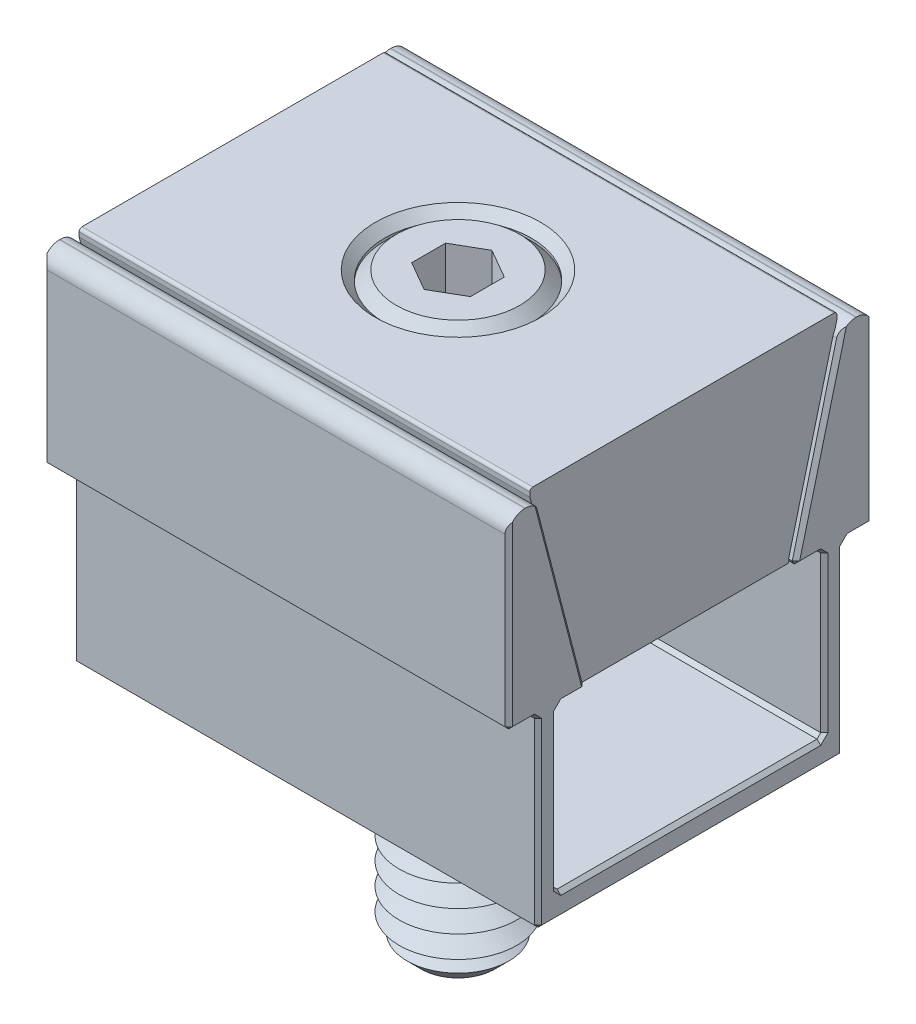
ISO-10303-21;
HEADER;
FILE_DESCRIPTION(('STEP AP214'),'2;1');
FILE_NAME('part.step','',(''),(''),'','','');
FILE_SCHEMA(('AUTOMOTIVE_DESIGN { 1 0 10303 214 1 1 1 1 }'));
ENDSEC;
DATA;
#1=APPLICATION_CONTEXT('core data for automotive mechanical design processes');
#2=APPLICATION_PROTOCOL_DEFINITION('international standard','automotive_design',2000,#1);
#3=PRODUCT_CONTEXT('',#1,'mechanical');
#4=PRODUCT('Part','Part','',(#3));
#5=PRODUCT_RELATED_PRODUCT_CATEGORY('part','',(#4));
#6=PRODUCT_DEFINITION_FORMATION('','',#4);
#7=PRODUCT_DEFINITION_CONTEXT('part definition',#1,'design');
#8=PRODUCT_DEFINITION('design','',#6,#7);
#9=PRODUCT_DEFINITION_SHAPE('','',#8);
#10=(LENGTH_UNIT() NAMED_UNIT(*) SI_UNIT(.MILLI.,.METRE.));
#11=(NAMED_UNIT(*) PLANE_ANGLE_UNIT() SI_UNIT($,.RADIAN.));
#12=(NAMED_UNIT(*) SI_UNIT($,.STERADIAN.) SOLID_ANGLE_UNIT());
#13=UNCERTAINTY_MEASURE_WITH_UNIT(LENGTH_MEASURE(1.E-05),#10,'distance_accuracy_value','');
#14=(GEOMETRIC_REPRESENTATION_CONTEXT(3) GLOBAL_UNCERTAINTY_ASSIGNED_CONTEXT((#13)) GLOBAL_UNIT_ASSIGNED_CONTEXT((#10,
#11,#12)) REPRESENTATION_CONTEXT('',''));
#15=CARTESIAN_POINT('',(0.,0.,0.));
#16=DIRECTION('',(0.,0.,1.));
#17=DIRECTION('',(1.,0.,0.));
#18=AXIS2_PLACEMENT_3D('',#15,#16,#17);
#19=CARTESIAN_POINT('',(0.,22.9,0.));
#20=DIRECTION('',(0.,1.,0.));
#21=DIRECTION('',(0.,0.,1.));
#22=AXIS2_PLACEMENT_3D('',#19,#20,#21);
#23=PLANE('',#22);
#24=CARTESIAN_POINT('',(0.,22.9,0.));
#25=DIRECTION('',(0.,1.,0.));
#26=DIRECTION('',(0.,0.,1.));
#27=AXIS2_PLACEMENT_3D('',#24,#25,#26);
#28=CIRCLE('',#27,2.);
#29=CARTESIAN_POINT('',(1.,22.9,1.73205080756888));
#30=VERTEX_POINT('',#29);
#31=CARTESIAN_POINT('',(2.,22.9,0.));
#32=VERTEX_POINT('',#31);
#33=EDGE_CURVE('P0_E94',#30,#32,#28,.T.);
#34=ORIENTED_EDGE('',*,*,#33,.F.);
#35=DIRECTION('',(0.866025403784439,0.,-0.5));
#36=VECTOR('',#35,1.);
#37=CARTESIAN_POINT('',(0.,22.9,2.3094010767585));
#38=LINE('',#37,#36);
#39=CARTESIAN_POINT('',(2.,22.9,1.15470053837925));
#40=VERTEX_POINT('',#39);
#41=EDGE_CURVE('P0_E117',#30,#40,#38,.T.);
#42=ORIENTED_EDGE('',*,*,#41,.T.);
#43=DIRECTION('',(0.,0.,-1.));
#44=VECTOR('',#43,1.);
#45=CARTESIAN_POINT('',(2.,22.9,1.15470053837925));
#46=LINE('',#45,#44);
#47=EDGE_CURVE('P0_E113',#40,#32,#46,.T.);
#48=ORIENTED_EDGE('',*,*,#47,.T.);
#49=EDGE_LOOP('',(#34,#42,#48));
#50=FACE_BOUND('',#49,.T.);
#51=ADVANCED_FACE('P0_F16',(#50),#23,.T.);
#52=CARTESIAN_POINT('',(0.,22.9,0.));
#53=DIRECTION('',(0.,1.,0.));
#54=DIRECTION('',(0.,0.,1.));
#55=AXIS2_PLACEMENT_3D('',#52,#53,#54);
#56=CIRCLE('',#55,2.);
#57=CARTESIAN_POINT('',(1.,22.9,-1.73205080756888));
#58=VERTEX_POINT('',#57);
#59=EDGE_CURVE('P0_E11',#32,#58,#56,.T.);
#60=ORIENTED_EDGE('',*,*,#59,.F.);
#61=CARTESIAN_POINT('',(2.,22.9,-1.15470053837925));
#62=VERTEX_POINT('',#61);
#63=EDGE_CURVE('P0_E105',#32,#62,#46,.T.);
#64=ORIENTED_EDGE('',*,*,#63,.T.);
#65=DIRECTION('',(-0.866025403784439,0.,-0.5));
#66=VECTOR('',#65,1.);
#67=CARTESIAN_POINT('',(2.,22.9,-1.15470053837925));
#68=LINE('',#67,#66);
#69=EDGE_CURVE('P0_E108',#62,#58,#68,.T.);
#70=ORIENTED_EDGE('',*,*,#69,.T.);
#71=EDGE_LOOP('',(#60,#64,#70));
#72=FACE_BOUND('',#71,.T.);
#73=ADVANCED_FACE('P0_F104',(#72),#23,.T.);
#74=CARTESIAN_POINT('',(-1.,22.9,-1.73205080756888));
#75=VERTEX_POINT('',#74);
#76=EDGE_CURVE('P0_E25',#58,#75,#56,.T.);
#77=ORIENTED_EDGE('',*,*,#76,.F.);
#78=CARTESIAN_POINT('',(0.,22.9,-2.3094010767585));
#79=VERTEX_POINT('',#78);
#80=EDGE_CURVE('P0_E140',#58,#79,#68,.T.);
#81=ORIENTED_EDGE('',*,*,#80,.T.);
#82=DIRECTION('',(-0.866025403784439,0.,0.5));
#83=VECTOR('',#82,1.);
#84=CARTESIAN_POINT('',(0.,22.9,-2.3094010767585));
#85=LINE('',#84,#83);
#86=EDGE_CURVE('P0_E312',#79,#75,#85,.T.);
#87=ORIENTED_EDGE('',*,*,#86,.T.);
#88=EDGE_LOOP('',(#77,#81,#87));
#89=FACE_BOUND('',#88,.T.);
#90=ADVANCED_FACE('P0_F314',(#89),#23,.T.);
#91=CARTESIAN_POINT('',(-2.,22.9,0.));
#92=VERTEX_POINT('',#91);
#93=EDGE_CURVE('P0_E296',#75,#92,#56,.T.);
#94=ORIENTED_EDGE('',*,*,#93,.F.);
#95=CARTESIAN_POINT('',(-2.,22.9,-1.15470053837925));
#96=VERTEX_POINT('',#95);
#97=EDGE_CURVE('P0_E305',#75,#96,#85,.T.);
#98=ORIENTED_EDGE('',*,*,#97,.T.);
#99=DIRECTION('',(0.,0.,1.));
#100=VECTOR('',#99,1.);
#101=CARTESIAN_POINT('',(-2.,22.9,-1.15470053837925));
#102=LINE('',#101,#100);
#103=EDGE_CURVE('P0_E308',#96,#92,#102,.T.);
#104=ORIENTED_EDGE('',*,*,#103,.T.);
#105=EDGE_LOOP('',(#94,#98,#104));
#106=FACE_BOUND('',#105,.T.);
#107=ADVANCED_FACE('P0_F304',(#106),#23,.T.);
#108=CARTESIAN_POINT('',(-1.,22.9,1.73205080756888));
#109=VERTEX_POINT('',#108);
#110=EDGE_CURVE('P0_E32',#92,#109,#56,.T.);
#111=ORIENTED_EDGE('',*,*,#110,.F.);
#112=CARTESIAN_POINT('',(-2.,22.9,1.15470053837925));
#113=VERTEX_POINT('',#112);
#114=EDGE_CURVE('P0_E315',#92,#113,#102,.T.);
#115=ORIENTED_EDGE('',*,*,#114,.T.);
#116=DIRECTION('',(0.866025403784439,0.,0.5));
#117=VECTOR('',#116,1.);
#118=CARTESIAN_POINT('',(-2.,22.9,1.15470053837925));
#119=LINE('',#118,#117);
#120=EDGE_CURVE('P0_E319',#113,#109,#119,.T.);
#121=ORIENTED_EDGE('',*,*,#120,.T.);
#122=EDGE_LOOP('',(#111,#115,#121));
#123=FACE_BOUND('',#122,.T.);
#124=ADVANCED_FACE('P0_F359',(#123),#23,.T.);
#125=CARTESIAN_POINT('',(0.,25.9,0.));
#126=DIRECTION('',(0.,1.,0.));
#127=DIRECTION('',(0.,0.,1.));
#128=AXIS2_PLACEMENT_3D('',#125,#126,#127);
#129=PLANE('',#128);
#130=DIRECTION('',(-0.866025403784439,0.,-0.5));
#131=VECTOR('',#130,1.);
#132=CARTESIAN_POINT('',(2.,25.9,-1.15470053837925));
#133=LINE('',#132,#131);
#134=CARTESIAN_POINT('',(2.,25.9,-1.15470053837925));
#135=VERTEX_POINT('',#134);
#136=CARTESIAN_POINT('',(0.,25.9,-2.3094010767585));
#137=VERTEX_POINT('',#136);
#138=EDGE_CURVE('P0_E40',#135,#137,#133,.T.);
#139=ORIENTED_EDGE('',*,*,#138,.F.);
#140=DIRECTION('',(0.,0.,-1.));
#141=VECTOR('',#140,1.);
#142=CARTESIAN_POINT('',(2.,25.9,1.15470053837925));
#143=LINE('',#142,#141);
#144=CARTESIAN_POINT('',(2.,25.9,1.15470053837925));
#145=VERTEX_POINT('',#144);
#146=EDGE_CURVE('P0_E138',#145,#135,#143,.T.);
#147=ORIENTED_EDGE('',*,*,#146,.F.);
#148=DIRECTION('',(0.866025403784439,0.,-0.5));
#149=VECTOR('',#148,1.);
#150=CARTESIAN_POINT('',(0.,25.9,2.3094010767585));
#151=LINE('',#150,#149);
#152=CARTESIAN_POINT('',(0.,25.9,2.3094010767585));
#153=VERTEX_POINT('',#152);
#154=EDGE_CURVE('P0_E135',#153,#145,#151,.T.);
#155=ORIENTED_EDGE('',*,*,#154,.F.);
#156=DIRECTION('',(0.866025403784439,0.,0.5));
#157=VECTOR('',#156,1.);
#158=CARTESIAN_POINT('',(-2.,25.9,1.15470053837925));
#159=LINE('',#158,#157);
#160=CARTESIAN_POINT('',(-2.,25.9,1.15470053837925));
#161=VERTEX_POINT('',#160);
#162=EDGE_CURVE('P0_E132',#161,#153,#159,.T.);
#163=ORIENTED_EDGE('',*,*,#162,.F.);
#164=DIRECTION('',(0.,0.,1.));
#165=VECTOR('',#164,1.);
#166=CARTESIAN_POINT('',(-2.,25.9,-1.15470053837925));
#167=LINE('',#166,#165);
#168=CARTESIAN_POINT('',(-2.,25.9,-1.15470053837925));
#169=VERTEX_POINT('',#168);
#170=EDGE_CURVE('P0_E129',#169,#161,#167,.T.);
#171=ORIENTED_EDGE('',*,*,#170,.F.);
#172=DIRECTION('',(-0.866025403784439,0.,0.5));
#173=VECTOR('',#172,1.);
#174=CARTESIAN_POINT('',(0.,25.9,-2.3094010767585));
#175=LINE('',#174,#173);
#176=EDGE_CURVE('P0_E126',#137,#169,#175,.T.);
#177=ORIENTED_EDGE('',*,*,#176,.F.);
#178=EDGE_LOOP('',(#139,#147,#155,#163,#171,#177));
#179=FACE_BOUND('',#178,.T.);
#180=CARTESIAN_POINT('',(0.,25.9,0.));
#181=DIRECTION('',(0.,1.,0.));
#182=DIRECTION('',(0.,0.,1.));
#183=AXIS2_PLACEMENT_3D('',#180,#181,#182);
#184=CIRCLE('',#183,4.2);
#185=CARTESIAN_POINT('',(0.,25.9,4.2));
#186=VERTEX_POINT('',#185);
#187=EDGE_CURVE('P0_E288',#186,#186,#184,.T.);
#188=ORIENTED_EDGE('',*,*,#187,.T.);
#189=EDGE_LOOP('',(#188));
#190=FACE_BOUND('',#189,.T.);
#191=ADVANCED_FACE('P0_F337',(#179,#190),#129,.T.);
#192=CARTESIAN_POINT('',(0.,86.1476336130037,0.));
#193=DIRECTION('',(0.,1.,0.));
#194=DIRECTION('',(0.,0.,1.));
#195=AXIS2_PLACEMENT_3D('',#192,#193,#194);
#196=CYLINDRICAL_SURFACE('',#195,5.);
#197=CARTESIAN_POINT('',(0.,25.1,0.));
#198=DIRECTION('',(0.,1.,0.));
#199=DIRECTION('',(0.,0.,1.));
#200=AXIS2_PLACEMENT_3D('',#197,#198,#199);
#201=CIRCLE('',#200,5.);
#202=CARTESIAN_POINT('',(0.,25.1,5.));
#203=VERTEX_POINT('',#202);
#204=EDGE_CURVE('P0_E292',#203,#203,#201,.F.);
#205=ORIENTED_EDGE('',*,*,#204,.T.);
#206=EDGE_LOOP('',(#205));
#207=FACE_BOUND('',#206,.T.);
#208=CARTESIAN_POINT('',(0.,19.55,0.));
#209=DIRECTION('',(0.,1.,0.));
#210=DIRECTION('',(0.,0.,1.));
#211=AXIS2_PLACEMENT_3D('',#208,#209,#210);
#212=CIRCLE('',#211,5.);
#213=CARTESIAN_POINT('',(0.,19.55,5.));
#214=VERTEX_POINT('',#213);
#215=EDGE_CURVE('P0_E282',#214,#214,#212,.T.);
#216=ORIENTED_EDGE('',*,*,#215,.T.);
#217=EDGE_LOOP('',(#216));
#218=FACE_BOUND('',#217,.T.);
#219=ADVANCED_FACE('P0_F369',(#207,#218),#196,.T.);
#220=CARTESIAN_POINT('',(0.,19.55,5.));
#221=DIRECTION('',(0.,-1.,0.));
#222=DIRECTION('',(0.,0.,-1.));
#223=AXIS2_PLACEMENT_3D('',#220,#221,#222);
#224=PLANE('',#223);
#225=CARTESIAN_POINT('',(0.,19.55,0.));
#226=DIRECTION('',(0.,1.,0.));
#227=DIRECTION('',(0.,0.,1.));
#228=AXIS2_PLACEMENT_3D('',#225,#226,#227);
#229=CIRCLE('',#228,4.);
#230=CARTESIAN_POINT('',(0.,19.55,4.));
#231=VERTEX_POINT('',#230);
#232=EDGE_CURVE('P0_E279',#231,#231,#229,.T.);
#233=ORIENTED_EDGE('',*,*,#232,.T.);
#234=EDGE_LOOP('',(#233));
#235=FACE_BOUND('',#234,.T.);
#236=ORIENTED_EDGE('',*,*,#215,.F.);
#237=EDGE_LOOP('',(#236));
#238=FACE_BOUND('',#237,.T.);
#239=ADVANCED_FACE('P0_F845',(#235,#238),#224,.T.);
#240=CARTESIAN_POINT('',(0.,18.8,0.));
#241=DIRECTION('',(0.,1.,0.));
#242=DIRECTION('',(0.,0.,1.));
#243=AXIS2_PLACEMENT_3D('',#240,#241,#242);
#244=CONICAL_SURFACE('',#243,2.70096189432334,1.0471975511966);
#245=ORIENTED_EDGE('',*,*,#232,.F.);
#246=EDGE_LOOP('',(#245));
#247=FACE_BOUND('',#246,.T.);
#248=CARTESIAN_POINT('',(0.,18.8,0.));
#249=DIRECTION('',(0.,1.,0.));
#250=DIRECTION('',(0.,0.,1.));
#251=AXIS2_PLACEMENT_3D('',#248,#249,#250);
#252=CIRCLE('',#251,2.70096189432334);
#253=CARTESIAN_POINT('',(0.,18.8,2.70096189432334));
#254=VERTEX_POINT('',#253);
#255=EDGE_CURVE('P0_E276',#254,#254,#252,.T.);
#256=ORIENTED_EDGE('',*,*,#255,.T.);
#257=EDGE_LOOP('',(#256));
#258=FACE_BOUND('',#257,.T.);
#259=ADVANCED_FACE('P0_F836',(#247,#258),#244,.T.);
#260=CARTESIAN_POINT('',(0.,18.05,0.));
#261=DIRECTION('',(0.,-1.,0.));
#262=DIRECTION('',(0.,0.,-1.));
#263=AXIS2_PLACEMENT_3D('',#260,#261,#262);
#264=CONICAL_SURFACE('',#263,4.,1.0471975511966);
#265=ORIENTED_EDGE('',*,*,#255,.F.);
#266=EDGE_LOOP('',(#265));
#267=FACE_BOUND('',#266,.T.);
#268=CARTESIAN_POINT('',(0.,18.05,0.));
#269=DIRECTION('',(0.,1.,0.));
#270=DIRECTION('',(0.,0.,1.));
#271=AXIS2_PLACEMENT_3D('',#268,#269,#270);
#272=CIRCLE('',#271,4.);
#273=CARTESIAN_POINT('',(0.,18.05,4.));
#274=VERTEX_POINT('',#273);
#275=EDGE_CURVE('P0_E273',#274,#274,#272,.T.);
#276=ORIENTED_EDGE('',*,*,#275,.T.);
#277=EDGE_LOOP('',(#276));
#278=FACE_BOUND('',#277,.T.);
#279=ADVANCED_FACE('P0_F827',(#267,#278),#264,.T.);
#280=CARTESIAN_POINT('',(0.,17.3,0.));
#281=DIRECTION('',(0.,1.,0.));
#282=DIRECTION('',(0.,0.,1.));
#283=AXIS2_PLACEMENT_3D('',#280,#281,#282);
#284=CONICAL_SURFACE('',#283,2.70096189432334,1.0471975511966);
#285=ORIENTED_EDGE('',*,*,#275,.F.);
#286=EDGE_LOOP('',(#285));
#287=FACE_BOUND('',#286,.T.);
#288=CARTESIAN_POINT('',(0.,17.3,0.));
#289=DIRECTION('',(0.,1.,0.));
#290=DIRECTION('',(0.,0.,1.));
#291=AXIS2_PLACEMENT_3D('',#288,#289,#290);
#292=CIRCLE('',#291,2.70096189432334);
#293=CARTESIAN_POINT('',(0.,17.3,2.70096189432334));
#294=VERTEX_POINT('',#293);
#295=EDGE_CURVE('P0_E270',#294,#294,#292,.T.);
#296=ORIENTED_EDGE('',*,*,#295,.T.);
#297=EDGE_LOOP('',(#296));
#298=FACE_BOUND('',#297,.T.);
#299=ADVANCED_FACE('P0_F818',(#287,#298),#284,.T.);
#300=CARTESIAN_POINT('',(0.,16.55,0.));
#301=DIRECTION('',(0.,-1.,0.));
#302=DIRECTION('',(0.,0.,-1.));
#303=AXIS2_PLACEMENT_3D('',#300,#301,#302);
#304=CONICAL_SURFACE('',#303,4.,1.0471975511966);
#305=ORIENTED_EDGE('',*,*,#295,.F.);
#306=EDGE_LOOP('',(#305));
#307=FACE_BOUND('',#306,.T.);
#308=CARTESIAN_POINT('',(0.,16.55,0.));
#309=DIRECTION('',(0.,1.,0.));
#310=DIRECTION('',(0.,0.,1.));
#311=AXIS2_PLACEMENT_3D('',#308,#309,#310);
#312=CIRCLE('',#311,4.);
#313=CARTESIAN_POINT('',(0.,16.55,4.));
#314=VERTEX_POINT('',#313);
#315=EDGE_CURVE('P0_E267',#314,#314,#312,.T.);
#316=ORIENTED_EDGE('',*,*,#315,.T.);
#317=EDGE_LOOP('',(#316));
#318=FACE_BOUND('',#317,.T.);
#319=ADVANCED_FACE('P0_F809',(#307,#318),#304,.T.);
#320=CARTESIAN_POINT('',(0.,15.8,0.));
#321=DIRECTION('',(0.,1.,0.));
#322=DIRECTION('',(0.,0.,1.));
#323=AXIS2_PLACEMENT_3D('',#320,#321,#322);
#324=CONICAL_SURFACE('',#323,2.70096189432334,1.0471975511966);
#325=ORIENTED_EDGE('',*,*,#315,.F.);
#326=EDGE_LOOP('',(#325));
#327=FACE_BOUND('',#326,.T.);
#328=CARTESIAN_POINT('',(0.,15.8,0.));
#329=DIRECTION('',(0.,1.,0.));
#330=DIRECTION('',(0.,0.,1.));
#331=AXIS2_PLACEMENT_3D('',#328,#329,#330);
#332=CIRCLE('',#331,2.70096189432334);
#333=CARTESIAN_POINT('',(0.,15.8,2.70096189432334));
#334=VERTEX_POINT('',#333);
#335=EDGE_CURVE('P0_E264',#334,#334,#332,.T.);
#336=ORIENTED_EDGE('',*,*,#335,.T.);
#337=EDGE_LOOP('',(#336));
#338=FACE_BOUND('',#337,.T.);
#339=ADVANCED_FACE('P0_F800',(#327,#338),#324,.T.);
#340=CARTESIAN_POINT('',(0.,15.05,0.));
#341=DIRECTION('',(0.,-1.,0.));
#342=DIRECTION('',(0.,0.,-1.));
#343=AXIS2_PLACEMENT_3D('',#340,#341,#342);
#344=CONICAL_SURFACE('',#343,4.,1.0471975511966);
#345=ORIENTED_EDGE('',*,*,#335,.F.);
#346=EDGE_LOOP('',(#345));
#347=FACE_BOUND('',#346,.T.);
#348=CARTESIAN_POINT('',(0.,15.05,0.));
#349=DIRECTION('',(0.,1.,0.));
#350=DIRECTION('',(0.,0.,1.));
#351=AXIS2_PLACEMENT_3D('',#348,#349,#350);
#352=CIRCLE('',#351,4.);
#353=CARTESIAN_POINT('',(0.,15.05,4.));
#354=VERTEX_POINT('',#353);
#355=EDGE_CURVE('P0_E261',#354,#354,#352,.T.);
#356=ORIENTED_EDGE('',*,*,#355,.T.);
#357=EDGE_LOOP('',(#356));
#358=FACE_BOUND('',#357,.T.);
#359=ADVANCED_FACE('P0_F791',(#347,#358),#344,.T.);
#360=CARTESIAN_POINT('',(0.,14.3,0.));
#361=DIRECTION('',(0.,1.,0.));
#362=DIRECTION('',(0.,0.,1.));
#363=AXIS2_PLACEMENT_3D('',#360,#361,#362);
#364=CONICAL_SURFACE('',#363,2.70096189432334,1.0471975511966);
#365=ORIENTED_EDGE('',*,*,#355,.F.);
#366=EDGE_LOOP('',(#365));
#367=FACE_BOUND('',#366,.T.);
#368=CARTESIAN_POINT('',(0.,14.3,0.));
#369=DIRECTION('',(0.,1.,0.));
#370=DIRECTION('',(0.,0.,1.));
#371=AXIS2_PLACEMENT_3D('',#368,#369,#370);
#372=CIRCLE('',#371,2.70096189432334);
#373=CARTESIAN_POINT('',(0.,14.3,2.70096189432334));
#374=VERTEX_POINT('',#373);
#375=EDGE_CURVE('P0_E258',#374,#374,#372,.T.);
#376=ORIENTED_EDGE('',*,*,#375,.T.);
#377=EDGE_LOOP('',(#376));
#378=FACE_BOUND('',#377,.T.);
#379=ADVANCED_FACE('P0_F782',(#367,#378),#364,.T.);
#380=CARTESIAN_POINT('',(0.,13.55,0.));
#381=DIRECTION('',(0.,-1.,0.));
#382=DIRECTION('',(0.,0.,-1.));
#383=AXIS2_PLACEMENT_3D('',#380,#381,#382);
#384=CONICAL_SURFACE('',#383,4.,1.0471975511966);
#385=ORIENTED_EDGE('',*,*,#375,.F.);
#386=EDGE_LOOP('',(#385));
#387=FACE_BOUND('',#386,.T.);
#388=CARTESIAN_POINT('',(0.,13.55,0.));
#389=DIRECTION('',(0.,1.,0.));
#390=DIRECTION('',(0.,0.,1.));
#391=AXIS2_PLACEMENT_3D('',#388,#389,#390);
#392=CIRCLE('',#391,4.);
#393=CARTESIAN_POINT('',(0.,13.55,4.));
#394=VERTEX_POINT('',#393);
#395=EDGE_CURVE('P0_E255',#394,#394,#392,.T.);
#396=ORIENTED_EDGE('',*,*,#395,.T.);
#397=EDGE_LOOP('',(#396));
#398=FACE_BOUND('',#397,.T.);
#399=ADVANCED_FACE('P0_F773',(#387,#398),#384,.T.);
#400=CARTESIAN_POINT('',(0.,12.8,0.));
#401=DIRECTION('',(0.,1.,0.));
#402=DIRECTION('',(0.,0.,1.));
#403=AXIS2_PLACEMENT_3D('',#400,#401,#402);
#404=CONICAL_SURFACE('',#403,2.70096189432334,1.0471975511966);
#405=ORIENTED_EDGE('',*,*,#395,.F.);
#406=EDGE_LOOP('',(#405));
#407=FACE_BOUND('',#406,.T.);
#408=CARTESIAN_POINT('',(0.,12.8,0.));
#409=DIRECTION('',(0.,1.,0.));
#410=DIRECTION('',(0.,0.,1.));
#411=AXIS2_PLACEMENT_3D('',#408,#409,#410);
#412=CIRCLE('',#411,2.70096189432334);
#413=CARTESIAN_POINT('',(0.,12.8,2.70096189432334));
#414=VERTEX_POINT('',#413);
#415=EDGE_CURVE('P0_E252',#414,#414,#412,.T.);
#416=ORIENTED_EDGE('',*,*,#415,.T.);
#417=EDGE_LOOP('',(#416));
#418=FACE_BOUND('',#417,.T.);
#419=ADVANCED_FACE('P0_F764',(#407,#418),#404,.T.);
#420=CARTESIAN_POINT('',(0.,12.05,0.));
#421=DIRECTION('',(0.,-1.,0.));
#422=DIRECTION('',(0.,0.,-1.));
#423=AXIS2_PLACEMENT_3D('',#420,#421,#422);
#424=CONICAL_SURFACE('',#423,4.,1.0471975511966);
#425=ORIENTED_EDGE('',*,*,#415,.F.);
#426=EDGE_LOOP('',(#425));
#427=FACE_BOUND('',#426,.T.);
#428=CARTESIAN_POINT('',(0.,12.05,0.));
#429=DIRECTION('',(0.,1.,0.));
#430=DIRECTION('',(0.,0.,1.));
#431=AXIS2_PLACEMENT_3D('',#428,#429,#430);
#432=CIRCLE('',#431,4.);
#433=CARTESIAN_POINT('',(0.,12.05,4.));
#434=VERTEX_POINT('',#433);
#435=EDGE_CURVE('P0_E249',#434,#434,#432,.T.);
#436=ORIENTED_EDGE('',*,*,#435,.T.);
#437=EDGE_LOOP('',(#436));
#438=FACE_BOUND('',#437,.T.);
#439=ADVANCED_FACE('P0_F755',(#427,#438),#424,.T.);
#440=CARTESIAN_POINT('',(0.,11.3,0.));
#441=DIRECTION('',(0.,1.,0.));
#442=DIRECTION('',(0.,0.,1.));
#443=AXIS2_PLACEMENT_3D('',#440,#441,#442);
#444=CONICAL_SURFACE('',#443,2.70096189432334,1.0471975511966);
#445=ORIENTED_EDGE('',*,*,#435,.F.);
#446=EDGE_LOOP('',(#445));
#447=FACE_BOUND('',#446,.T.);
#448=CARTESIAN_POINT('',(0.,11.3,0.));
#449=DIRECTION('',(0.,1.,0.));
#450=DIRECTION('',(0.,0.,1.));
#451=AXIS2_PLACEMENT_3D('',#448,#449,#450);
#452=CIRCLE('',#451,2.70096189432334);
#453=CARTESIAN_POINT('',(0.,11.3,2.70096189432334));
#454=VERTEX_POINT('',#453);
#455=EDGE_CURVE('P0_E246',#454,#454,#452,.T.);
#456=ORIENTED_EDGE('',*,*,#455,.T.);
#457=EDGE_LOOP('',(#456));
#458=FACE_BOUND('',#457,.T.);
#459=ADVANCED_FACE('P0_F746',(#447,#458),#444,.T.);
#460=CARTESIAN_POINT('',(0.,10.55,0.));
#461=DIRECTION('',(0.,-1.,0.));
#462=DIRECTION('',(0.,0.,-1.));
#463=AXIS2_PLACEMENT_3D('',#460,#461,#462);
#464=CONICAL_SURFACE('',#463,4.,1.0471975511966);
#465=ORIENTED_EDGE('',*,*,#455,.F.);
#466=EDGE_LOOP('',(#465));
#467=FACE_BOUND('',#466,.T.);
#468=CARTESIAN_POINT('',(0.,10.55,0.));
#469=DIRECTION('',(0.,1.,0.));
#470=DIRECTION('',(0.,0.,1.));
#471=AXIS2_PLACEMENT_3D('',#468,#469,#470);
#472=CIRCLE('',#471,4.);
#473=CARTESIAN_POINT('',(0.,10.55,4.));
#474=VERTEX_POINT('',#473);
#475=EDGE_CURVE('P0_E243',#474,#474,#472,.T.);
#476=ORIENTED_EDGE('',*,*,#475,.T.);
#477=EDGE_LOOP('',(#476));
#478=FACE_BOUND('',#477,.T.);
#479=ADVANCED_FACE('P0_F737',(#467,#478),#464,.T.);
#480=CARTESIAN_POINT('',(0.,9.80000000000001,0.));
#481=DIRECTION('',(0.,1.,0.));
#482=DIRECTION('',(0.,0.,1.));
#483=AXIS2_PLACEMENT_3D('',#480,#481,#482);
#484=CONICAL_SURFACE('',#483,2.70096189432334,1.0471975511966);
#485=ORIENTED_EDGE('',*,*,#475,.F.);
#486=EDGE_LOOP('',(#485));
#487=FACE_BOUND('',#486,.T.);
#488=CARTESIAN_POINT('',(0.,9.80000000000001,0.));
#489=DIRECTION('',(0.,1.,0.));
#490=DIRECTION('',(0.,0.,1.));
#491=AXIS2_PLACEMENT_3D('',#488,#489,#490);
#492=CIRCLE('',#491,2.70096189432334);
#493=CARTESIAN_POINT('',(0.,9.80000000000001,2.70096189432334));
#494=VERTEX_POINT('',#493);
#495=EDGE_CURVE('P0_E240',#494,#494,#492,.T.);
#496=ORIENTED_EDGE('',*,*,#495,.T.);
#497=EDGE_LOOP('',(#496));
#498=FACE_BOUND('',#497,.T.);
#499=ADVANCED_FACE('P0_F728',(#487,#498),#484,.T.);
#500=CARTESIAN_POINT('',(0.,9.05000000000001,0.));
#501=DIRECTION('',(0.,-1.,0.));
#502=DIRECTION('',(0.,0.,-1.));
#503=AXIS2_PLACEMENT_3D('',#500,#501,#502);
#504=CONICAL_SURFACE('',#503,4.,1.0471975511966);
#505=ORIENTED_EDGE('',*,*,#495,.F.);
#506=EDGE_LOOP('',(#505));
#507=FACE_BOUND('',#506,.T.);
#508=CARTESIAN_POINT('',(0.,9.05000000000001,0.));
#509=DIRECTION('',(0.,1.,0.));
#510=DIRECTION('',(0.,0.,1.));
#511=AXIS2_PLACEMENT_3D('',#508,#509,#510);
#512=CIRCLE('',#511,4.);
#513=CARTESIAN_POINT('',(0.,9.05000000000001,4.));
#514=VERTEX_POINT('',#513);
#515=EDGE_CURVE('P0_E237',#514,#514,#512,.T.);
#516=ORIENTED_EDGE('',*,*,#515,.T.);
#517=EDGE_LOOP('',(#516));
#518=FACE_BOUND('',#517,.T.);
#519=ADVANCED_FACE('P0_F719',(#507,#518),#504,.T.);
#520=CARTESIAN_POINT('',(0.,8.30000000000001,0.));
#521=DIRECTION('',(0.,1.,0.));
#522=DIRECTION('',(0.,0.,1.));
#523=AXIS2_PLACEMENT_3D('',#520,#521,#522);
#524=CONICAL_SURFACE('',#523,2.70096189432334,1.0471975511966);
#525=ORIENTED_EDGE('',*,*,#515,.F.);
#526=EDGE_LOOP('',(#525));
#527=FACE_BOUND('',#526,.T.);
#528=CARTESIAN_POINT('',(0.,8.30000000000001,0.));
#529=DIRECTION('',(0.,1.,0.));
#530=DIRECTION('',(0.,0.,1.));
#531=AXIS2_PLACEMENT_3D('',#528,#529,#530);
#532=CIRCLE('',#531,2.70096189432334);
#533=CARTESIAN_POINT('',(0.,8.30000000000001,2.70096189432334));
#534=VERTEX_POINT('',#533);
#535=EDGE_CURVE('P0_E234',#534,#534,#532,.T.);
#536=ORIENTED_EDGE('',*,*,#535,.T.);
#537=EDGE_LOOP('',(#536));
#538=FACE_BOUND('',#537,.T.);
#539=ADVANCED_FACE('P0_F710',(#527,#538),#524,.T.);
#540=CARTESIAN_POINT('',(0.,7.55000000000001,0.));
#541=DIRECTION('',(0.,-1.,0.));
#542=DIRECTION('',(0.,0.,-1.));
#543=AXIS2_PLACEMENT_3D('',#540,#541,#542);
#544=CONICAL_SURFACE('',#543,4.,1.0471975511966);
#545=ORIENTED_EDGE('',*,*,#535,.F.);
#546=EDGE_LOOP('',(#545));
#547=FACE_BOUND('',#546,.T.);
#548=CARTESIAN_POINT('',(0.,7.55000000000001,0.));
#549=DIRECTION('',(0.,1.,0.));
#550=DIRECTION('',(0.,0.,1.));
#551=AXIS2_PLACEMENT_3D('',#548,#549,#550);
#552=CIRCLE('',#551,4.);
#553=CARTESIAN_POINT('',(0.,7.55000000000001,4.));
#554=VERTEX_POINT('',#553);
#555=EDGE_CURVE('P0_E231',#554,#554,#552,.T.);
#556=ORIENTED_EDGE('',*,*,#555,.T.);
#557=EDGE_LOOP('',(#556));
#558=FACE_BOUND('',#557,.T.);
#559=ADVANCED_FACE('P0_F701',(#547,#558),#544,.T.);
#560=CARTESIAN_POINT('',(0.,6.80000000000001,0.));
#561=DIRECTION('',(0.,1.,0.));
#562=DIRECTION('',(0.,0.,1.));
#563=AXIS2_PLACEMENT_3D('',#560,#561,#562);
#564=CONICAL_SURFACE('',#563,2.70096189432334,1.0471975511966);
#565=ORIENTED_EDGE('',*,*,#555,.F.);
#566=EDGE_LOOP('',(#565));
#567=FACE_BOUND('',#566,.T.);
#568=CARTESIAN_POINT('',(0.,6.80000000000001,0.));
#569=DIRECTION('',(0.,1.,0.));
#570=DIRECTION('',(0.,0.,1.));
#571=AXIS2_PLACEMENT_3D('',#568,#569,#570);
#572=CIRCLE('',#571,2.70096189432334);
#573=CARTESIAN_POINT('',(0.,6.80000000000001,2.70096189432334));
#574=VERTEX_POINT('',#573);
#575=EDGE_CURVE('P0_E228',#574,#574,#572,.T.);
#576=ORIENTED_EDGE('',*,*,#575,.T.);
#577=EDGE_LOOP('',(#576));
#578=FACE_BOUND('',#577,.T.);
#579=ADVANCED_FACE('P0_F692',(#567,#578),#564,.T.);
#580=CARTESIAN_POINT('',(0.,6.05000000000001,0.));
#581=DIRECTION('',(0.,-1.,0.));
#582=DIRECTION('',(0.,0.,-1.));
#583=AXIS2_PLACEMENT_3D('',#580,#581,#582);
#584=CONICAL_SURFACE('',#583,4.,1.0471975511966);
#585=ORIENTED_EDGE('',*,*,#575,.F.);
#586=EDGE_LOOP('',(#585));
#587=FACE_BOUND('',#586,.T.);
#588=CARTESIAN_POINT('',(0.,6.05000000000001,0.));
#589=DIRECTION('',(0.,1.,0.));
#590=DIRECTION('',(0.,0.,1.));
#591=AXIS2_PLACEMENT_3D('',#588,#589,#590);
#592=CIRCLE('',#591,4.);
#593=CARTESIAN_POINT('',(0.,6.05000000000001,4.));
#594=VERTEX_POINT('',#593);
#595=EDGE_CURVE('P0_E225',#594,#594,#592,.T.);
#596=ORIENTED_EDGE('',*,*,#595,.T.);
#597=EDGE_LOOP('',(#596));
#598=FACE_BOUND('',#597,.T.);
#599=ADVANCED_FACE('P0_F683',(#587,#598),#584,.T.);
#600=CARTESIAN_POINT('',(0.,5.30000000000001,0.));
#601=DIRECTION('',(0.,1.,0.));
#602=DIRECTION('',(0.,0.,1.));
#603=AXIS2_PLACEMENT_3D('',#600,#601,#602);
#604=CONICAL_SURFACE('',#603,2.70096189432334,1.0471975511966);
#605=ORIENTED_EDGE('',*,*,#595,.F.);
#606=EDGE_LOOP('',(#605));
#607=FACE_BOUND('',#606,.T.);
#608=CARTESIAN_POINT('',(0.,5.30000000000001,0.));
#609=DIRECTION('',(0.,1.,0.));
#610=DIRECTION('',(0.,0.,1.));
#611=AXIS2_PLACEMENT_3D('',#608,#609,#610);
#612=CIRCLE('',#611,2.70096189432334);
#613=CARTESIAN_POINT('',(0.,5.30000000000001,2.70096189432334));
#614=VERTEX_POINT('',#613);
#615=EDGE_CURVE('P0_E222',#614,#614,#612,.T.);
#616=ORIENTED_EDGE('',*,*,#615,.T.);
#617=EDGE_LOOP('',(#616));
#618=FACE_BOUND('',#617,.T.);
#619=ADVANCED_FACE('P0_F674',(#607,#618),#604,.T.);
#620=CARTESIAN_POINT('',(0.,4.55000000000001,0.));
#621=DIRECTION('',(0.,-1.,0.));
#622=DIRECTION('',(0.,0.,-1.));
#623=AXIS2_PLACEMENT_3D('',#620,#621,#622);
#624=CONICAL_SURFACE('',#623,4.,1.0471975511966);
#625=ORIENTED_EDGE('',*,*,#615,.F.);
#626=EDGE_LOOP('',(#625));
#627=FACE_BOUND('',#626,.T.);
#628=CARTESIAN_POINT('',(0.,4.55000000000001,0.));
#629=DIRECTION('',(0.,1.,0.));
#630=DIRECTION('',(0.,0.,1.));
#631=AXIS2_PLACEMENT_3D('',#628,#629,#630);
#632=CIRCLE('',#631,4.);
#633=CARTESIAN_POINT('',(0.,4.55000000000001,4.));
#634=VERTEX_POINT('',#633);
#635=EDGE_CURVE('P0_E219',#634,#634,#632,.T.);
#636=ORIENTED_EDGE('',*,*,#635,.T.);
#637=EDGE_LOOP('',(#636));
#638=FACE_BOUND('',#637,.T.);
#639=ADVANCED_FACE('P0_F665',(#627,#638),#624,.T.);
#640=CARTESIAN_POINT('',(0.,3.80000000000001,0.));
#641=DIRECTION('',(0.,1.,0.));
#642=DIRECTION('',(0.,0.,1.));
#643=AXIS2_PLACEMENT_3D('',#640,#641,#642);
#644=CONICAL_SURFACE('',#643,2.70096189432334,1.0471975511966);
#645=ORIENTED_EDGE('',*,*,#635,.F.);
#646=EDGE_LOOP('',(#645));
#647=FACE_BOUND('',#646,.T.);
#648=CARTESIAN_POINT('',(0.,3.80000000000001,0.));
#649=DIRECTION('',(0.,1.,0.));
#650=DIRECTION('',(0.,0.,1.));
#651=AXIS2_PLACEMENT_3D('',#648,#649,#650);
#652=CIRCLE('',#651,2.70096189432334);
#653=CARTESIAN_POINT('',(0.,3.80000000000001,2.70096189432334));
#654=VERTEX_POINT('',#653);
#655=EDGE_CURVE('P0_E216',#654,#654,#652,.T.);
#656=ORIENTED_EDGE('',*,*,#655,.T.);
#657=EDGE_LOOP('',(#656));
#658=FACE_BOUND('',#657,.T.);
#659=ADVANCED_FACE('P0_F656',(#647,#658),#644,.T.);
#660=CARTESIAN_POINT('',(0.,3.05000000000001,0.));
#661=DIRECTION('',(0.,-1.,0.));
#662=DIRECTION('',(0.,0.,-1.));
#663=AXIS2_PLACEMENT_3D('',#660,#661,#662);
#664=CONICAL_SURFACE('',#663,4.,1.0471975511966);
#665=ORIENTED_EDGE('',*,*,#655,.F.);
#666=EDGE_LOOP('',(#665));
#667=FACE_BOUND('',#666,.T.);
#668=CARTESIAN_POINT('',(0.,3.05000000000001,0.));
#669=DIRECTION('',(0.,1.,0.));
#670=DIRECTION('',(0.,0.,1.));
#671=AXIS2_PLACEMENT_3D('',#668,#669,#670);
#672=CIRCLE('',#671,4.);
#673=CARTESIAN_POINT('',(0.,3.05000000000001,4.));
#674=VERTEX_POINT('',#673);
#675=EDGE_CURVE('P0_E213',#674,#674,#672,.T.);
#676=ORIENTED_EDGE('',*,*,#675,.T.);
#677=EDGE_LOOP('',(#676));
#678=FACE_BOUND('',#677,.T.);
#679=ADVANCED_FACE('P0_F647',(#667,#678),#664,.T.);
#680=CARTESIAN_POINT('',(0.,2.30000000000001,0.));
#681=DIRECTION('',(0.,1.,0.));
#682=DIRECTION('',(0.,0.,1.));
#683=AXIS2_PLACEMENT_3D('',#680,#681,#682);
#684=CONICAL_SURFACE('',#683,2.70096189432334,1.0471975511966);
#685=ORIENTED_EDGE('',*,*,#675,.F.);
#686=EDGE_LOOP('',(#685));
#687=FACE_BOUND('',#686,.T.);
#688=CARTESIAN_POINT('',(0.,2.30000000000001,0.));
#689=DIRECTION('',(0.,1.,0.));
#690=DIRECTION('',(0.,0.,1.));
#691=AXIS2_PLACEMENT_3D('',#688,#689,#690);
#692=CIRCLE('',#691,2.70096189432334);
#693=CARTESIAN_POINT('',(0.,2.30000000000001,2.70096189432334));
#694=VERTEX_POINT('',#693);
#695=EDGE_CURVE('P0_E210',#694,#694,#692,.T.);
#696=ORIENTED_EDGE('',*,*,#695,.T.);
#697=EDGE_LOOP('',(#696));
#698=FACE_BOUND('',#697,.T.);
#699=ADVANCED_FACE('P0_F638',(#687,#698),#684,.T.);
#700=CARTESIAN_POINT('',(0.,1.55000000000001,0.));
#701=DIRECTION('',(0.,-1.,0.));
#702=DIRECTION('',(0.,0.,-1.));
#703=AXIS2_PLACEMENT_3D('',#700,#701,#702);
#704=CONICAL_SURFACE('',#703,4.,1.0471975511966);
#705=ORIENTED_EDGE('',*,*,#695,.F.);
#706=EDGE_LOOP('',(#705));
#707=FACE_BOUND('',#706,.T.);
#708=CARTESIAN_POINT('',(0.,1.55000000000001,0.));
#709=DIRECTION('',(0.,1.,0.));
#710=DIRECTION('',(0.,0.,1.));
#711=AXIS2_PLACEMENT_3D('',#708,#709,#710);
#712=CIRCLE('',#711,4.);
#713=CARTESIAN_POINT('',(0.,1.55000000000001,4.));
#714=VERTEX_POINT('',#713);
#715=EDGE_CURVE('P0_E207',#714,#714,#712,.T.);
#716=ORIENTED_EDGE('',*,*,#715,.T.);
#717=EDGE_LOOP('',(#716));
#718=FACE_BOUND('',#717,.T.);
#719=ADVANCED_FACE('P0_F629',(#707,#718),#704,.T.);
#720=CARTESIAN_POINT('',(0.,0.800000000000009,0.));
#721=DIRECTION('',(0.,1.,0.));
#722=DIRECTION('',(0.,0.,1.));
#723=AXIS2_PLACEMENT_3D('',#720,#721,#722);
#724=CONICAL_SURFACE('',#723,2.70096189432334,1.0471975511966);
#725=ORIENTED_EDGE('',*,*,#715,.F.);
#726=EDGE_LOOP('',(#725));
#727=FACE_BOUND('',#726,.T.);
#728=CARTESIAN_POINT('',(0.,0.800000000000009,0.));
#729=DIRECTION('',(0.,1.,0.));
#730=DIRECTION('',(0.,0.,1.));
#731=AXIS2_PLACEMENT_3D('',#728,#729,#730);
#732=CIRCLE('',#731,2.70096189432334);
#733=CARTESIAN_POINT('',(0.,0.800000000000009,2.70096189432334));
#734=VERTEX_POINT('',#733);
#735=EDGE_CURVE('P0_E204',#734,#734,#732,.T.);
#736=ORIENTED_EDGE('',*,*,#735,.T.);
#737=EDGE_LOOP('',(#736));
#738=FACE_BOUND('',#737,.T.);
#739=ADVANCED_FACE('P0_F620',(#727,#738),#724,.T.);
#740=CARTESIAN_POINT('',(0.,0.0500000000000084,0.));
#741=DIRECTION('',(0.,-1.,0.));
#742=DIRECTION('',(0.,0.,-1.));
#743=AXIS2_PLACEMENT_3D('',#740,#741,#742);
#744=CONICAL_SURFACE('',#743,4.,1.0471975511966);
#745=ORIENTED_EDGE('',*,*,#735,.F.);
#746=EDGE_LOOP('',(#745));
#747=FACE_BOUND('',#746,.T.);
#748=CARTESIAN_POINT('',(0.,0.0500000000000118,0.));
#749=DIRECTION('',(0.,1.,0.));
#750=DIRECTION('',(0.,0.,1.));
#751=AXIS2_PLACEMENT_3D('',#748,#749,#750);
#752=CIRCLE('',#751,4.);
#753=CARTESIAN_POINT('',(0.,0.0500000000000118,4.));
#754=VERTEX_POINT('',#753);
#755=EDGE_CURVE('P0_E201',#754,#754,#752,.T.);
#756=ORIENTED_EDGE('',*,*,#755,.T.);
#757=EDGE_LOOP('',(#756));
#758=FACE_BOUND('',#757,.T.);
#759=ADVANCED_FACE('P0_F611',(#747,#758),#744,.T.);
#760=CARTESIAN_POINT('',(0.,-0.699999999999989,0.));
#761=DIRECTION('',(0.,1.,0.));
#762=DIRECTION('',(0.,0.,1.));
#763=AXIS2_PLACEMENT_3D('',#760,#761,#762);
#764=CONICAL_SURFACE('',#763,2.70096189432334,1.0471975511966);
#765=ORIENTED_EDGE('',*,*,#755,.F.);
#766=EDGE_LOOP('',(#765));
#767=FACE_BOUND('',#766,.T.);
#768=CARTESIAN_POINT('',(0.,-0.699999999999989,0.));
#769=DIRECTION('',(0.,1.,0.));
#770=DIRECTION('',(0.,0.,1.));
#771=AXIS2_PLACEMENT_3D('',#768,#769,#770);
#772=CIRCLE('',#771,2.70096189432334);
#773=CARTESIAN_POINT('',(0.,-0.699999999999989,2.70096189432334));
#774=VERTEX_POINT('',#773);
#775=EDGE_CURVE('P0_E198',#774,#774,#772,.T.);
#776=ORIENTED_EDGE('',*,*,#775,.T.);
#777=EDGE_LOOP('',(#776));
#778=FACE_BOUND('',#777,.T.);
#779=ADVANCED_FACE('P0_F602',(#767,#778),#764,.T.);
#780=CARTESIAN_POINT('',(0.,-1.44999999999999,0.));
#781=DIRECTION('',(0.,-1.,0.));
#782=DIRECTION('',(0.,0.,-1.));
#783=AXIS2_PLACEMENT_3D('',#780,#781,#782);
#784=CONICAL_SURFACE('',#783,4.,1.0471975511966);
#785=ORIENTED_EDGE('',*,*,#775,.F.);
#786=EDGE_LOOP('',(#785));
#787=FACE_BOUND('',#786,.T.);
#788=CARTESIAN_POINT('',(0.,-1.44999999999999,0.));
#789=DIRECTION('',(0.,1.,0.));
#790=DIRECTION('',(0.,0.,1.));
#791=AXIS2_PLACEMENT_3D('',#788,#789,#790);
#792=CIRCLE('',#791,4.);
#793=CARTESIAN_POINT('',(0.,-1.44999999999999,4.));
#794=VERTEX_POINT('',#793);
#795=EDGE_CURVE('P0_E195',#794,#794,#792,.T.);
#796=ORIENTED_EDGE('',*,*,#795,.T.);
#797=EDGE_LOOP('',(#796));
#798=FACE_BOUND('',#797,.T.);
#799=ADVANCED_FACE('P0_F593',(#787,#798),#784,.T.);
#800=CARTESIAN_POINT('',(0.,-2.19999999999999,0.));
#801=DIRECTION('',(0.,1.,0.));
#802=DIRECTION('',(0.,0.,1.));
#803=AXIS2_PLACEMENT_3D('',#800,#801,#802);
#804=CONICAL_SURFACE('',#803,2.70096189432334,1.0471975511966);
#805=ORIENTED_EDGE('',*,*,#795,.F.);
#806=EDGE_LOOP('',(#805));
#807=FACE_BOUND('',#806,.T.);
#808=CARTESIAN_POINT('',(0.,-2.19999999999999,0.));
#809=DIRECTION('',(0.,1.,0.));
#810=DIRECTION('',(0.,0.,1.));
#811=AXIS2_PLACEMENT_3D('',#808,#809,#810);
#812=CIRCLE('',#811,2.70096189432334);
#813=CARTESIAN_POINT('',(0.,-2.19999999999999,2.70096189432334));
#814=VERTEX_POINT('',#813);
#815=EDGE_CURVE('P0_E192',#814,#814,#812,.T.);
#816=ORIENTED_EDGE('',*,*,#815,.T.);
#817=EDGE_LOOP('',(#816));
#818=FACE_BOUND('',#817,.T.);
#819=ADVANCED_FACE('P0_F584',(#807,#818),#804,.T.);
#820=CARTESIAN_POINT('',(0.,-2.94999999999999,0.));
#821=DIRECTION('',(0.,-1.,0.));
#822=DIRECTION('',(0.,0.,-1.));
#823=AXIS2_PLACEMENT_3D('',#820,#821,#822);
#824=CONICAL_SURFACE('',#823,4.,1.0471975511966);
#825=ORIENTED_EDGE('',*,*,#815,.F.);
#826=EDGE_LOOP('',(#825));
#827=FACE_BOUND('',#826,.T.);
#828=CARTESIAN_POINT('',(0.,-2.94999999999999,0.));
#829=DIRECTION('',(0.,1.,0.));
#830=DIRECTION('',(0.,0.,1.));
#831=AXIS2_PLACEMENT_3D('',#828,#829,#830);
#832=CIRCLE('',#831,4.);
#833=CARTESIAN_POINT('',(0.,-2.94999999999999,4.));
#834=VERTEX_POINT('',#833);
#835=EDGE_CURVE('P0_E189',#834,#834,#832,.T.);
#836=ORIENTED_EDGE('',*,*,#835,.T.);
#837=EDGE_LOOP('',(#836));
#838=FACE_BOUND('',#837,.T.);
#839=ADVANCED_FACE('P0_F575',(#827,#838),#824,.T.);
#840=CARTESIAN_POINT('',(0.,-3.69999999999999,0.));
#841=DIRECTION('',(0.,1.,0.));
#842=DIRECTION('',(0.,0.,1.));
#843=AXIS2_PLACEMENT_3D('',#840,#841,#842);
#844=CONICAL_SURFACE('',#843,2.70096189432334,1.0471975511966);
#845=ORIENTED_EDGE('',*,*,#835,.F.);
#846=EDGE_LOOP('',(#845));
#847=FACE_BOUND('',#846,.T.);
#848=CARTESIAN_POINT('',(0.,-3.69999999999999,0.));
#849=DIRECTION('',(0.,1.,0.));
#850=DIRECTION('',(0.,0.,1.));
#851=AXIS2_PLACEMENT_3D('',#848,#849,#850);
#852=CIRCLE('',#851,2.70096189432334);
#853=CARTESIAN_POINT('',(0.,-3.69999999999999,2.70096189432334));
#854=VERTEX_POINT('',#853);
#855=EDGE_CURVE('P0_E186',#854,#854,#852,.T.);
#856=ORIENTED_EDGE('',*,*,#855,.T.);
#857=EDGE_LOOP('',(#856));
#858=FACE_BOUND('',#857,.T.);
#859=ADVANCED_FACE('P0_F566',(#847,#858),#844,.T.);
#860=CARTESIAN_POINT('',(0.,-4.44999999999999,0.));
#861=DIRECTION('',(0.,-1.,0.));
#862=DIRECTION('',(0.,0.,-1.));
#863=AXIS2_PLACEMENT_3D('',#860,#861,#862);
#864=CONICAL_SURFACE('',#863,4.,1.0471975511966);
#865=ORIENTED_EDGE('',*,*,#855,.F.);
#866=EDGE_LOOP('',(#865));
#867=FACE_BOUND('',#866,.T.);
#868=CARTESIAN_POINT('',(0.,-4.44999999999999,0.));
#869=DIRECTION('',(0.,1.,0.));
#870=DIRECTION('',(0.,0.,1.));
#871=AXIS2_PLACEMENT_3D('',#868,#869,#870);
#872=CIRCLE('',#871,4.);
#873=CARTESIAN_POINT('',(0.,-4.44999999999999,4.));
#874=VERTEX_POINT('',#873);
#875=EDGE_CURVE('P0_E183',#874,#874,#872,.T.);
#876=ORIENTED_EDGE('',*,*,#875,.T.);
#877=EDGE_LOOP('',(#876));
#878=FACE_BOUND('',#877,.T.);
#879=ADVANCED_FACE('P0_F557',(#867,#878),#864,.T.);
#880=CARTESIAN_POINT('',(0.,-5.19999999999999,0.));
#881=DIRECTION('',(0.,1.,0.));
#882=DIRECTION('',(0.,0.,1.));
#883=AXIS2_PLACEMENT_3D('',#880,#881,#882);
#884=CONICAL_SURFACE('',#883,2.70096189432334,1.0471975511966);
#885=ORIENTED_EDGE('',*,*,#875,.F.);
#886=EDGE_LOOP('',(#885));
#887=FACE_BOUND('',#886,.T.);
#888=CARTESIAN_POINT('',(0.,-5.19999999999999,0.));
#889=DIRECTION('',(0.,1.,0.));
#890=DIRECTION('',(0.,0.,1.));
#891=AXIS2_PLACEMENT_3D('',#888,#889,#890);
#892=CIRCLE('',#891,2.70096189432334);
#893=CARTESIAN_POINT('',(0.,-5.19999999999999,2.70096189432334));
#894=VERTEX_POINT('',#893);
#895=EDGE_CURVE('P0_E180',#894,#894,#892,.T.);
#896=ORIENTED_EDGE('',*,*,#895,.T.);
#897=EDGE_LOOP('',(#896));
#898=FACE_BOUND('',#897,.T.);
#899=ADVANCED_FACE('P0_F548',(#887,#898),#884,.T.);
#900=CARTESIAN_POINT('',(0.,-5.94999999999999,0.));
#901=DIRECTION('',(0.,-1.,0.));
#902=DIRECTION('',(0.,0.,-1.));
#903=AXIS2_PLACEMENT_3D('',#900,#901,#902);
#904=CONICAL_SURFACE('',#903,4.,1.0471975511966);
#905=ORIENTED_EDGE('',*,*,#895,.F.);
#906=EDGE_LOOP('',(#905));
#907=FACE_BOUND('',#906,.T.);
#908=CARTESIAN_POINT('',(0.,-5.94999999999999,0.));
#909=DIRECTION('',(0.,1.,0.));
#910=DIRECTION('',(0.,0.,1.));
#911=AXIS2_PLACEMENT_3D('',#908,#909,#910);
#912=CIRCLE('',#911,4.);
#913=CARTESIAN_POINT('',(0.,-5.94999999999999,4.));
#914=VERTEX_POINT('',#913);
#915=EDGE_CURVE('P0_E177',#914,#914,#912,.T.);
#916=ORIENTED_EDGE('',*,*,#915,.T.);
#917=EDGE_LOOP('',(#916));
#918=FACE_BOUND('',#917,.T.);
#919=ADVANCED_FACE('P0_F539',(#907,#918),#904,.T.);
#920=CARTESIAN_POINT('',(0.,-6.69999999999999,0.));
#921=DIRECTION('',(0.,1.,0.));
#922=DIRECTION('',(0.,0.,1.));
#923=AXIS2_PLACEMENT_3D('',#920,#921,#922);
#924=CONICAL_SURFACE('',#923,2.70096189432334,1.0471975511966);
#925=ORIENTED_EDGE('',*,*,#915,.F.);
#926=EDGE_LOOP('',(#925));
#927=FACE_BOUND('',#926,.T.);
#928=CARTESIAN_POINT('',(0.,-6.69999999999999,0.));
#929=DIRECTION('',(0.,1.,0.));
#930=DIRECTION('',(0.,0.,1.));
#931=AXIS2_PLACEMENT_3D('',#928,#929,#930);
#932=CIRCLE('',#931,2.70096189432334);
#933=CARTESIAN_POINT('',(0.,-6.69999999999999,2.70096189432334));
#934=VERTEX_POINT('',#933);
#935=EDGE_CURVE('P0_E174',#934,#934,#932,.T.);
#936=ORIENTED_EDGE('',*,*,#935,.T.);
#937=EDGE_LOOP('',(#936));
#938=FACE_BOUND('',#937,.T.);
#939=ADVANCED_FACE('P0_F530',(#927,#938),#924,.T.);
#940=CARTESIAN_POINT('',(0.,-7.44999999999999,0.));
#941=DIRECTION('',(0.,-1.,0.));
#942=DIRECTION('',(0.,0.,-1.));
#943=AXIS2_PLACEMENT_3D('',#940,#941,#942);
#944=CONICAL_SURFACE('',#943,4.,1.0471975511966);
#945=ORIENTED_EDGE('',*,*,#935,.F.);
#946=EDGE_LOOP('',(#945));
#947=FACE_BOUND('',#946,.T.);
#948=CARTESIAN_POINT('',(0.,-7.44999999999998,0.));
#949=DIRECTION('',(0.,1.,0.));
#950=DIRECTION('',(0.,0.,1.));
#951=AXIS2_PLACEMENT_3D('',#948,#949,#950);
#952=CIRCLE('',#951,4.);
#953=CARTESIAN_POINT('',(0.,-7.44999999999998,4.));
#954=VERTEX_POINT('',#953);
#955=EDGE_CURVE('P0_E171',#954,#954,#952,.T.);
#956=ORIENTED_EDGE('',*,*,#955,.T.);
#957=EDGE_LOOP('',(#956));
#958=FACE_BOUND('',#957,.T.);
#959=ADVANCED_FACE('P0_F521',(#947,#958),#944,.T.);
#960=CARTESIAN_POINT('',(0.,-8.19999999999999,0.));
#961=DIRECTION('',(0.,1.,0.));
#962=DIRECTION('',(0.,0.,1.));
#963=AXIS2_PLACEMENT_3D('',#960,#961,#962);
#964=CONICAL_SURFACE('',#963,2.70096189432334,1.0471975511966);
#965=ORIENTED_EDGE('',*,*,#955,.F.);
#966=EDGE_LOOP('',(#965));
#967=FACE_BOUND('',#966,.T.);
#968=CARTESIAN_POINT('',(0.,-8.19999999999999,0.));
#969=DIRECTION('',(0.,1.,0.));
#970=DIRECTION('',(0.,0.,1.));
#971=AXIS2_PLACEMENT_3D('',#968,#969,#970);
#972=CIRCLE('',#971,2.70096189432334);
#973=CARTESIAN_POINT('',(0.,-8.19999999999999,2.70096189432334));
#974=VERTEX_POINT('',#973);
#975=EDGE_CURVE('P0_E168',#974,#974,#972,.T.);
#976=ORIENTED_EDGE('',*,*,#975,.T.);
#977=EDGE_LOOP('',(#976));
#978=FACE_BOUND('',#977,.T.);
#979=ADVANCED_FACE('P0_F512',(#967,#978),#964,.T.);
#980=CARTESIAN_POINT('',(0.,-8.94999999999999,0.));
#981=DIRECTION('',(0.,-1.,0.));
#982=DIRECTION('',(0.,0.,-1.));
#983=AXIS2_PLACEMENT_3D('',#980,#981,#982);
#984=CONICAL_SURFACE('',#983,4.,1.0471975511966);
#985=ORIENTED_EDGE('',*,*,#975,.F.);
#986=EDGE_LOOP('',(#985));
#987=FACE_BOUND('',#986,.T.);
#988=CARTESIAN_POINT('',(0.,-8.94999999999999,0.));
#989=DIRECTION('',(0.,1.,0.));
#990=DIRECTION('',(0.,0.,1.));
#991=AXIS2_PLACEMENT_3D('',#988,#989,#990);
#992=CIRCLE('',#991,4.);
#993=CARTESIAN_POINT('',(0.,-8.94999999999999,4.));
#994=VERTEX_POINT('',#993);
#995=EDGE_CURVE('P0_E165',#994,#994,#992,.T.);
#996=ORIENTED_EDGE('',*,*,#995,.T.);
#997=EDGE_LOOP('',(#996));
#998=FACE_BOUND('',#997,.T.);
#999=ADVANCED_FACE('P0_F503',(#987,#998),#984,.T.);
#1000=CARTESIAN_POINT('',(0.,-9.69999999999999,0.));
#1001=DIRECTION('',(0.,1.,0.));
#1002=DIRECTION('',(0.,0.,1.));
#1003=AXIS2_PLACEMENT_3D('',#1000,#1001,#1002);
#1004=CONICAL_SURFACE('',#1003,2.70096189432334,1.0471975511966);
#1005=ORIENTED_EDGE('',*,*,#995,.F.);
#1006=EDGE_LOOP('',(#1005));
#1007=FACE_BOUND('',#1006,.T.);
#1008=CARTESIAN_POINT('',(0.,-9.69999999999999,0.));
#1009=DIRECTION('',(0.,1.,0.));
#1010=DIRECTION('',(0.,0.,1.));
#1011=AXIS2_PLACEMENT_3D('',#1008,#1009,#1010);
#1012=CIRCLE('',#1011,2.70096189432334);
#1013=CARTESIAN_POINT('',(0.,-9.69999999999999,2.70096189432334));
#1014=VERTEX_POINT('',#1013);
#1015=EDGE_CURVE('P0_E162',#1014,#1014,#1012,.T.);
#1016=ORIENTED_EDGE('',*,*,#1015,.T.);
#1017=EDGE_LOOP('',(#1016));
#1018=FACE_BOUND('',#1017,.T.);
#1019=ADVANCED_FACE('P0_F494',(#1007,#1018),#1004,.T.);
#1020=CARTESIAN_POINT('',(0.,-10.45,0.));
#1021=DIRECTION('',(0.,-1.,0.));
#1022=DIRECTION('',(0.,0.,-1.));
#1023=AXIS2_PLACEMENT_3D('',#1020,#1021,#1022);
#1024=CONICAL_SURFACE('',#1023,4.,1.0471975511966);
#1025=ORIENTED_EDGE('',*,*,#1015,.F.);
#1026=EDGE_LOOP('',(#1025));
#1027=FACE_BOUND('',#1026,.T.);
#1028=CARTESIAN_POINT('',(0.,-10.45,0.));
#1029=DIRECTION('',(0.,1.,0.));
#1030=DIRECTION('',(0.,0.,1.));
#1031=AXIS2_PLACEMENT_3D('',#1028,#1029,#1030);
#1032=CIRCLE('',#1031,4.);
#1033=CARTESIAN_POINT('',(0.,-10.45,4.));
#1034=VERTEX_POINT('',#1033);
#1035=EDGE_CURVE('P0_E159',#1034,#1034,#1032,.T.);
#1036=ORIENTED_EDGE('',*,*,#1035,.T.);
#1037=EDGE_LOOP('',(#1036));
#1038=FACE_BOUND('',#1037,.T.);
#1039=ADVANCED_FACE('P0_F485',(#1027,#1038),#1024,.T.);
#1040=CARTESIAN_POINT('',(0.,-11.2,0.));
#1041=DIRECTION('',(0.,1.,0.));
#1042=DIRECTION('',(0.,0.,1.));
#1043=AXIS2_PLACEMENT_3D('',#1040,#1041,#1042);
#1044=CONICAL_SURFACE('',#1043,2.70096189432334,1.0471975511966);
#1045=ORIENTED_EDGE('',*,*,#1035,.F.);
#1046=EDGE_LOOP('',(#1045));
#1047=FACE_BOUND('',#1046,.T.);
#1048=CARTESIAN_POINT('',(0.,-11.2,0.));
#1049=DIRECTION('',(0.,1.,0.));
#1050=DIRECTION('',(0.,0.,1.));
#1051=AXIS2_PLACEMENT_3D('',#1048,#1049,#1050);
#1052=CIRCLE('',#1051,2.70096189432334);
#1053=CARTESIAN_POINT('',(0.,-11.2,2.70096189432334));
#1054=VERTEX_POINT('',#1053);
#1055=EDGE_CURVE('P0_E156',#1054,#1054,#1052,.T.);
#1056=ORIENTED_EDGE('',*,*,#1055,.T.);
#1057=EDGE_LOOP('',(#1056));
#1058=FACE_BOUND('',#1057,.T.);
#1059=ADVANCED_FACE('P0_F476',(#1047,#1058),#1044,.T.);
#1060=CARTESIAN_POINT('',(0.,-11.95,0.));
#1061=DIRECTION('',(0.,-1.,0.));
#1062=DIRECTION('',(0.,0.,-1.));
#1063=AXIS2_PLACEMENT_3D('',#1060,#1061,#1062);
#1064=CONICAL_SURFACE('',#1063,4.,1.0471975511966);
#1065=ORIENTED_EDGE('',*,*,#1055,.F.);
#1066=EDGE_LOOP('',(#1065));
#1067=FACE_BOUND('',#1066,.T.);
#1068=CARTESIAN_POINT('',(0.,-11.95,0.));
#1069=DIRECTION('',(0.,1.,0.));
#1070=DIRECTION('',(0.,0.,1.));
#1071=AXIS2_PLACEMENT_3D('',#1068,#1069,#1070);
#1072=CIRCLE('',#1071,4.);
#1073=CARTESIAN_POINT('',(0.,-11.95,4.));
#1074=VERTEX_POINT('',#1073);
#1075=EDGE_CURVE('P0_E152',#1074,#1074,#1072,.T.);
#1076=ORIENTED_EDGE('',*,*,#1075,.T.);
#1077=EDGE_LOOP('',(#1076));
#1078=FACE_BOUND('',#1077,.T.);
#1079=ADVANCED_FACE('P0_F467',(#1067,#1078),#1064,.T.);
#1080=CARTESIAN_POINT('',(0.,-12.7,0.));
#1081=DIRECTION('',(0.,1.,0.));
#1082=DIRECTION('',(0.,0.,1.));
#1083=AXIS2_PLACEMENT_3D('',#1080,#1081,#1082);
#1084=CONICAL_SURFACE('',#1083,2.70096189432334,1.0471975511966);
#1085=ORIENTED_EDGE('',*,*,#1075,.F.);
#1086=EDGE_LOOP('',(#1085));
#1087=FACE_BOUND('',#1086,.T.);
#1088=CARTESIAN_POINT('',(0.,-12.7,0.));
#1089=DIRECTION('',(0.,1.,0.));
#1090=DIRECTION('',(0.,0.,1.));
#1091=AXIS2_PLACEMENT_3D('',#1088,#1089,#1090);
#1092=CIRCLE('',#1091,2.70096189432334);
#1093=CARTESIAN_POINT('',(0.,-12.7,2.70096189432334));
#1094=VERTEX_POINT('',#1093);
#1095=EDGE_CURVE('P0_E142',#1094,#1094,#1092,.T.);
#1096=ORIENTED_EDGE('',*,*,#1095,.T.);
#1097=EDGE_LOOP('',(#1096));
#1098=FACE_BOUND('',#1097,.T.);
#1099=ADVANCED_FACE('P0_F459',(#1087,#1098),#1084,.T.);
#1100=CARTESIAN_POINT('',(0.,-13.45,0.));
#1101=DIRECTION('',(0.,-1.,0.));
#1102=DIRECTION('',(0.,0.,-1.));
#1103=AXIS2_PLACEMENT_3D('',#1100,#1101,#1102);
#1104=CONICAL_SURFACE('',#1103,4.,1.0471975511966);
#1105=CARTESIAN_POINT('',(0.,-13.1388784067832,0.));
#1106=DIRECTION('',(0.,-1.,0.));
#1107=DIRECTION('',(0.,0.,-1.));
#1108=AXIS2_PLACEMENT_3D('',#1105,#1106,#1107);
#1109=CIRCLE('',#1108,3.46112159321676);
#1110=CARTESIAN_POINT('',(0.,-13.1388784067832,-3.46112159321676));
#1111=VERTEX_POINT('',#1110);
#1112=EDGE_CURVE('P0_E155',#1111,#1111,#1109,.F.);
#1113=ORIENTED_EDGE('',*,*,#1112,.T.);
#1114=EDGE_LOOP('',(#1113));
#1115=FACE_BOUND('',#1114,.T.);
#1116=ORIENTED_EDGE('',*,*,#1095,.F.);
#1117=EDGE_LOOP('',(#1116));
#1118=FACE_BOUND('',#1117,.T.);
#1119=ADVANCED_FACE('P0_F450',(#1115,#1118),#1104,.T.);
#1120=CARTESIAN_POINT('',(0.,-14.1,4.));
#1121=DIRECTION('',(0.,-1.,0.));
#1122=DIRECTION('',(0.,0.,-1.));
#1123=AXIS2_PLACEMENT_3D('',#1120,#1121,#1122);
#1124=PLANE('',#1123);
#1125=CARTESIAN_POINT('',(0.,-14.1,0.));
#1126=DIRECTION('',(0.,-1.,0.));
#1127=DIRECTION('',(0.,0.,-1.));
#1128=AXIS2_PLACEMENT_3D('',#1125,#1126,#1127);
#1129=CIRCLE('',#1128,2.49999999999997);
#1130=CARTESIAN_POINT('',(0.,-14.1,-2.49999999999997));
#1131=VERTEX_POINT('',#1130);
#1132=EDGE_CURVE('P0_E285',#1131,#1131,#1129,.T.);
#1133=ORIENTED_EDGE('',*,*,#1132,.T.);
#1134=EDGE_LOOP('',(#1133));
#1135=FACE_BOUND('',#1134,.T.);
#1136=ADVANCED_FACE('P0_F442',(#1135),#1124,.T.);
#1137=CARTESIAN_POINT('',(0.,-12.6,0.));
#1138=DIRECTION('',(0.,1.,0.));
#1139=DIRECTION('',(0.,0.,1.));
#1140=AXIS2_PLACEMENT_3D('',#1137,#1138,#1139);
#1141=CONICAL_SURFACE('',#1140,4.,0.785398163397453);
#1142=ORIENTED_EDGE('',*,*,#1112,.F.);
#1143=EDGE_LOOP('',(#1142));
#1144=FACE_BOUND('',#1143,.T.);
#1145=ORIENTED_EDGE('',*,*,#1132,.F.);
#1146=EDGE_LOOP('',(#1145));
#1147=FACE_BOUND('',#1146,.T.);
#1148=ADVANCED_FACE('P0_F349',(#1144,#1147),#1141,.T.);
#1149=CARTESIAN_POINT('',(0.,25.9,0.));
#1150=DIRECTION('',(0.,-1.,0.));
#1151=DIRECTION('',(0.,0.,-1.));
#1152=AXIS2_PLACEMENT_3D('',#1149,#1150,#1151);
#1153=CONICAL_SURFACE('',#1152,4.2,0.785398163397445);
#1154=ORIENTED_EDGE('',*,*,#204,.F.);
#1155=EDGE_LOOP('',(#1154));
#1156=FACE_BOUND('',#1155,.T.);
#1157=ORIENTED_EDGE('',*,*,#187,.F.);
#1158=EDGE_LOOP('',(#1157));
#1159=FACE_BOUND('',#1158,.T.);
#1160=ADVANCED_FACE('P0_F18',(#1156,#1159),#1153,.T.);
#1161=CARTESIAN_POINT('',(2.,22.9,-1.15470053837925));
#1162=DIRECTION('',(0.5,0.,-0.866025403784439));
#1163=DIRECTION('',(-0.866025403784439,0.,-0.5));
#1164=AXIS2_PLACEMENT_3D('',#1161,#1162,#1163);
#1165=PLANE('',#1164);
#1166=ORIENTED_EDGE('',*,*,#138,.T.);
#1167=DIRECTION('',(0.,1.,0.));
#1168=VECTOR('',#1167,1.);
#1169=CARTESIAN_POINT('',(0.,22.9,-2.3094010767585));
#1170=LINE('',#1169,#1168);
#1171=EDGE_CURVE('P0_E119',#79,#137,#1170,.T.);
#1172=ORIENTED_EDGE('',*,*,#1171,.F.);
#1173=ORIENTED_EDGE('',*,*,#80,.F.);
#1174=ORIENTED_EDGE('',*,*,#69,.F.);
#1175=DIRECTION('',(0.,1.,0.));
#1176=VECTOR('',#1175,1.);
#1177=CARTESIAN_POINT('',(2.,22.9,-1.15470053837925));
#1178=LINE('',#1177,#1176);
#1179=EDGE_CURVE('P0_E114',#62,#135,#1178,.T.);
#1180=ORIENTED_EDGE('',*,*,#1179,.T.);
#1181=EDGE_LOOP('',(#1166,#1172,#1173,#1174,#1180));
#1182=FACE_BOUND('',#1181,.T.);
#1183=ADVANCED_FACE('P0_F340',(#1182),#1165,.F.);
#1184=CARTESIAN_POINT('',(2.,22.9,1.15470053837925));
#1185=DIRECTION('',(1.,0.,0.));
#1186=DIRECTION('',(0.,0.,-1.));
#1187=AXIS2_PLACEMENT_3D('',#1184,#1185,#1186);
#1188=PLANE('',#1187);
#1189=ORIENTED_EDGE('',*,*,#146,.T.);
#1190=ORIENTED_EDGE('',*,*,#1179,.F.);
#1191=ORIENTED_EDGE('',*,*,#63,.F.);
#1192=ORIENTED_EDGE('',*,*,#47,.F.);
#1193=DIRECTION('',(0.,1.,0.));
#1194=VECTOR('',#1193,1.);
#1195=CARTESIAN_POINT('',(2.,22.9,1.15470053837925));
#1196=LINE('',#1195,#1194);
#1197=EDGE_CURVE('P0_E143',#40,#145,#1196,.T.);
#1198=ORIENTED_EDGE('',*,*,#1197,.T.);
#1199=EDGE_LOOP('',(#1189,#1190,#1191,#1192,#1198));
#1200=FACE_BOUND('',#1199,.T.);
#1201=ADVANCED_FACE('P0_F112',(#1200),#1188,.F.);
#1202=CARTESIAN_POINT('',(0.,22.9,2.3094010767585));
#1203=DIRECTION('',(0.5,0.,0.866025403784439));
#1204=DIRECTION('',(0.866025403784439,0.,-0.5));
#1205=AXIS2_PLACEMENT_3D('',#1202,#1203,#1204);
#1206=PLANE('',#1205);
#1207=ORIENTED_EDGE('',*,*,#154,.T.);
#1208=ORIENTED_EDGE('',*,*,#1197,.F.);
#1209=ORIENTED_EDGE('',*,*,#41,.F.);
#1210=CARTESIAN_POINT('',(0.,22.9,2.3094010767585));
#1211=VERTEX_POINT('',#1210);
#1212=EDGE_CURVE('P0_E115',#1211,#30,#38,.T.);
#1213=ORIENTED_EDGE('',*,*,#1212,.F.);
#1214=DIRECTION('',(0.,1.,0.));
#1215=VECTOR('',#1214,1.);
#1216=CARTESIAN_POINT('',(0.,22.9,2.3094010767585));
#1217=LINE('',#1216,#1215);
#1218=EDGE_CURVE('P0_E145',#1211,#153,#1217,.T.);
#1219=ORIENTED_EDGE('',*,*,#1218,.T.);
#1220=EDGE_LOOP('',(#1207,#1208,#1209,#1213,#1219));
#1221=FACE_BOUND('',#1220,.T.);
#1222=ADVANCED_FACE('P0_F333',(#1221),#1206,.F.);
#1223=CARTESIAN_POINT('',(-2.,22.9,1.15470053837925));
#1224=DIRECTION('',(-0.5,0.,0.866025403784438));
#1225=DIRECTION('',(0.866025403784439,0.,0.5));
#1226=AXIS2_PLACEMENT_3D('',#1223,#1224,#1225);
#1227=PLANE('',#1226);
#1228=ORIENTED_EDGE('',*,*,#162,.T.);
#1229=ORIENTED_EDGE('',*,*,#1218,.F.);
#1230=EDGE_CURVE('P0_E318',#109,#1211,#119,.T.);
#1231=ORIENTED_EDGE('',*,*,#1230,.F.);
#1232=ORIENTED_EDGE('',*,*,#120,.F.);
#1233=DIRECTION('',(0.,1.,0.));
#1234=VECTOR('',#1233,1.);
#1235=CARTESIAN_POINT('',(-2.,22.9,1.15470053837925));
#1236=LINE('',#1235,#1234);
#1237=EDGE_CURVE('P0_E147',#113,#161,#1236,.T.);
#1238=ORIENTED_EDGE('',*,*,#1237,.T.);
#1239=EDGE_LOOP('',(#1228,#1229,#1231,#1232,#1238));
#1240=FACE_BOUND('',#1239,.T.);
#1241=ADVANCED_FACE('P0_F329',(#1240),#1227,.F.);
#1242=CARTESIAN_POINT('',(-2.,22.9,-1.15470053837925));
#1243=DIRECTION('',(-1.,0.,0.));
#1244=DIRECTION('',(0.,0.,1.));
#1245=AXIS2_PLACEMENT_3D('',#1242,#1243,#1244);
#1246=PLANE('',#1245);
#1247=ORIENTED_EDGE('',*,*,#170,.T.);
#1248=ORIENTED_EDGE('',*,*,#1237,.F.);
#1249=ORIENTED_EDGE('',*,*,#114,.F.);
#1250=ORIENTED_EDGE('',*,*,#103,.F.);
#1251=DIRECTION('',(0.,1.,0.));
#1252=VECTOR('',#1251,1.);
#1253=CARTESIAN_POINT('',(-2.,22.9,-1.15470053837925));
#1254=LINE('',#1253,#1252);
#1255=EDGE_CURVE('P0_E120',#96,#169,#1254,.T.);
#1256=ORIENTED_EDGE('',*,*,#1255,.T.);
#1257=EDGE_LOOP('',(#1247,#1248,#1249,#1250,#1256));
#1258=FACE_BOUND('',#1257,.T.);
#1259=ADVANCED_FACE('P0_F363',(#1258),#1246,.F.);
#1260=CARTESIAN_POINT('',(0.,22.9,-2.3094010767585));
#1261=DIRECTION('',(-0.5,0.,-0.866025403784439));
#1262=DIRECTION('',(-0.866025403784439,0.,0.5));
#1263=AXIS2_PLACEMENT_3D('',#1260,#1261,#1262);
#1264=PLANE('',#1263);
#1265=ORIENTED_EDGE('',*,*,#176,.T.);
#1266=ORIENTED_EDGE('',*,*,#1255,.F.);
#1267=ORIENTED_EDGE('',*,*,#97,.F.);
#1268=ORIENTED_EDGE('',*,*,#86,.F.);
#1269=ORIENTED_EDGE('',*,*,#1171,.T.);
#1270=EDGE_LOOP('',(#1265,#1266,#1267,#1268,#1269));
#1271=FACE_BOUND('',#1270,.T.);
#1272=ADVANCED_FACE('P0_F311',(#1271),#1264,.F.);
#1273=EDGE_CURVE('P0_E20',#109,#30,#56,.T.);
#1274=ORIENTED_EDGE('',*,*,#1273,.F.);
#1275=ORIENTED_EDGE('',*,*,#1230,.T.);
#1276=ORIENTED_EDGE('',*,*,#1212,.T.);
#1277=EDGE_LOOP('',(#1274,#1275,#1276));
#1278=FACE_BOUND('',#1277,.T.);
#1279=ADVANCED_FACE('P0_F91',(#1278),#23,.T.);
#1280=CARTESIAN_POINT('',(0.,22.9,0.));
#1281=DIRECTION('',(0.,1.,0.));
#1282=DIRECTION('',(0.,0.,1.));
#1283=AXIS2_PLACEMENT_3D('',#1280,#1281,#1282);
#1284=CONICAL_SURFACE('',#1283,2.,1.0471975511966);
#1285=CARTESIAN_POINT('',(0.,21.7452994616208,0.));
#1286=VERTEX_POINT('',#1285);
#1287=VERTEX_LOOP('',#1286);
#1288=FACE_BOUND('',#1287,.T.);
#1289=ORIENTED_EDGE('',*,*,#33,.T.);
#1290=ORIENTED_EDGE('',*,*,#59,.T.);
#1291=ORIENTED_EDGE('',*,*,#76,.T.);
#1292=ORIENTED_EDGE('',*,*,#93,.T.);
#1293=ORIENTED_EDGE('',*,*,#110,.T.);
#1294=ORIENTED_EDGE('',*,*,#1273,.T.);
#1295=EDGE_LOOP('',(#1289,#1290,#1291,#1292,#1293,#1294));
#1296=FACE_BOUND('',#1295,.T.);
#1297=ADVANCED_FACE('P0_F89',(#1288,#1296),#1284,.F.);
#1298=CLOSED_SHELL('',(#51,#73,#90,#107,#124,#191,#219,#239,#259,#279,#299,#319,#339,#359,#379,
#399,#419,#439,#459,#479,#499,#519,#539,#559,#579,#599,#619,#639,#659,#679,#699,#719,#739,#759,
#779,#799,#819,#839,#859,#879,#899,#919,#939,#959,#979,#999,#1019,#1039,#1059,#1079,#1099,#1119,
#1136,#1148,#1160,#1183,#1201,#1222,#1241,#1259,#1272,#1279,#1297));
#1299=MANIFOLD_SOLID_BREP('P0_B1',#1298);
#1300=CARTESIAN_POINT('',(15.35,25.9,0.));
#1301=DIRECTION('',(0.,-1.,0.));
#1302=DIRECTION('',(0.,0.,-1.));
#1303=AXIS2_PLACEMENT_3D('',#1300,#1301,#1302);
#1304=PLANE('',#1303);
#1305=CARTESIAN_POINT('',(0.,25.9,0.));
#1306=DIRECTION('',(0.,-1.,0.));
#1307=DIRECTION('',(0.,0.,-1.));
#1308=AXIS2_PLACEMENT_3D('',#1305,#1306,#1307);
#1309=CIRCLE('',#1308,5.625);
#1310=CARTESIAN_POINT('',(0.,25.9,-5.625));
#1311=VERTEX_POINT('',#1310);
#1312=EDGE_CURVE('P1_E11',#1311,#1311,#1309,.T.);
#1313=ORIENTED_EDGE('',*,*,#1312,.T.);
#1314=EDGE_LOOP('',(#1313));
#1315=FACE_BOUND('',#1314,.T.);
#1316=DIRECTION('',(0.,0.,1.));
#1317=VECTOR('',#1316,1.);
#1318=CARTESIAN_POINT('',(-15.35,25.9,0.));
#1319=LINE('',#1318,#1317);
#1320=CARTESIAN_POINT('',(-15.35,25.9,-10.2560022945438));
#1321=VERTEX_POINT('',#1320);
#1322=CARTESIAN_POINT('',(-15.35,25.9,10.2560022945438));
#1323=VERTEX_POINT('',#1322);
#1324=EDGE_CURVE('P1_E104',#1321,#1323,#1319,.T.);
#1325=ORIENTED_EDGE('',*,*,#1324,.T.);
#1326=DIRECTION('',(-1.,0.,0.));
#1327=VECTOR('',#1326,1.);
#1328=CARTESIAN_POINT('',(15.35,25.9,10.2560022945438));
#1329=LINE('',#1328,#1327);
#1330=CARTESIAN_POINT('',(15.35,25.9,10.2560022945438));
#1331=VERTEX_POINT('',#1330);
#1332=EDGE_CURVE('P1_E39',#1323,#1331,#1329,.F.);
#1333=ORIENTED_EDGE('',*,*,#1332,.T.);
#1334=DIRECTION('',(0.,0.,1.));
#1335=VECTOR('',#1334,1.);
#1336=CARTESIAN_POINT('',(15.35,25.9,0.));
#1337=LINE('',#1336,#1335);
#1338=CARTESIAN_POINT('',(15.35,25.9,-10.2560022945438));
#1339=VERTEX_POINT('',#1338);
#1340=EDGE_CURVE('P1_E122',#1339,#1331,#1337,.T.);
#1341=ORIENTED_EDGE('',*,*,#1340,.F.);
#1342=DIRECTION('',(-1.,0.,0.));
#1343=VECTOR('',#1342,1.);
#1344=CARTESIAN_POINT('',(-15.35,25.9,-10.2560022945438));
#1345=LINE('',#1344,#1343);
#1346=EDGE_CURVE('P1_E144',#1339,#1321,#1345,.T.);
#1347=ORIENTED_EDGE('',*,*,#1346,.T.);
#1348=EDGE_LOOP('',(#1325,#1333,#1341,#1347));
#1349=FACE_BOUND('',#1348,.T.);
#1350=ADVANCED_FACE('P1_F16',(#1315,#1349),#1304,.F.);
#1351=CARTESIAN_POINT('',(15.35,25.9,10.4560022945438));
#1352=DIRECTION('',(0.,0.,-1.));
#1353=DIRECTION('',(-1.,0.,0.));
#1354=AXIS2_PLACEMENT_3D('',#1351,#1352,#1353);
#1355=PLANE('',#1354);
#1356=DIRECTION('',(0.,-1.,0.));
#1357=VECTOR('',#1356,1.);
#1358=CARTESIAN_POINT('',(15.35,25.9,10.4560022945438));
#1359=LINE('',#1358,#1357);
#1360=CARTESIAN_POINT('',(15.35,25.7,10.4560022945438));
#1361=VERTEX_POINT('',#1360);
#1362=CARTESIAN_POINT('',(15.35,25.4,10.4560022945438));
#1363=VERTEX_POINT('',#1362);
#1364=EDGE_CURVE('P1_E124',#1361,#1363,#1359,.T.);
#1365=ORIENTED_EDGE('',*,*,#1364,.F.);
#1366=DIRECTION('',(-1.,0.,0.));
#1367=VECTOR('',#1366,1.);
#1368=CARTESIAN_POINT('',(15.35,25.7,10.4560022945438));
#1369=LINE('',#1368,#1367);
#1370=CARTESIAN_POINT('',(-15.35,25.7,10.4560022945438));
#1371=VERTEX_POINT('',#1370);
#1372=EDGE_CURVE('P1_E137',#1361,#1371,#1369,.T.);
#1373=ORIENTED_EDGE('',*,*,#1372,.T.);
#1374=DIRECTION('',(0.,-1.,0.));
#1375=VECTOR('',#1374,1.);
#1376=CARTESIAN_POINT('',(-15.35,25.9,10.4560022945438));
#1377=LINE('',#1376,#1375);
#1378=CARTESIAN_POINT('',(-15.35,25.4,10.4560022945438));
#1379=VERTEX_POINT('',#1378);
#1380=EDGE_CURVE('P1_E128',#1371,#1379,#1377,.T.);
#1381=ORIENTED_EDGE('',*,*,#1380,.T.);
#1382=DIRECTION('',(-1.,0.,0.));
#1383=VECTOR('',#1382,1.);
#1384=CARTESIAN_POINT('',(15.35,25.4,10.4560022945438));
#1385=LINE('',#1384,#1383);
#1386=EDGE_CURVE('P1_E134',#1363,#1379,#1385,.T.);
#1387=ORIENTED_EDGE('',*,*,#1386,.F.);
#1388=EDGE_LOOP('',(#1365,#1373,#1381,#1387));
#1389=FACE_BOUND('',#1388,.T.);
#1390=ADVANCED_FACE('P1_F170',(#1389),#1355,.F.);
#1391=CARTESIAN_POINT('',(15.35,25.4,10.4560022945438));
#1392=DIRECTION('',(0.,0.251562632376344,-0.967841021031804));
#1393=DIRECTION('',(0.,0.967841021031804,0.251562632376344));
#1394=AXIS2_PLACEMENT_3D('',#1391,#1392,#1393);
#1395=PLANE('',#1394);
#1396=DIRECTION('',(0.,-0.967841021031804,-0.251562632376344));
#1397=VECTOR('',#1396,1.);
#1398=CARTESIAN_POINT('',(-15.35,25.4,10.4560022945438));
#1399=LINE('',#1398,#1397);
#1400=CARTESIAN_POINT('',(-15.35,12.7,7.155));
#1401=VERTEX_POINT('',#1400);
#1402=EDGE_CURVE('P1_E130',#1379,#1401,#1399,.T.);
#1403=ORIENTED_EDGE('',*,*,#1402,.T.);
#1404=DIRECTION('',(-1.,0.,0.));
#1405=VECTOR('',#1404,1.);
#1406=CARTESIAN_POINT('',(15.35,12.7,7.155));
#1407=LINE('',#1406,#1405);
#1408=CARTESIAN_POINT('',(15.35,12.7,7.155));
#1409=VERTEX_POINT('',#1408);
#1410=EDGE_CURVE('P1_E94',#1409,#1401,#1407,.T.);
#1411=ORIENTED_EDGE('',*,*,#1410,.F.);
#1412=DIRECTION('',(0.,-0.967841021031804,-0.251562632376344));
#1413=VECTOR('',#1412,1.);
#1414=CARTESIAN_POINT('',(15.35,25.4,10.4560022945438));
#1415=LINE('',#1414,#1413);
#1416=EDGE_CURVE('P1_E90',#1363,#1409,#1415,.T.);
#1417=ORIENTED_EDGE('',*,*,#1416,.F.);
#1418=ORIENTED_EDGE('',*,*,#1386,.T.);
#1419=EDGE_LOOP('',(#1403,#1411,#1417,#1418));
#1420=FACE_BOUND('',#1419,.T.);
#1421=ADVANCED_FACE('P1_F176',(#1420),#1395,.F.);
#1422=CARTESIAN_POINT('',(15.35,12.7,7.155));
#1423=DIRECTION('',(0.,1.,0.));
#1424=DIRECTION('',(0.,0.,1.));
#1425=AXIS2_PLACEMENT_3D('',#1422,#1423,#1424);
#1426=PLANE('',#1425);
#1427=CARTESIAN_POINT('',(0.,12.7,0.));
#1428=DIRECTION('',(0.,1.,0.));
#1429=DIRECTION('',(0.,0.,1.));
#1430=AXIS2_PLACEMENT_3D('',#1427,#1428,#1429);
#1431=CIRCLE('',#1430,4.);
#1432=CARTESIAN_POINT('',(0.,12.7,3.99999999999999));
#1433=VERTEX_POINT('',#1432);
#1434=EDGE_CURVE('P1_E294',#1433,#1433,#1431,.F.);
#1435=ORIENTED_EDGE('',*,*,#1434,.F.);
#1436=EDGE_LOOP('',(#1435));
#1437=FACE_BOUND('',#1436,.T.);
#1438=DIRECTION('',(0.,0.,-1.));
#1439=VECTOR('',#1438,1.);
#1440=CARTESIAN_POINT('',(-15.35,12.7,7.155));
#1441=LINE('',#1440,#1439);
#1442=CARTESIAN_POINT('',(-15.35,12.7,-7.155));
#1443=VERTEX_POINT('',#1442);
#1444=EDGE_CURVE('P1_E100',#1401,#1443,#1441,.T.);
#1445=ORIENTED_EDGE('',*,*,#1444,.T.);
#1446=DIRECTION('',(-1.,0.,0.));
#1447=VECTOR('',#1446,1.);
#1448=CARTESIAN_POINT('',(15.35,12.7,-7.155));
#1449=LINE('',#1448,#1447);
#1450=CARTESIAN_POINT('',(15.35,12.7,-7.155));
#1451=VERTEX_POINT('',#1450);
#1452=EDGE_CURVE('P1_E97',#1451,#1443,#1449,.T.);
#1453=ORIENTED_EDGE('',*,*,#1452,.F.);
#1454=DIRECTION('',(0.,0.,-1.));
#1455=VECTOR('',#1454,1.);
#1456=CARTESIAN_POINT('',(15.35,12.7,7.155));
#1457=LINE('',#1456,#1455);
#1458=EDGE_CURVE('P1_E84',#1409,#1451,#1457,.T.);
#1459=ORIENTED_EDGE('',*,*,#1458,.F.);
#1460=ORIENTED_EDGE('',*,*,#1410,.T.);
#1461=EDGE_LOOP('',(#1445,#1453,#1459,#1460));
#1462=FACE_BOUND('',#1461,.T.);
#1463=ADVANCED_FACE('P1_F98',(#1437,#1462),#1426,.F.);
#1464=CARTESIAN_POINT('',(15.35,25.9,0.));
#1465=DIRECTION('',(1.,0.,0.));
#1466=DIRECTION('',(0.,0.,-1.));
#1467=AXIS2_PLACEMENT_3D('',#1464,#1465,#1466);
#1468=PLANE('',#1467);
#1469=ORIENTED_EDGE('',*,*,#1340,.T.);
#1470=CARTESIAN_POINT('',(15.35,25.7,10.2560022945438));
#1471=DIRECTION('',(1.,0.,0.));
#1472=DIRECTION('',(0.,0.,-1.));
#1473=AXIS2_PLACEMENT_3D('',#1470,#1471,#1472);
#1474=CIRCLE('',#1473,0.2);
#1475=EDGE_CURVE('P1_E150',#1331,#1361,#1474,.T.);
#1476=ORIENTED_EDGE('',*,*,#1475,.T.);
#1477=ORIENTED_EDGE('',*,*,#1364,.T.);
#1478=ORIENTED_EDGE('',*,*,#1416,.T.);
#1479=ORIENTED_EDGE('',*,*,#1458,.T.);
#1480=DIRECTION('',(0.,-0.967841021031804,0.251562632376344));
#1481=VECTOR('',#1480,1.);
#1482=CARTESIAN_POINT('',(15.35,25.4,-10.4560022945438));
#1483=LINE('',#1482,#1481);
#1484=CARTESIAN_POINT('',(15.35,25.4,-10.4560022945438));
#1485=VERTEX_POINT('',#1484);
#1486=EDGE_CURVE('P1_E88',#1485,#1451,#1483,.T.);
#1487=ORIENTED_EDGE('',*,*,#1486,.F.);
#1488=DIRECTION('',(0.,-1.,0.));
#1489=VECTOR('',#1488,1.);
#1490=CARTESIAN_POINT('',(15.35,25.9,-10.4560022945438));
#1491=LINE('',#1490,#1489);
#1492=CARTESIAN_POINT('',(15.35,25.7,-10.4560022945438));
#1493=VERTEX_POINT('',#1492);
#1494=EDGE_CURVE('P1_E110',#1493,#1485,#1491,.T.);
#1495=ORIENTED_EDGE('',*,*,#1494,.F.);
#1496=CARTESIAN_POINT('',(15.35,25.7,-10.2560022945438));
#1497=DIRECTION('',(1.,0.,0.));
#1498=DIRECTION('',(0.,0.,-1.));
#1499=AXIS2_PLACEMENT_3D('',#1496,#1497,#1498);
#1500=CIRCLE('',#1499,0.2);
#1501=EDGE_CURVE('P1_E148',#1493,#1339,#1500,.T.);
#1502=ORIENTED_EDGE('',*,*,#1501,.T.);
#1503=EDGE_LOOP('',(#1469,#1476,#1477,#1478,#1479,#1487,#1495,#1502));
#1504=FACE_BOUND('',#1503,.T.);
#1505=ADVANCED_FACE('P1_F86',(#1504),#1468,.T.);
#1506=CARTESIAN_POINT('',(-15.35,25.9,0.));
#1507=DIRECTION('',(1.,0.,0.));
#1508=DIRECTION('',(0.,0.,-1.));
#1509=AXIS2_PLACEMENT_3D('',#1506,#1507,#1508);
#1510=PLANE('',#1509);
#1511=ORIENTED_EDGE('',*,*,#1380,.F.);
#1512=CARTESIAN_POINT('',(-15.35,25.7,10.2560022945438));
#1513=DIRECTION('',(1.,0.,0.));
#1514=DIRECTION('',(0.,0.,-1.));
#1515=AXIS2_PLACEMENT_3D('',#1512,#1513,#1514);
#1516=CIRCLE('',#1515,0.2);
#1517=EDGE_CURVE('P1_E142',#1371,#1323,#1516,.F.);
#1518=ORIENTED_EDGE('',*,*,#1517,.T.);
#1519=ORIENTED_EDGE('',*,*,#1324,.F.);
#1520=CARTESIAN_POINT('',(-15.35,25.7,-10.2560022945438));
#1521=DIRECTION('',(1.,0.,0.));
#1522=DIRECTION('',(0.,0.,-1.));
#1523=AXIS2_PLACEMENT_3D('',#1520,#1521,#1522);
#1524=CIRCLE('',#1523,0.2);
#1525=CARTESIAN_POINT('',(-15.35,25.7,-10.4560022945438));
#1526=VERTEX_POINT('',#1525);
#1527=EDGE_CURVE('P1_E140',#1321,#1526,#1524,.F.);
#1528=ORIENTED_EDGE('',*,*,#1527,.T.);
#1529=DIRECTION('',(0.,-1.,0.));
#1530=VECTOR('',#1529,1.);
#1531=CARTESIAN_POINT('',(-15.35,25.9,-10.4560022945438));
#1532=LINE('',#1531,#1530);
#1533=CARTESIAN_POINT('',(-15.35,25.4,-10.4560022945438));
#1534=VERTEX_POINT('',#1533);
#1535=EDGE_CURVE('P1_E111',#1526,#1534,#1532,.T.);
#1536=ORIENTED_EDGE('',*,*,#1535,.T.);
#1537=DIRECTION('',(0.,-0.967841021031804,0.251562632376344));
#1538=VECTOR('',#1537,1.);
#1539=CARTESIAN_POINT('',(-15.35,25.4,-10.4560022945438));
#1540=LINE('',#1539,#1538);
#1541=EDGE_CURVE('P1_E114',#1534,#1443,#1540,.T.);
#1542=ORIENTED_EDGE('',*,*,#1541,.T.);
#1543=ORIENTED_EDGE('',*,*,#1444,.F.);
#1544=ORIENTED_EDGE('',*,*,#1402,.F.);
#1545=EDGE_LOOP('',(#1511,#1518,#1519,#1528,#1536,#1542,#1543,#1544));
#1546=FACE_BOUND('',#1545,.T.);
#1547=ADVANCED_FACE('P1_F198',(#1546),#1510,.F.);
#1548=CARTESIAN_POINT('',(15.35,25.4,-10.4560022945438));
#1549=DIRECTION('',(0.,-0.251562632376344,-0.967841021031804));
#1550=DIRECTION('',(0.,0.967841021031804,-0.251562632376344));
#1551=AXIS2_PLACEMENT_3D('',#1548,#1549,#1550);
#1552=PLANE('',#1551);
#1553=ORIENTED_EDGE('',*,*,#1541,.F.);
#1554=DIRECTION('',(-1.,0.,0.));
#1555=VECTOR('',#1554,1.);
#1556=CARTESIAN_POINT('',(15.35,25.4,-10.4560022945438));
#1557=LINE('',#1556,#1555);
#1558=EDGE_CURVE('P1_E105',#1485,#1534,#1557,.T.);
#1559=ORIENTED_EDGE('',*,*,#1558,.F.);
#1560=ORIENTED_EDGE('',*,*,#1486,.T.);
#1561=ORIENTED_EDGE('',*,*,#1452,.T.);
#1562=EDGE_LOOP('',(#1553,#1559,#1560,#1561));
#1563=FACE_BOUND('',#1562,.T.);
#1564=ADVANCED_FACE('P1_F108',(#1563),#1552,.T.);
#1565=CARTESIAN_POINT('',(15.35,25.9,-10.4560022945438));
#1566=DIRECTION('',(0.,0.,-1.));
#1567=DIRECTION('',(-1.,0.,0.));
#1568=AXIS2_PLACEMENT_3D('',#1565,#1566,#1567);
#1569=PLANE('',#1568);
#1570=ORIENTED_EDGE('',*,*,#1535,.F.);
#1571=DIRECTION('',(-1.,0.,0.));
#1572=VECTOR('',#1571,1.);
#1573=CARTESIAN_POINT('',(15.35,25.7,-10.4560022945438));
#1574=LINE('',#1573,#1572);
#1575=EDGE_CURVE('P1_E31',#1526,#1493,#1574,.F.);
#1576=ORIENTED_EDGE('',*,*,#1575,.T.);
#1577=ORIENTED_EDGE('',*,*,#1494,.T.);
#1578=ORIENTED_EDGE('',*,*,#1558,.T.);
#1579=EDGE_LOOP('',(#1570,#1576,#1577,#1578));
#1580=FACE_BOUND('',#1579,.T.);
#1581=ADVANCED_FACE('P1_F184',(#1580),#1569,.T.);
#1582=CARTESIAN_POINT('',(15.35,25.7,10.2560022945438));
#1583=DIRECTION('',(-1.,0.,0.));
#1584=DIRECTION('',(0.,0.,1.));
#1585=AXIS2_PLACEMENT_3D('',#1582,#1583,#1584);
#1586=CYLINDRICAL_SURFACE('',#1585,0.2);
#1587=ORIENTED_EDGE('',*,*,#1475,.F.);
#1588=ORIENTED_EDGE('',*,*,#1332,.F.);
#1589=ORIENTED_EDGE('',*,*,#1517,.F.);
#1590=ORIENTED_EDGE('',*,*,#1372,.F.);
#1591=EDGE_LOOP('',(#1587,#1588,#1589,#1590));
#1592=FACE_BOUND('',#1591,.T.);
#1593=ADVANCED_FACE('P1_F181',(#1592),#1586,.T.);
#1594=CARTESIAN_POINT('',(15.35,25.7,-10.2560022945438));
#1595=DIRECTION('',(1.,0.,0.));
#1596=DIRECTION('',(0.,0.,-1.));
#1597=AXIS2_PLACEMENT_3D('',#1594,#1595,#1596);
#1598=CYLINDRICAL_SURFACE('',#1597,0.2);
#1599=ORIENTED_EDGE('',*,*,#1501,.F.);
#1600=ORIENTED_EDGE('',*,*,#1575,.F.);
#1601=ORIENTED_EDGE('',*,*,#1527,.F.);
#1602=ORIENTED_EDGE('',*,*,#1346,.F.);
#1603=EDGE_LOOP('',(#1599,#1600,#1601,#1602));
#1604=FACE_BOUND('',#1603,.T.);
#1605=ADVANCED_FACE('P1_F183',(#1604),#1598,.T.);
#1606=CARTESIAN_POINT('',(0.,19.55,0.));
#1607=DIRECTION('',(0.,1.,0.));
#1608=DIRECTION('',(0.,0.,1.));
#1609=AXIS2_PLACEMENT_3D('',#1606,#1607,#1608);
#1610=CYLINDRICAL_SURFACE('',#1609,5.);
#1611=CARTESIAN_POINT('',(0.,25.275,0.));
#1612=DIRECTION('',(0.,-1.,0.));
#1613=DIRECTION('',(0.,0.,-1.));
#1614=AXIS2_PLACEMENT_3D('',#1611,#1612,#1613);
#1615=CIRCLE('',#1614,5.);
#1616=CARTESIAN_POINT('',(0.,25.275,-5.));
#1617=VERTEX_POINT('',#1616);
#1618=EDGE_CURVE('P1_E24',#1617,#1617,#1615,.F.);
#1619=ORIENTED_EDGE('',*,*,#1618,.T.);
#1620=EDGE_LOOP('',(#1619));
#1621=FACE_BOUND('',#1620,.T.);
#1622=CARTESIAN_POINT('',(0.,19.55,0.));
#1623=DIRECTION('',(0.,1.,0.));
#1624=DIRECTION('',(0.,0.,1.));
#1625=AXIS2_PLACEMENT_3D('',#1622,#1623,#1624);
#1626=CIRCLE('',#1625,5.);
#1627=CARTESIAN_POINT('',(0.,19.55,5.));
#1628=VERTEX_POINT('',#1627);
#1629=EDGE_CURVE('P1_E117',#1628,#1628,#1626,.T.);
#1630=ORIENTED_EDGE('',*,*,#1629,.F.);
#1631=EDGE_LOOP('',(#1630));
#1632=FACE_BOUND('',#1631,.T.);
#1633=ADVANCED_FACE('P1_F155',(#1621,#1632),#1610,.F.);
#1634=CARTESIAN_POINT('',(0.,19.55,0.));
#1635=DIRECTION('',(0.,1.,0.));
#1636=DIRECTION('',(0.,0.,1.));
#1637=AXIS2_PLACEMENT_3D('',#1634,#1635,#1636);
#1638=PLANE('',#1637);
#1639=CARTESIAN_POINT('',(0.,19.55,0.));
#1640=DIRECTION('',(0.,1.,0.));
#1641=DIRECTION('',(0.,0.,1.));
#1642=AXIS2_PLACEMENT_3D('',#1639,#1640,#1641);
#1643=CIRCLE('',#1642,4.);
#1644=CARTESIAN_POINT('',(0.,19.55,4.));
#1645=VERTEX_POINT('',#1644);
#1646=EDGE_CURVE('P1_E291',#1645,#1645,#1643,.T.);
#1647=ORIENTED_EDGE('',*,*,#1646,.F.);
#1648=EDGE_LOOP('',(#1647));
#1649=FACE_BOUND('',#1648,.T.);
#1650=ORIENTED_EDGE('',*,*,#1629,.T.);
#1651=EDGE_LOOP('',(#1650));
#1652=FACE_BOUND('',#1651,.T.);
#1653=ADVANCED_FACE('P1_F165',(#1649,#1652),#1638,.T.);
#1654=CARTESIAN_POINT('',(0.,1.38629150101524,0.));
#1655=DIRECTION('',(0.,1.,0.));
#1656=DIRECTION('',(0.,0.,1.));
#1657=AXIS2_PLACEMENT_3D('',#1654,#1655,#1656);
#1658=CYLINDRICAL_SURFACE('',#1657,4.);
#1659=ORIENTED_EDGE('',*,*,#1434,.T.);
#1660=EDGE_LOOP('',(#1659));
#1661=FACE_BOUND('',#1660,.T.);
#1662=ORIENTED_EDGE('',*,*,#1646,.T.);
#1663=EDGE_LOOP('',(#1662));
#1664=FACE_BOUND('',#1663,.T.);
#1665=ADVANCED_FACE('P1_F159',(#1661,#1664),#1658,.F.);
#1666=CARTESIAN_POINT('',(0.,25.275,0.));
#1667=DIRECTION('',(0.,1.,0.));
#1668=DIRECTION('',(0.,0.,1.));
#1669=AXIS2_PLACEMENT_3D('',#1666,#1667,#1668);
#1670=CONICAL_SURFACE('',#1669,5.,0.785398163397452);
#1671=ORIENTED_EDGE('',*,*,#1312,.F.);
#1672=EDGE_LOOP('',(#1671));
#1673=FACE_BOUND('',#1672,.T.);
#1674=ORIENTED_EDGE('',*,*,#1618,.F.);
#1675=EDGE_LOOP('',(#1674));
#1676=FACE_BOUND('',#1675,.T.);
#1677=ADVANCED_FACE('P1_F18',(#1673,#1676),#1670,.F.);
#1678=CLOSED_SHELL('',(#1350,#1390,#1421,#1463,#1505,#1547,#1564,#1581,#1593,#1605,#1633,#1653,
#1665,#1677));
#1679=MANIFOLD_SOLID_BREP('P1_B1',#1678);
#1680=CARTESIAN_POINT('',(-15.85,0.,0.));
#1681=DIRECTION('',(-1.,0.,0.));
#1682=DIRECTION('',(0.,0.,1.));
#1683=AXIS2_PLACEMENT_3D('',#1680,#1681,#1682);
#1684=PLANE('',#1683);
#1685=DIRECTION('',(0.,0.,-1.));
#1686=VECTOR('',#1685,1.);
#1687=CARTESIAN_POINT('',(-15.85,25.4,-12.4));
#1688=LINE('',#1687,#1686);
#1689=CARTESIAN_POINT('',(-15.85,25.4,-11.250701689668));
#1690=VERTEX_POINT('',#1689);
#1691=CARTESIAN_POINT('',(-15.85,25.4,-11.3));
#1692=VERTEX_POINT('',#1691);
#1693=EDGE_CURVE('P2_E722',#1690,#1692,#1688,.T.);
#1694=ORIENTED_EDGE('',*,*,#1693,.T.);
#1695=CARTESIAN_POINT('',(-15.85,24.3,-11.3));
#1696=DIRECTION('',(-1.,0.,0.));
#1697=DIRECTION('',(0.,0.,1.));
#1698=AXIS2_PLACEMENT_3D('',#1695,#1696,#1697);
#1699=CIRCLE('',#1698,1.1);
#1700=CARTESIAN_POINT('',(-15.85,24.9982120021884,-12.15));
#1701=VERTEX_POINT('',#1700);
#1702=EDGE_CURVE('P2_E831',#1692,#1701,#1699,.T.);
#1703=ORIENTED_EDGE('',*,*,#1702,.T.);
#1704=DIRECTION('',(0.,-1.,0.));
#1705=VECTOR('',#1704,1.);
#1706=CARTESIAN_POINT('',(-15.85,0.,-12.15));
#1707=LINE('',#1706,#1705);
#1708=CARTESIAN_POINT('',(-15.85,12.95,-12.15));
#1709=VERTEX_POINT('',#1708);
#1710=EDGE_CURVE('P2_E498',#1701,#1709,#1707,.T.);
#1711=ORIENTED_EDGE('',*,*,#1710,.T.);
#1712=DIRECTION('',(0.,0.,1.));
#1713=VECTOR('',#1712,1.);
#1714=CARTESIAN_POINT('',(-15.85,12.95,0.));
#1715=LINE('',#1714,#1713);
#1716=CARTESIAN_POINT('',(-15.85,12.95,-10.65));
#1717=VERTEX_POINT('',#1716);
#1718=EDGE_CURVE('P2_E496',#1709,#1717,#1715,.T.);
#1719=ORIENTED_EDGE('',*,*,#1718,.T.);
#1720=DIRECTION('',(0.,0.707106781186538,-0.707106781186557));
#1721=VECTOR('',#1720,1.);
#1722=CARTESIAN_POINT('',(-15.85,1.15000000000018,1.15000000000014));
#1723=LINE('',#1722,#1721);
#1724=CARTESIAN_POINT('',(-15.85,12.7,-10.4));
#1725=VERTEX_POINT('',#1724);
#1726=EDGE_CURVE('P2_E493',#1725,#1717,#1723,.T.);
#1727=ORIENTED_EDGE('',*,*,#1726,.F.);
#1728=DIRECTION('',(0.,0.707106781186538,-0.707106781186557));
#1729=VECTOR('',#1728,1.);
#1730=CARTESIAN_POINT('',(-15.85,1.15000000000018,1.15000000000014));
#1731=LINE('',#1730,#1729);
#1732=CARTESIAN_POINT('',(-15.85,12.45,-10.15));
#1733=VERTEX_POINT('',#1732);
#1734=EDGE_CURVE('P2_E490',#1733,#1725,#1731,.T.);
#1735=ORIENTED_EDGE('',*,*,#1734,.F.);
#1736=DIRECTION('',(0.,-1.,0.));
#1737=VECTOR('',#1736,1.);
#1738=CARTESIAN_POINT('',(-15.85,0.,-10.15));
#1739=LINE('',#1738,#1737);
#1740=CARTESIAN_POINT('',(-15.85,0.250000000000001,-10.15));
#1741=VERTEX_POINT('',#1740);
#1742=EDGE_CURVE('P2_E488',#1733,#1741,#1739,.T.);
#1743=ORIENTED_EDGE('',*,*,#1742,.T.);
#1744=DIRECTION('',(0.,0.,1.));
#1745=VECTOR('',#1744,1.);
#1746=CARTESIAN_POINT('',(-15.85,0.249999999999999,10.4));
#1747=LINE('',#1746,#1745);
#1748=CARTESIAN_POINT('',(-15.85,0.249999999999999,10.15));
#1749=VERTEX_POINT('',#1748);
#1750=EDGE_CURVE('P2_E486',#1741,#1749,#1747,.T.);
#1751=ORIENTED_EDGE('',*,*,#1750,.T.);
#1752=DIRECTION('',(0.,1.,0.));
#1753=VECTOR('',#1752,1.);
#1754=CARTESIAN_POINT('',(-15.85,12.7,10.15));
#1755=LINE('',#1754,#1753);
#1756=CARTESIAN_POINT('',(-15.85,12.45,10.15));
#1757=VERTEX_POINT('',#1756);
#1758=EDGE_CURVE('P2_E484',#1749,#1757,#1755,.T.);
#1759=ORIENTED_EDGE('',*,*,#1758,.T.);
#1760=DIRECTION('',(0.,-0.707106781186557,-0.707106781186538));
#1761=VECTOR('',#1760,1.);
#1762=CARTESIAN_POINT('',(-15.85,1.14999999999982,-1.14999999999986));
#1763=LINE('',#1762,#1761);
#1764=CARTESIAN_POINT('',(-15.85,12.7,10.4));
#1765=VERTEX_POINT('',#1764);
#1766=EDGE_CURVE('P2_E481',#1765,#1757,#1763,.T.);
#1767=ORIENTED_EDGE('',*,*,#1766,.F.);
#1768=DIRECTION('',(0.,-0.707106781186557,-0.707106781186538));
#1769=VECTOR('',#1768,1.);
#1770=CARTESIAN_POINT('',(-15.85,1.14999999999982,-1.14999999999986));
#1771=LINE('',#1770,#1769);
#1772=CARTESIAN_POINT('',(-15.85,12.95,10.65));
#1773=VERTEX_POINT('',#1772);
#1774=EDGE_CURVE('P2_E478',#1773,#1765,#1771,.T.);
#1775=ORIENTED_EDGE('',*,*,#1774,.F.);
#1776=DIRECTION('',(0.,0.,1.));
#1777=VECTOR('',#1776,1.);
#1778=CARTESIAN_POINT('',(-15.85,12.95,12.4));
#1779=LINE('',#1778,#1777);
#1780=CARTESIAN_POINT('',(-15.85,12.95,12.15));
#1781=VERTEX_POINT('',#1780);
#1782=EDGE_CURVE('P2_E476',#1773,#1781,#1779,.T.);
#1783=ORIENTED_EDGE('',*,*,#1782,.T.);
#1784=DIRECTION('',(0.,1.,0.));
#1785=VECTOR('',#1784,1.);
#1786=CARTESIAN_POINT('',(-15.85,25.4,12.15));
#1787=LINE('',#1786,#1785);
#1788=CARTESIAN_POINT('',(-15.85,24.9982120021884,12.15));
#1789=VERTEX_POINT('',#1788);
#1790=EDGE_CURVE('P2_E473',#1781,#1789,#1787,.T.);
#1791=ORIENTED_EDGE('',*,*,#1790,.T.);
#1792=CARTESIAN_POINT('',(-15.85,24.3,11.3));
#1793=DIRECTION('',(-1.,0.,0.));
#1794=DIRECTION('',(0.,0.,1.));
#1795=AXIS2_PLACEMENT_3D('',#1792,#1793,#1794);
#1796=CIRCLE('',#1795,1.1);
#1797=CARTESIAN_POINT('',(-15.85,25.4,11.3));
#1798=VERTEX_POINT('',#1797);
#1799=EDGE_CURVE('P2_E827',#1789,#1798,#1796,.T.);
#1800=ORIENTED_EDGE('',*,*,#1799,.T.);
#1801=DIRECTION('',(0.,0.,1.));
#1802=VECTOR('',#1801,1.);
#1803=CARTESIAN_POINT('',(-15.85,25.4,12.4));
#1804=LINE('',#1803,#1802);
#1805=CARTESIAN_POINT('',(-15.85,25.4,11.250701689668));
#1806=VERTEX_POINT('',#1805);
#1807=EDGE_CURVE('P2_E1327',#1806,#1798,#1804,.T.);
#1808=ORIENTED_EDGE('',*,*,#1807,.F.);
#1809=CARTESIAN_POINT('',(-15.85,24.3,11.250701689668));
#1810=DIRECTION('',(-1.,0.,0.));
#1811=DIRECTION('',(0.,0.,1.));
#1812=AXIS2_PLACEMENT_3D('',#1809,#1810,#1811);
#1813=CIRCLE('',#1812,1.1);
#1814=CARTESIAN_POINT('',(-15.85,25.1895386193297,10.6036151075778));
#1815=VERTEX_POINT('',#1814);
#1816=EDGE_CURVE('P2_E825',#1806,#1815,#1813,.T.);
#1817=ORIENTED_EDGE('',*,*,#1816,.T.);
#1818=DIRECTION('',(0.,-0.967859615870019,-0.25149108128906));
#1819=VECTOR('',#1818,1.);
#1820=CARTESIAN_POINT('',(-15.85,12.6371272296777,7.3419649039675));
#1821=LINE('',#1820,#1819);
#1822=CARTESIAN_POINT('',(-15.85,12.95,7.42326255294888));
#1823=VERTEX_POINT('',#1822);
#1824=EDGE_CURVE('P2_E500',#1815,#1823,#1821,.T.);
#1825=ORIENTED_EDGE('',*,*,#1824,.T.);
#1826=DIRECTION('',(0.,0.,1.));
#1827=VECTOR('',#1826,1.);
#1828=CARTESIAN_POINT('',(-15.85,12.95,9.1));
#1829=LINE('',#1828,#1827);
#1830=CARTESIAN_POINT('',(-15.85,12.95,8.85));
#1831=VERTEX_POINT('',#1830);
#1832=EDGE_CURVE('P2_E502',#1823,#1831,#1829,.T.);
#1833=ORIENTED_EDGE('',*,*,#1832,.T.);
#1834=DIRECTION('',(0.,0.707106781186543,-0.707106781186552));
#1835=VECTOR('',#1834,1.);
#1836=CARTESIAN_POINT('',(-15.85,10.9000000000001,10.8999999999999));
#1837=LINE('',#1836,#1835);
#1838=CARTESIAN_POINT('',(-15.85,12.7,9.1));
#1839=VERTEX_POINT('',#1838);
#1840=EDGE_CURVE('P2_E504',#1839,#1831,#1837,.T.);
#1841=ORIENTED_EDGE('',*,*,#1840,.F.);
#1842=DIRECTION('',(0.,0.707106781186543,-0.707106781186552));
#1843=VECTOR('',#1842,1.);
#1844=CARTESIAN_POINT('',(-15.85,10.9000000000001,10.8999999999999));
#1845=LINE('',#1844,#1843);
#1846=CARTESIAN_POINT('',(-15.85,12.45,9.35));
#1847=VERTEX_POINT('',#1846);
#1848=EDGE_CURVE('P2_E507',#1847,#1839,#1845,.T.);
#1849=ORIENTED_EDGE('',*,*,#1848,.F.);
#1850=DIRECTION('',(0.,-1.,0.));
#1851=VECTOR('',#1850,1.);
#1852=CARTESIAN_POINT('',(-15.85,1.6,9.35));
#1853=LINE('',#1852,#1851);
#1854=CARTESIAN_POINT('',(-15.85,1.85,9.35));
#1855=VERTEX_POINT('',#1854);
#1856=EDGE_CURVE('P2_E510',#1847,#1855,#1853,.T.);
#1857=ORIENTED_EDGE('',*,*,#1856,.T.);
#1858=DIRECTION('',(0.,0.707106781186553,0.707106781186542));
#1859=VECTOR('',#1858,1.);
#1860=CARTESIAN_POINT('',(-15.85,-3.75000000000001,3.75000000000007));
#1861=LINE('',#1860,#1859);
#1862=CARTESIAN_POINT('',(-15.85,1.6,9.1));
#1863=VERTEX_POINT('',#1862);
#1864=EDGE_CURVE('P2_E512',#1863,#1855,#1861,.T.);
#1865=ORIENTED_EDGE('',*,*,#1864,.F.);
#1866=DIRECTION('',(0.,0.707106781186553,0.707106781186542));
#1867=VECTOR('',#1866,1.);
#1868=CARTESIAN_POINT('',(-15.85,-3.75000000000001,3.75000000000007));
#1869=LINE('',#1868,#1867);
#1870=CARTESIAN_POINT('',(-15.85,1.35,8.85));
#1871=VERTEX_POINT('',#1870);
#1872=EDGE_CURVE('P2_E515',#1871,#1863,#1869,.T.);
#1873=ORIENTED_EDGE('',*,*,#1872,.F.);
#1874=DIRECTION('',(0.,0.,-1.));
#1875=VECTOR('',#1874,1.);
#1876=CARTESIAN_POINT('',(-15.85,1.35,-9.1));
#1877=LINE('',#1876,#1875);
#1878=CARTESIAN_POINT('',(-15.85,1.35,-8.85));
#1879=VERTEX_POINT('',#1878);
#1880=EDGE_CURVE('P2_E518',#1871,#1879,#1877,.T.);
#1881=ORIENTED_EDGE('',*,*,#1880,.T.);
#1882=DIRECTION('',(0.,-0.707106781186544,0.707106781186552));
#1883=VECTOR('',#1882,1.);
#1884=CARTESIAN_POINT('',(-15.85,-3.74999999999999,-3.74999999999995));
#1885=LINE('',#1884,#1883);
#1886=CARTESIAN_POINT('',(-15.85,1.6,-9.1));
#1887=VERTEX_POINT('',#1886);
#1888=EDGE_CURVE('P2_E520',#1887,#1879,#1885,.T.);
#1889=ORIENTED_EDGE('',*,*,#1888,.F.);
#1890=DIRECTION('',(0.,-0.707106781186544,0.707106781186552));
#1891=VECTOR('',#1890,1.);
#1892=CARTESIAN_POINT('',(-15.85,-3.74999999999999,-3.74999999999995));
#1893=LINE('',#1892,#1891);
#1894=CARTESIAN_POINT('',(-15.85,1.85,-9.35));
#1895=VERTEX_POINT('',#1894);
#1896=EDGE_CURVE('P2_E523',#1895,#1887,#1893,.T.);
#1897=ORIENTED_EDGE('',*,*,#1896,.F.);
#1898=DIRECTION('',(0.,1.,0.));
#1899=VECTOR('',#1898,1.);
#1900=CARTESIAN_POINT('',(-15.85,0.,-9.35));
#1901=LINE('',#1900,#1899);
#1902=CARTESIAN_POINT('',(-15.85,12.45,-9.35));
#1903=VERTEX_POINT('',#1902);
#1904=EDGE_CURVE('P2_E526',#1895,#1903,#1901,.T.);
#1905=ORIENTED_EDGE('',*,*,#1904,.T.);
#1906=DIRECTION('',(0.,-0.707106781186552,-0.707106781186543));
#1907=VECTOR('',#1906,1.);
#1908=CARTESIAN_POINT('',(-15.85,10.8999999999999,-10.9000000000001));
#1909=LINE('',#1908,#1907);
#1910=CARTESIAN_POINT('',(-15.85,12.7,-9.1));
#1911=VERTEX_POINT('',#1910);
#1912=EDGE_CURVE('P2_E528',#1911,#1903,#1909,.T.);
#1913=ORIENTED_EDGE('',*,*,#1912,.F.);
#1914=DIRECTION('',(0.,-0.707106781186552,-0.707106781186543));
#1915=VECTOR('',#1914,1.);
#1916=CARTESIAN_POINT('',(-15.85,10.8999999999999,-10.9000000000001));
#1917=LINE('',#1916,#1915);
#1918=CARTESIAN_POINT('',(-15.85,12.95,-8.85));
#1919=VERTEX_POINT('',#1918);
#1920=EDGE_CURVE('P2_E531',#1919,#1911,#1917,.T.);
#1921=ORIENTED_EDGE('',*,*,#1920,.F.);
#1922=DIRECTION('',(0.,0.,1.));
#1923=VECTOR('',#1922,1.);
#1924=CARTESIAN_POINT('',(-15.85,12.95,0.));
#1925=LINE('',#1924,#1923);
#1926=CARTESIAN_POINT('',(-15.85,12.95,-7.42326255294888));
#1927=VERTEX_POINT('',#1926);
#1928=EDGE_CURVE('P2_E534',#1919,#1927,#1925,.T.);
#1929=ORIENTED_EDGE('',*,*,#1928,.T.);
#1930=DIRECTION('',(0.,0.967859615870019,-0.25149108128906));
#1931=VECTOR('',#1930,1.);
#1932=CARTESIAN_POINT('',(-15.85,-0.987823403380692,-3.80162340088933));
#1933=LINE('',#1932,#1931);
#1934=CARTESIAN_POINT('',(-15.85,25.1895386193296,-10.6036151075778));
#1935=VERTEX_POINT('',#1934);
#1936=EDGE_CURVE('P2_E536',#1927,#1935,#1933,.T.);
#1937=ORIENTED_EDGE('',*,*,#1936,.T.);
#1938=CARTESIAN_POINT('',(-15.85,24.3,-11.250701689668));
#1939=DIRECTION('',(-1.,0.,0.));
#1940=DIRECTION('',(0.,0.,1.));
#1941=AXIS2_PLACEMENT_3D('',#1938,#1939,#1940);
#1942=CIRCLE('',#1941,1.1);
#1943=EDGE_CURVE('P2_E829',#1935,#1690,#1942,.T.);
#1944=ORIENTED_EDGE('',*,*,#1943,.T.);
#1945=EDGE_LOOP('',(#1694,#1703,#1711,#1719,#1727,#1735,#1743,#1751,#1759,#1767,#1775,#1783,
#1791,#1800,#1808,#1817,#1825,#1833,#1841,#1849,#1857,#1865,#1873,#1881,#1889,#1897,#1905,#1913,
#1921,#1929,#1937,#1944));
#1946=FACE_BOUND('',#1945,.T.);
#1947=ADVANCED_FACE('P2_F15',(#1946),#1684,.T.);
#1948=CARTESIAN_POINT('',(15.85,0.,0.));
#1949=DIRECTION('',(-1.,0.,0.));
#1950=DIRECTION('',(0.,0.,1.));
#1951=AXIS2_PLACEMENT_3D('',#1948,#1949,#1950);
#1952=PLANE('',#1951);
#1953=DIRECTION('',(0.,1.,0.));
#1954=VECTOR('',#1953,1.);
#1955=CARTESIAN_POINT('',(15.85,25.4,-12.15));
#1956=LINE('',#1955,#1954);
#1957=CARTESIAN_POINT('',(15.85,12.95,-12.15));
#1958=VERTEX_POINT('',#1957);
#1959=CARTESIAN_POINT('',(15.85,24.9982120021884,-12.15));
#1960=VERTEX_POINT('',#1959);
#1961=EDGE_CURVE('P2_E411',#1958,#1960,#1956,.T.);
#1962=ORIENTED_EDGE('',*,*,#1961,.T.);
#1963=CARTESIAN_POINT('',(15.85,24.3,-11.3));
#1964=DIRECTION('',(-1.,0.,0.));
#1965=DIRECTION('',(0.,0.,1.));
#1966=AXIS2_PLACEMENT_3D('',#1963,#1964,#1965);
#1967=CIRCLE('',#1966,1.1);
#1968=CARTESIAN_POINT('',(15.85,25.4,-11.3));
#1969=VERTEX_POINT('',#1968);
#1970=EDGE_CURVE('P2_E845',#1960,#1969,#1967,.F.);
#1971=ORIENTED_EDGE('',*,*,#1970,.T.);
#1972=DIRECTION('',(0.,0.,-1.));
#1973=VECTOR('',#1972,1.);
#1974=CARTESIAN_POINT('',(15.85,25.4,-12.4));
#1975=LINE('',#1974,#1973);
#1976=CARTESIAN_POINT('',(15.85,25.4,-11.250701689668));
#1977=VERTEX_POINT('',#1976);
#1978=EDGE_CURVE('P2_E1321',#1977,#1969,#1975,.T.);
#1979=ORIENTED_EDGE('',*,*,#1978,.F.);
#1980=CARTESIAN_POINT('',(15.85,24.3,-11.250701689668));
#1981=DIRECTION('',(-1.,0.,0.));
#1982=DIRECTION('',(0.,0.,1.));
#1983=AXIS2_PLACEMENT_3D('',#1980,#1981,#1982);
#1984=CIRCLE('',#1983,1.1);
#1985=CARTESIAN_POINT('',(15.85,25.1895386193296,-10.6036151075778));
#1986=VERTEX_POINT('',#1985);
#1987=EDGE_CURVE('P2_E843',#1977,#1986,#1984,.F.);
#1988=ORIENTED_EDGE('',*,*,#1987,.T.);
#1989=DIRECTION('',(0.,-0.967859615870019,0.25149108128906));
#1990=VECTOR('',#1989,1.);
#1991=CARTESIAN_POINT('',(15.85,12.6371272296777,-7.3419649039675));
#1992=LINE('',#1991,#1990);
#1993=CARTESIAN_POINT('',(15.85,12.95,-7.42326255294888));
#1994=VERTEX_POINT('',#1993);
#1995=EDGE_CURVE('P2_E442',#1986,#1994,#1992,.T.);
#1996=ORIENTED_EDGE('',*,*,#1995,.T.);
#1997=DIRECTION('',(0.,0.,-1.));
#1998=VECTOR('',#1997,1.);
#1999=CARTESIAN_POINT('',(15.85,12.95,-9.1));
#2000=LINE('',#1999,#1998);
#2001=CARTESIAN_POINT('',(15.85,12.95,-8.85));
#2002=VERTEX_POINT('',#2001);
#2003=EDGE_CURVE('P2_E438',#1994,#2002,#2000,.T.);
#2004=ORIENTED_EDGE('',*,*,#2003,.T.);
#2005=DIRECTION('',(0.,0.707106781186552,0.707106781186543));
#2006=VECTOR('',#2005,1.);
#2007=CARTESIAN_POINT('',(15.85,12.95,-8.85));
#2008=LINE('',#2007,#2006);
#2009=CARTESIAN_POINT('',(15.85,12.7,-9.1));
#2010=VERTEX_POINT('',#2009);
#2011=EDGE_CURVE('P2_E435',#2010,#2002,#2008,.T.);
#2012=ORIENTED_EDGE('',*,*,#2011,.F.);
#2013=DIRECTION('',(0.,0.707106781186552,0.707106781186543));
#2014=VECTOR('',#2013,1.);
#2015=CARTESIAN_POINT('',(15.85,12.95,-8.85));
#2016=LINE('',#2015,#2014);
#2017=CARTESIAN_POINT('',(15.85,12.45,-9.35));
#2018=VERTEX_POINT('',#2017);
#2019=EDGE_CURVE('P2_E426',#2018,#2010,#2016,.T.);
#2020=ORIENTED_EDGE('',*,*,#2019,.F.);
#2021=DIRECTION('',(0.,-1.,0.));
#2022=VECTOR('',#2021,1.);
#2023=CARTESIAN_POINT('',(15.85,1.6,-9.35));
#2024=LINE('',#2023,#2022);
#2025=CARTESIAN_POINT('',(15.85,1.85,-9.35));
#2026=VERTEX_POINT('',#2025);
#2027=EDGE_CURVE('P2_E422',#2018,#2026,#2024,.T.);
#2028=ORIENTED_EDGE('',*,*,#2027,.T.);
#2029=DIRECTION('',(0.,0.707106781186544,-0.707106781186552));
#2030=VECTOR('',#2029,1.);
#2031=CARTESIAN_POINT('',(15.85,1.85,-9.35));
#2032=LINE('',#2031,#2030);
#2033=CARTESIAN_POINT('',(15.85,1.6,-9.1));
#2034=VERTEX_POINT('',#2033);
#2035=EDGE_CURVE('P2_E416',#2034,#2026,#2032,.T.);
#2036=ORIENTED_EDGE('',*,*,#2035,.F.);
#2037=DIRECTION('',(0.,0.707106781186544,-0.707106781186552));
#2038=VECTOR('',#2037,1.);
#2039=CARTESIAN_POINT('',(15.85,1.85,-9.35));
#2040=LINE('',#2039,#2038);
#2041=CARTESIAN_POINT('',(15.85,1.35,-8.85));
#2042=VERTEX_POINT('',#2041);
#2043=EDGE_CURVE('P2_E419',#2042,#2034,#2040,.T.);
#2044=ORIENTED_EDGE('',*,*,#2043,.F.);
#2045=DIRECTION('',(0.,0.,1.));
#2046=VECTOR('',#2045,1.);
#2047=CARTESIAN_POINT('',(15.85,1.35,0.));
#2048=LINE('',#2047,#2046);
#2049=CARTESIAN_POINT('',(15.85,1.35,8.85));
#2050=VERTEX_POINT('',#2049);
#2051=EDGE_CURVE('P2_E424',#2042,#2050,#2048,.T.);
#2052=ORIENTED_EDGE('',*,*,#2051,.T.);
#2053=DIRECTION('',(0.,-0.707106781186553,-0.707106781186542));
#2054=VECTOR('',#2053,1.);
#2055=CARTESIAN_POINT('',(15.85,1.35,8.85));
#2056=LINE('',#2055,#2054);
#2057=CARTESIAN_POINT('',(15.85,1.6,9.1));
#2058=VERTEX_POINT('',#2057);
#2059=EDGE_CURVE('P2_E429',#2058,#2050,#2056,.T.);
#2060=ORIENTED_EDGE('',*,*,#2059,.F.);
#2061=DIRECTION('',(0.,-0.707106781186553,-0.707106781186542));
#2062=VECTOR('',#2061,1.);
#2063=CARTESIAN_POINT('',(15.85,1.35,8.85));
#2064=LINE('',#2063,#2062);
#2065=CARTESIAN_POINT('',(15.85,1.85,9.35));
#2066=VERTEX_POINT('',#2065);
#2067=EDGE_CURVE('P2_E432',#2066,#2058,#2064,.T.);
#2068=ORIENTED_EDGE('',*,*,#2067,.F.);
#2069=DIRECTION('',(0.,1.,0.));
#2070=VECTOR('',#2069,1.);
#2071=CARTESIAN_POINT('',(15.85,0.,9.35));
#2072=LINE('',#2071,#2070);
#2073=CARTESIAN_POINT('',(15.85,12.45,9.35));
#2074=VERTEX_POINT('',#2073);
#2075=EDGE_CURVE('P2_E440',#2066,#2074,#2072,.T.);
#2076=ORIENTED_EDGE('',*,*,#2075,.T.);
#2077=DIRECTION('',(0.,-0.707106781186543,0.707106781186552));
#2078=VECTOR('',#2077,1.);
#2079=CARTESIAN_POINT('',(15.85,12.45,9.35));
#2080=LINE('',#2079,#2078);
#2081=CARTESIAN_POINT('',(15.85,12.7,9.1));
#2082=VERTEX_POINT('',#2081);
#2083=EDGE_CURVE('P2_E444',#2082,#2074,#2080,.T.);
#2084=ORIENTED_EDGE('',*,*,#2083,.F.);
#2085=DIRECTION('',(0.,-0.707106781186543,0.707106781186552));
#2086=VECTOR('',#2085,1.);
#2087=CARTESIAN_POINT('',(15.85,12.45,9.35));
#2088=LINE('',#2087,#2086);
#2089=CARTESIAN_POINT('',(15.85,12.95,8.85));
#2090=VERTEX_POINT('',#2089);
#2091=EDGE_CURVE('P2_E447',#2090,#2082,#2088,.T.);
#2092=ORIENTED_EDGE('',*,*,#2091,.F.);
#2093=DIRECTION('',(0.,0.,-1.));
#2094=VECTOR('',#2093,1.);
#2095=CARTESIAN_POINT('',(15.85,12.95,0.));
#2096=LINE('',#2095,#2094);
#2097=CARTESIAN_POINT('',(15.85,12.95,7.42326255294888));
#2098=VERTEX_POINT('',#2097);
#2099=EDGE_CURVE('P2_E450',#2090,#2098,#2096,.T.);
#2100=ORIENTED_EDGE('',*,*,#2099,.T.);
#2101=DIRECTION('',(0.,0.967859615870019,0.25149108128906));
#2102=VECTOR('',#2101,1.);
#2103=CARTESIAN_POINT('',(15.85,-0.987823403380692,3.80162340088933));
#2104=LINE('',#2103,#2102);
#2105=CARTESIAN_POINT('',(15.85,25.1895386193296,10.6036151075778));
#2106=VERTEX_POINT('',#2105);
#2107=EDGE_CURVE('P2_E452',#2098,#2106,#2104,.T.);
#2108=ORIENTED_EDGE('',*,*,#2107,.T.);
#2109=CARTESIAN_POINT('',(15.85,24.3,11.250701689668));
#2110=DIRECTION('',(-1.,0.,0.));
#2111=DIRECTION('',(0.,0.,1.));
#2112=AXIS2_PLACEMENT_3D('',#2109,#2110,#2111);
#2113=CIRCLE('',#2112,1.1);
#2114=CARTESIAN_POINT('',(15.85,25.4,11.250701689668));
#2115=VERTEX_POINT('',#2114);
#2116=EDGE_CURVE('P2_E839',#2106,#2115,#2113,.F.);
#2117=ORIENTED_EDGE('',*,*,#2116,.T.);
#2118=DIRECTION('',(0.,0.,1.));
#2119=VECTOR('',#2118,1.);
#2120=CARTESIAN_POINT('',(15.85,25.4,12.4));
#2121=LINE('',#2120,#2119);
#2122=CARTESIAN_POINT('',(15.85,25.4,11.3));
#2123=VERTEX_POINT('',#2122);
#2124=EDGE_CURVE('P2_E1237',#2115,#2123,#2121,.T.);
#2125=ORIENTED_EDGE('',*,*,#2124,.T.);
#2126=CARTESIAN_POINT('',(15.85,24.3,11.3));
#2127=DIRECTION('',(-1.,0.,0.));
#2128=DIRECTION('',(0.,0.,1.));
#2129=AXIS2_PLACEMENT_3D('',#2126,#2127,#2128);
#2130=CIRCLE('',#2129,1.1);
#2131=CARTESIAN_POINT('',(15.85,24.9982120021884,12.15));
#2132=VERTEX_POINT('',#2131);
#2133=EDGE_CURVE('P2_E841',#2123,#2132,#2130,.F.);
#2134=ORIENTED_EDGE('',*,*,#2133,.T.);
#2135=DIRECTION('',(0.,-1.,0.));
#2136=VECTOR('',#2135,1.);
#2137=CARTESIAN_POINT('',(15.85,0.,12.15));
#2138=LINE('',#2137,#2136);
#2139=CARTESIAN_POINT('',(15.85,12.95,12.15));
#2140=VERTEX_POINT('',#2139);
#2141=EDGE_CURVE('P2_E1254',#2132,#2140,#2138,.T.);
#2142=ORIENTED_EDGE('',*,*,#2141,.T.);
#2143=DIRECTION('',(0.,0.,-1.));
#2144=VECTOR('',#2143,1.);
#2145=CARTESIAN_POINT('',(15.85,12.95,0.));
#2146=LINE('',#2145,#2144);
#2147=CARTESIAN_POINT('',(15.85,12.95,10.65));
#2148=VERTEX_POINT('',#2147);
#2149=EDGE_CURVE('P2_E1256',#2140,#2148,#2146,.T.);
#2150=ORIENTED_EDGE('',*,*,#2149,.T.);
#2151=DIRECTION('',(0.,0.707106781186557,0.707106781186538));
#2152=VECTOR('',#2151,1.);
#2153=CARTESIAN_POINT('',(15.85,12.95,10.65));
#2154=LINE('',#2153,#2152);
#2155=CARTESIAN_POINT('',(15.85,12.7,10.4));
#2156=VERTEX_POINT('',#2155);
#2157=EDGE_CURVE('P2_E1259',#2156,#2148,#2154,.T.);
#2158=ORIENTED_EDGE('',*,*,#2157,.F.);
#2159=DIRECTION('',(0.,0.707106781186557,0.707106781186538));
#2160=VECTOR('',#2159,1.);
#2161=CARTESIAN_POINT('',(15.85,12.95,10.65));
#2162=LINE('',#2161,#2160);
#2163=CARTESIAN_POINT('',(15.85,12.45,10.15));
#2164=VERTEX_POINT('',#2163);
#2165=EDGE_CURVE('P2_E1262',#2164,#2156,#2162,.T.);
#2166=ORIENTED_EDGE('',*,*,#2165,.F.);
#2167=DIRECTION('',(0.,-1.,0.));
#2168=VECTOR('',#2167,1.);
#2169=CARTESIAN_POINT('',(15.85,0.,10.15));
#2170=LINE('',#2169,#2168);
#2171=CARTESIAN_POINT('',(15.85,0.250000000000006,10.15));
#2172=VERTEX_POINT('',#2171);
#2173=EDGE_CURVE('P2_E1265',#2164,#2172,#2170,.T.);
#2174=ORIENTED_EDGE('',*,*,#2173,.T.);
#2175=DIRECTION('',(0.,0.,-1.));
#2176=VECTOR('',#2175,1.);
#2177=CARTESIAN_POINT('',(15.85,0.250000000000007,0.));
#2178=LINE('',#2177,#2176);
#2179=CARTESIAN_POINT('',(15.85,0.250000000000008,-10.15));
#2180=VERTEX_POINT('',#2179);
#2181=EDGE_CURVE('P2_E1267',#2172,#2180,#2178,.T.);
#2182=ORIENTED_EDGE('',*,*,#2181,.T.);
#2183=DIRECTION('',(0.,1.,0.));
#2184=VECTOR('',#2183,1.);
#2185=CARTESIAN_POINT('',(15.85,12.7,-10.15));
#2186=LINE('',#2185,#2184);
#2187=CARTESIAN_POINT('',(15.85,12.45,-10.15));
#2188=VERTEX_POINT('',#2187);
#2189=EDGE_CURVE('P2_E400',#2180,#2188,#2186,.T.);
#2190=ORIENTED_EDGE('',*,*,#2189,.T.);
#2191=DIRECTION('',(0.,-0.707106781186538,0.707106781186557));
#2192=VECTOR('',#2191,1.);
#2193=CARTESIAN_POINT('',(15.85,12.45,-10.15));
#2194=LINE('',#2193,#2192);
#2195=CARTESIAN_POINT('',(15.85,12.7,-10.4));
#2196=VERTEX_POINT('',#2195);
#2197=EDGE_CURVE('P2_E393',#2196,#2188,#2194,.T.);
#2198=ORIENTED_EDGE('',*,*,#2197,.F.);
#2199=DIRECTION('',(0.,-0.707106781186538,0.707106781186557));
#2200=VECTOR('',#2199,1.);
#2201=CARTESIAN_POINT('',(15.85,12.45,-10.15));
#2202=LINE('',#2201,#2200);
#2203=CARTESIAN_POINT('',(15.85,12.95,-10.65));
#2204=VERTEX_POINT('',#2203);
#2205=EDGE_CURVE('P2_E397',#2204,#2196,#2202,.T.);
#2206=ORIENTED_EDGE('',*,*,#2205,.F.);
#2207=DIRECTION('',(0.,0.,-1.));
#2208=VECTOR('',#2207,1.);
#2209=CARTESIAN_POINT('',(15.85,12.95,-12.4));
#2210=LINE('',#2209,#2208);
#2211=EDGE_CURVE('P2_E409',#2204,#1958,#2210,.T.);
#2212=ORIENTED_EDGE('',*,*,#2211,.T.);
#2213=EDGE_LOOP('',(#1962,#1971,#1979,#1988,#1996,#2004,#2012,#2020,#2028,#2036,#2044,#2052,
#2060,#2068,#2076,#2084,#2092,#2100,#2108,#2117,#2125,#2134,#2142,#2150,#2158,#2166,#2174,#2182,
#2190,#2198,#2206,#2212));
#2214=FACE_BOUND('',#2213,.T.);
#2215=ADVANCED_FACE('P2_F396',(#2214),#1952,.F.);
#2216=CARTESIAN_POINT('',(15.85,1.6,9.1));
#2217=DIRECTION('',(0.,-1.,0.));
#2218=DIRECTION('',(0.,0.,-1.));
#2219=AXIS2_PLACEMENT_3D('',#2216,#2217,#2218);
#2220=PLANE('',#2219);
#2221=CARTESIAN_POINT('',(0.,1.6,0.));
#2222=DIRECTION('',(0.,-1.,0.));
#2223=DIRECTION('',(0.,0.,-1.));
#2224=AXIS2_PLACEMENT_3D('',#2221,#2222,#2223);
#2225=CIRCLE('',#2224,4.62499999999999);
#2226=CARTESIAN_POINT('',(0.,1.6,-4.62499999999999));
#2227=VERTEX_POINT('',#2226);
#2228=EDGE_CURVE('P2_E10',#2227,#2227,#2225,.T.);
#2229=ORIENTED_EDGE('',*,*,#2228,.T.);
#2230=EDGE_LOOP('',(#2229));
#2231=FACE_BOUND('',#2230,.T.);
#2232=DIRECTION('',(1.,0.,0.));
#2233=VECTOR('',#2232,1.);
#2234=CARTESIAN_POINT('',(15.85,1.6,8.85));
#2235=LINE('',#2234,#2233);
#2236=CARTESIAN_POINT('',(-15.6,1.6,8.85));
#2237=VERTEX_POINT('',#2236);
#2238=CARTESIAN_POINT('',(15.6,1.6,8.85));
#2239=VERTEX_POINT('',#2238);
#2240=EDGE_CURVE('P2_E595',#2237,#2239,#2235,.T.);
#2241=ORIENTED_EDGE('',*,*,#2240,.T.);
#2242=DIRECTION('',(0.,0.,-1.));
#2243=VECTOR('',#2242,1.);
#2244=CARTESIAN_POINT('',(15.6,1.6,9.1));
#2245=LINE('',#2244,#2243);
#2246=CARTESIAN_POINT('',(15.6,1.6,-8.85));
#2247=VERTEX_POINT('',#2246);
#2248=EDGE_CURVE('P2_E597',#2239,#2247,#2245,.T.);
#2249=ORIENTED_EDGE('',*,*,#2248,.T.);
#2250=DIRECTION('',(-1.,0.,0.));
#2251=VECTOR('',#2250,1.);
#2252=CARTESIAN_POINT('',(15.85,1.6,-8.85));
#2253=LINE('',#2252,#2251);
#2254=CARTESIAN_POINT('',(-15.6,1.6,-8.85));
#2255=VERTEX_POINT('',#2254);
#2256=EDGE_CURVE('P2_E593',#2247,#2255,#2253,.T.);
#2257=ORIENTED_EDGE('',*,*,#2256,.T.);
#2258=DIRECTION('',(0.,0.,1.));
#2259=VECTOR('',#2258,1.);
#2260=CARTESIAN_POINT('',(-15.6,1.6,9.1));
#2261=LINE('',#2260,#2259);
#2262=EDGE_CURVE('P2_E591',#2255,#2237,#2261,.T.);
#2263=ORIENTED_EDGE('',*,*,#2262,.T.);
#2264=EDGE_LOOP('',(#2241,#2249,#2257,#2263));
#2265=FACE_BOUND('',#2264,.T.);
#2266=ADVANCED_FACE('P2_F905',(#2231,#2265),#2220,.F.);
#2267=CARTESIAN_POINT('',(15.85,12.7,9.1));
#2268=DIRECTION('',(0.,0.,1.));
#2269=DIRECTION('',(0.,-1.,0.));
#2270=AXIS2_PLACEMENT_3D('',#2267,#2268,#2269);
#2271=PLANE('',#2270);
#2272=DIRECTION('',(1.,0.,0.));
#2273=VECTOR('',#2272,1.);
#2274=CARTESIAN_POINT('',(15.85,12.45,9.1));
#2275=LINE('',#2274,#2273);
#2276=CARTESIAN_POINT('',(-15.6,12.45,9.1));
#2277=VERTEX_POINT('',#2276);
#2278=CARTESIAN_POINT('',(15.6,12.45,9.1));
#2279=VERTEX_POINT('',#2278);
#2280=EDGE_CURVE('P2_E586',#2277,#2279,#2275,.T.);
#2281=ORIENTED_EDGE('',*,*,#2280,.T.);
#2282=DIRECTION('',(0.,-1.,0.));
#2283=VECTOR('',#2282,1.);
#2284=CARTESIAN_POINT('',(15.6,12.7,9.1));
#2285=LINE('',#2284,#2283);
#2286=CARTESIAN_POINT('',(15.6,1.85,9.1));
#2287=VERTEX_POINT('',#2286);
#2288=EDGE_CURVE('P2_E588',#2279,#2287,#2285,.T.);
#2289=ORIENTED_EDGE('',*,*,#2288,.T.);
#2290=DIRECTION('',(-1.,0.,0.));
#2291=VECTOR('',#2290,1.);
#2292=CARTESIAN_POINT('',(-15.85,1.85,9.1));
#2293=LINE('',#2292,#2291);
#2294=CARTESIAN_POINT('',(-15.6,1.85,9.1));
#2295=VERTEX_POINT('',#2294);
#2296=EDGE_CURVE('P2_E584',#2287,#2295,#2293,.T.);
#2297=ORIENTED_EDGE('',*,*,#2296,.T.);
#2298=DIRECTION('',(0.,1.,0.));
#2299=VECTOR('',#2298,1.);
#2300=CARTESIAN_POINT('',(-15.6,12.7,9.1));
#2301=LINE('',#2300,#2299);
#2302=EDGE_CURVE('P2_E582',#2295,#2277,#2301,.T.);
#2303=ORIENTED_EDGE('',*,*,#2302,.T.);
#2304=EDGE_LOOP('',(#2281,#2289,#2297,#2303));
#2305=FACE_BOUND('',#2304,.T.);
#2306=ADVANCED_FACE('P2_F935',(#2305),#2271,.F.);
#2307=CARTESIAN_POINT('',(15.85,12.7,7.1));
#2308=DIRECTION('',(0.,1.,0.));
#2309=DIRECTION('',(0.,0.,1.));
#2310=AXIS2_PLACEMENT_3D('',#2307,#2308,#2309);
#2311=PLANE('',#2310);
#2312=DIRECTION('',(0.,0.,-1.));
#2313=VECTOR('',#2312,1.);
#2314=CARTESIAN_POINT('',(-15.6,12.7,7.1));
#2315=LINE('',#2314,#2313);
#2316=CARTESIAN_POINT('',(-15.6,12.7,8.85));
#2317=VERTEX_POINT('',#2316);
#2318=CARTESIAN_POINT('',(-15.6,12.7,7.35000000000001));
#2319=VERTEX_POINT('',#2318);
#2320=EDGE_CURVE('P2_E1235',#2317,#2319,#2315,.T.);
#2321=ORIENTED_EDGE('',*,*,#2320,.T.);
#2322=DIRECTION('',(1.,0.,0.));
#2323=VECTOR('',#2322,1.);
#2324=CARTESIAN_POINT('',(15.85,12.7,7.35000000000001));
#2325=LINE('',#2324,#2323);
#2326=CARTESIAN_POINT('',(15.6,12.7,7.35000000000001));
#2327=VERTEX_POINT('',#2326);
#2328=EDGE_CURVE('P2_E1245',#2319,#2327,#2325,.T.);
#2329=ORIENTED_EDGE('',*,*,#2328,.T.);
#2330=DIRECTION('',(0.,0.,1.));
#2331=VECTOR('',#2330,1.);
#2332=CARTESIAN_POINT('',(15.6,12.7,7.1));
#2333=LINE('',#2332,#2331);
#2334=CARTESIAN_POINT('',(15.6,12.7,8.85));
#2335=VERTEX_POINT('',#2334);
#2336=EDGE_CURVE('P2_E1225',#2327,#2335,#2333,.T.);
#2337=ORIENTED_EDGE('',*,*,#2336,.T.);
#2338=DIRECTION('',(-1.,0.,0.));
#2339=VECTOR('',#2338,1.);
#2340=CARTESIAN_POINT('',(-15.85,12.7,8.85));
#2341=LINE('',#2340,#2339);
#2342=EDGE_CURVE('P2_E1242',#2335,#2317,#2341,.T.);
#2343=ORIENTED_EDGE('',*,*,#2342,.T.);
#2344=EDGE_LOOP('',(#2321,#2329,#2337,#2343));
#2345=FACE_BOUND('',#2344,.T.);
#2346=ADVANCED_FACE('P2_F932',(#2345),#2311,.F.);
#2347=CARTESIAN_POINT('',(15.85,25.4,10.4));
#2348=DIRECTION('',(0.,-0.25149108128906,0.967859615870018));
#2349=DIRECTION('',(0.,-0.967859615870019,-0.25149108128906));
#2350=AXIS2_PLACEMENT_3D('',#2347,#2348,#2349);
#2351=PLANE('',#2350);
#2352=DIRECTION('',(0.,0.967859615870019,0.25149108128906));
#2353=VECTOR('',#2352,1.);
#2354=CARTESIAN_POINT('',(-15.6,25.4,10.4));
#2355=LINE('',#2354,#2353);
#2356=CARTESIAN_POINT('',(-15.6,12.8984375,7.1515625));
#2357=VERTEX_POINT('',#2356);
#2358=CARTESIAN_POINT('',(-15.6,24.576640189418,10.186056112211));
#2359=VERTEX_POINT('',#2358);
#2360=EDGE_CURVE('P2_E1233',#2357,#2359,#2355,.T.);
#2361=ORIENTED_EDGE('',*,*,#2360,.T.);
#2362=DIRECTION('',(-1.,0.,0.));
#2363=VECTOR('',#2362,1.);
#2364=CARTESIAN_POINT('',(15.85,24.576640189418,10.186056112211));
#2365=LINE('',#2364,#2363);
#2366=CARTESIAN_POINT('',(15.6,24.576640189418,10.186056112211));
#2367=VERTEX_POINT('',#2366);
#2368=EDGE_CURVE('P2_E30',#2359,#2367,#2365,.F.);
#2369=ORIENTED_EDGE('',*,*,#2368,.T.);
#2370=DIRECTION('',(0.,-0.967859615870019,-0.25149108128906));
#2371=VECTOR('',#2370,1.);
#2372=CARTESIAN_POINT('',(15.6,25.4,10.4));
#2373=LINE('',#2372,#2371);
#2374=CARTESIAN_POINT('',(15.6,12.8984375,7.1515625));
#2375=VERTEX_POINT('',#2374);
#2376=EDGE_CURVE('P2_E1219',#2367,#2375,#2373,.T.);
#2377=ORIENTED_EDGE('',*,*,#2376,.T.);
#2378=DIRECTION('',(-1.,0.,0.));
#2379=VECTOR('',#2378,1.);
#2380=CARTESIAN_POINT('',(15.85,12.8984375,7.1515625));
#2381=LINE('',#2380,#2379);
#2382=EDGE_CURVE('P2_E1231',#2375,#2357,#2381,.T.);
#2383=ORIENTED_EDGE('',*,*,#2382,.T.);
#2384=EDGE_LOOP('',(#2361,#2369,#2377,#2383));
#2385=FACE_BOUND('',#2384,.T.);
#2386=ADVANCED_FACE('P2_F928',(#2385),#2351,.F.);
#2387=CARTESIAN_POINT('',(15.85,25.4,12.4));
#2388=DIRECTION('',(0.,-1.,0.));
#2389=DIRECTION('',(0.,0.,-1.));
#2390=AXIS2_PLACEMENT_3D('',#2387,#2388,#2389);
#2391=PLANE('',#2390);
#2392=ORIENTED_EDGE('',*,*,#1807,.T.);
#2393=DIRECTION('',(-1.,0.,0.));
#2394=VECTOR('',#2393,1.);
#2395=CARTESIAN_POINT('',(15.85,25.4,11.3));
#2396=LINE('',#2395,#2394);
#2397=EDGE_CURVE('P2_E862',#1798,#2123,#2396,.F.);
#2398=ORIENTED_EDGE('',*,*,#2397,.T.);
#2399=ORIENTED_EDGE('',*,*,#2124,.F.);
#2400=DIRECTION('',(-1.,0.,0.));
#2401=VECTOR('',#2400,1.);
#2402=CARTESIAN_POINT('',(15.85,25.4,11.250701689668));
#2403=LINE('',#2402,#2401);
#2404=EDGE_CURVE('P2_E859',#2115,#1806,#2403,.T.);
#2405=ORIENTED_EDGE('',*,*,#2404,.T.);
#2406=EDGE_LOOP('',(#2392,#2398,#2399,#2405));
#2407=FACE_BOUND('',#2406,.T.);
#2408=ADVANCED_FACE('P2_F924',(#2407),#2391,.F.);
#2409=CARTESIAN_POINT('',(15.85,12.7,12.4));
#2410=DIRECTION('',(0.,0.,-1.));
#2411=DIRECTION('',(-1.,0.,0.));
#2412=AXIS2_PLACEMENT_3D('',#2409,#2410,#2411);
#2413=PLANE('',#2412);
#2414=DIRECTION('',(0.,1.,0.));
#2415=VECTOR('',#2414,1.);
#2416=CARTESIAN_POINT('',(15.6,12.7,12.4));
#2417=LINE('',#2416,#2415);
#2418=CARTESIAN_POINT('',(15.6,12.95,12.4));
#2419=VERTEX_POINT('',#2418);
#2420=CARTESIAN_POINT('',(15.6,24.3,12.4));
#2421=VERTEX_POINT('',#2420);
#2422=EDGE_CURVE('P2_E613',#2419,#2421,#2417,.T.);
#2423=ORIENTED_EDGE('',*,*,#2422,.T.);
#2424=DIRECTION('',(-1.,0.,0.));
#2425=VECTOR('',#2424,1.);
#2426=CARTESIAN_POINT('',(15.85,24.3,12.4));
#2427=LINE('',#2426,#2425);
#2428=CARTESIAN_POINT('',(-15.6,24.3,12.4));
#2429=VERTEX_POINT('',#2428);
#2430=EDGE_CURVE('P2_E854',#2421,#2429,#2427,.T.);
#2431=ORIENTED_EDGE('',*,*,#2430,.T.);
#2432=DIRECTION('',(0.,-1.,0.));
#2433=VECTOR('',#2432,1.);
#2434=CARTESIAN_POINT('',(-15.6,12.7,12.4));
#2435=LINE('',#2434,#2433);
#2436=CARTESIAN_POINT('',(-15.6,12.95,12.4));
#2437=VERTEX_POINT('',#2436);
#2438=EDGE_CURVE('P2_E609',#2429,#2437,#2435,.T.);
#2439=ORIENTED_EDGE('',*,*,#2438,.T.);
#2440=DIRECTION('',(1.,0.,0.));
#2441=VECTOR('',#2440,1.);
#2442=CARTESIAN_POINT('',(15.85,12.95,12.4));
#2443=LINE('',#2442,#2441);
#2444=EDGE_CURVE('P2_E611',#2437,#2419,#2443,.T.);
#2445=ORIENTED_EDGE('',*,*,#2444,.T.);
#2446=EDGE_LOOP('',(#2423,#2431,#2439,#2445));
#2447=FACE_BOUND('',#2446,.T.);
#2448=ADVANCED_FACE('P2_F920',(#2447),#2413,.F.);
#2449=CARTESIAN_POINT('',(15.85,12.7,10.4));
#2450=DIRECTION('',(0.,1.,0.));
#2451=DIRECTION('',(0.,0.,1.));
#2452=AXIS2_PLACEMENT_3D('',#2449,#2450,#2451);
#2453=PLANE('',#2452);
#2454=DIRECTION('',(0.,0.,-1.));
#2455=VECTOR('',#2454,1.);
#2456=CARTESIAN_POINT('',(-15.6,12.7,10.4));
#2457=LINE('',#2456,#2455);
#2458=CARTESIAN_POINT('',(-15.6,12.7,12.15));
#2459=VERTEX_POINT('',#2458);
#2460=CARTESIAN_POINT('',(-15.6,12.7,10.65));
#2461=VERTEX_POINT('',#2460);
#2462=EDGE_CURVE('P2_E466',#2459,#2461,#2457,.T.);
#2463=ORIENTED_EDGE('',*,*,#2462,.T.);
#2464=DIRECTION('',(1.,0.,0.));
#2465=VECTOR('',#2464,1.);
#2466=CARTESIAN_POINT('',(15.85,12.7,10.65));
#2467=LINE('',#2466,#2465);
#2468=CARTESIAN_POINT('',(15.6,12.7,10.65));
#2469=VERTEX_POINT('',#2468);
#2470=EDGE_CURVE('P2_E471',#2461,#2469,#2467,.T.);
#2471=ORIENTED_EDGE('',*,*,#2470,.T.);
#2472=DIRECTION('',(0.,0.,1.));
#2473=VECTOR('',#2472,1.);
#2474=CARTESIAN_POINT('',(15.6,12.7,10.4));
#2475=LINE('',#2474,#2473);
#2476=CARTESIAN_POINT('',(15.6,12.7,12.15));
#2477=VERTEX_POINT('',#2476);
#2478=EDGE_CURVE('P2_E468',#2469,#2477,#2475,.T.);
#2479=ORIENTED_EDGE('',*,*,#2478,.T.);
#2480=DIRECTION('',(-1.,0.,0.));
#2481=VECTOR('',#2480,1.);
#2482=CARTESIAN_POINT('',(15.85,12.7,12.15));
#2483=LINE('',#2482,#2481);
#2484=EDGE_CURVE('P2_E464',#2477,#2459,#2483,.T.);
#2485=ORIENTED_EDGE('',*,*,#2484,.T.);
#2486=EDGE_LOOP('',(#2463,#2471,#2479,#2485));
#2487=FACE_BOUND('',#2486,.T.);
#2488=ADVANCED_FACE('P2_F916',(#2487),#2453,.F.);
#2489=CARTESIAN_POINT('',(15.85,0.,10.4));
#2490=DIRECTION('',(0.,0.,-1.));
#2491=DIRECTION('',(-1.,0.,0.));
#2492=AXIS2_PLACEMENT_3D('',#2489,#2490,#2491);
#2493=PLANE('',#2492);
#2494=DIRECTION('',(1.,0.,0.));
#2495=VECTOR('',#2494,1.);
#2496=CARTESIAN_POINT('',(15.85,0.250000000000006,10.4));
#2497=LINE('',#2496,#2495);
#2498=CARTESIAN_POINT('',(-15.6,0.250000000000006,10.4));
#2499=VERTEX_POINT('',#2498);
#2500=CARTESIAN_POINT('',(15.6,0.250000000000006,10.4));
#2501=VERTEX_POINT('',#2500);
#2502=EDGE_CURVE('P2_E550',#2499,#2501,#2497,.T.);
#2503=ORIENTED_EDGE('',*,*,#2502,.T.);
#2504=DIRECTION('',(0.,1.,0.));
#2505=VECTOR('',#2504,1.);
#2506=CARTESIAN_POINT('',(15.6,0.,10.4));
#2507=LINE('',#2506,#2505);
#2508=CARTESIAN_POINT('',(15.6,12.45,10.4));
#2509=VERTEX_POINT('',#2508);
#2510=EDGE_CURVE('P2_E554',#2501,#2509,#2507,.T.);
#2511=ORIENTED_EDGE('',*,*,#2510,.T.);
#2512=DIRECTION('',(-1.,0.,0.));
#2513=VECTOR('',#2512,1.);
#2514=CARTESIAN_POINT('',(-15.85,12.45,10.4));
#2515=LINE('',#2514,#2513);
#2516=CARTESIAN_POINT('',(-15.6,12.45,10.4));
#2517=VERTEX_POINT('',#2516);
#2518=EDGE_CURVE('P2_E552',#2509,#2517,#2515,.T.);
#2519=ORIENTED_EDGE('',*,*,#2518,.T.);
#2520=DIRECTION('',(0.,-1.,0.));
#2521=VECTOR('',#2520,1.);
#2522=CARTESIAN_POINT('',(-15.6,0.,10.4));
#2523=LINE('',#2522,#2521);
#2524=EDGE_CURVE('P2_E548',#2517,#2499,#2523,.T.);
#2525=ORIENTED_EDGE('',*,*,#2524,.T.);
#2526=EDGE_LOOP('',(#2503,#2511,#2519,#2525));
#2527=FACE_BOUND('',#2526,.T.);
#2528=ADVANCED_FACE('P2_F913',(#2527),#2493,.F.);
#2529=CARTESIAN_POINT('',(15.85,0.,0.));
#2530=DIRECTION('',(0.,1.,0.));
#2531=DIRECTION('',(0.,0.,1.));
#2532=AXIS2_PLACEMENT_3D('',#2529,#2530,#2531);
#2533=PLANE('',#2532);
#2534=CARTESIAN_POINT('',(0.,0.,0.));
#2535=DIRECTION('',(0.,1.,0.));
#2536=DIRECTION('',(0.,0.,1.));
#2537=AXIS2_PLACEMENT_3D('',#2534,#2535,#2536);
#2538=CIRCLE('',#2537,4.62499999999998);
#2539=CARTESIAN_POINT('',(0.,0.,4.62499999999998));
#2540=VERTEX_POINT('',#2539);
#2541=EDGE_CURVE('P2_E23',#2540,#2540,#2538,.T.);
#2542=ORIENTED_EDGE('',*,*,#2541,.T.);
#2543=EDGE_LOOP('',(#2542));
#2544=FACE_BOUND('',#2543,.T.);
#2545=DIRECTION('',(0.,0.,1.));
#2546=VECTOR('',#2545,1.);
#2547=CARTESIAN_POINT('',(15.6,0.,0.));
#2548=LINE('',#2547,#2546);
#2549=CARTESIAN_POINT('',(15.6,0.,-10.15));
#2550=VERTEX_POINT('',#2549);
#2551=CARTESIAN_POINT('',(15.6,0.,10.15));
#2552=VERTEX_POINT('',#2551);
#2553=EDGE_CURVE('P2_E568',#2550,#2552,#2548,.T.);
#2554=ORIENTED_EDGE('',*,*,#2553,.T.);
#2555=DIRECTION('',(-1.,0.,0.));
#2556=VECTOR('',#2555,1.);
#2557=CARTESIAN_POINT('',(15.85,0.,10.15));
#2558=LINE('',#2557,#2556);
#2559=CARTESIAN_POINT('',(-15.6,0.,10.15));
#2560=VERTEX_POINT('',#2559);
#2561=EDGE_CURVE('P2_E570',#2552,#2560,#2558,.T.);
#2562=ORIENTED_EDGE('',*,*,#2561,.T.);
#2563=DIRECTION('',(0.,0.,-1.));
#2564=VECTOR('',#2563,1.);
#2565=CARTESIAN_POINT('',(-15.6,0.,-10.4));
#2566=LINE('',#2565,#2564);
#2567=CARTESIAN_POINT('',(-15.6,0.,-10.15));
#2568=VERTEX_POINT('',#2567);
#2569=EDGE_CURVE('P2_E564',#2560,#2568,#2566,.T.);
#2570=ORIENTED_EDGE('',*,*,#2569,.T.);
#2571=DIRECTION('',(1.,0.,0.));
#2572=VECTOR('',#2571,1.);
#2573=CARTESIAN_POINT('',(15.85,0.,-10.15));
#2574=LINE('',#2573,#2572);
#2575=EDGE_CURVE('P2_E566',#2568,#2550,#2574,.T.);
#2576=ORIENTED_EDGE('',*,*,#2575,.T.);
#2577=EDGE_LOOP('',(#2554,#2562,#2570,#2576));
#2578=FACE_BOUND('',#2577,.T.);
#2579=ADVANCED_FACE('P2_F878',(#2544,#2578),#2533,.F.);
#2580=CARTESIAN_POINT('',(15.85,0.,-10.4));
#2581=DIRECTION('',(0.,0.,-1.));
#2582=DIRECTION('',(-1.,0.,0.));
#2583=AXIS2_PLACEMENT_3D('',#2580,#2581,#2582);
#2584=PLANE('',#2583);
#2585=DIRECTION('',(1.,0.,0.));
#2586=VECTOR('',#2585,1.);
#2587=CARTESIAN_POINT('',(15.85,12.45,-10.4));
#2588=LINE('',#2587,#2586);
#2589=CARTESIAN_POINT('',(-15.6,12.45,-10.4));
#2590=VERTEX_POINT('',#2589);
#2591=CARTESIAN_POINT('',(15.6,12.45,-10.4));
#2592=VERTEX_POINT('',#2591);
#2593=EDGE_CURVE('P2_E575',#2590,#2592,#2588,.T.);
#2594=ORIENTED_EDGE('',*,*,#2593,.T.);
#2595=DIRECTION('',(0.,-1.,0.));
#2596=VECTOR('',#2595,1.);
#2597=CARTESIAN_POINT('',(15.6,0.,-10.4));
#2598=LINE('',#2597,#2596);
#2599=CARTESIAN_POINT('',(15.6,0.250000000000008,-10.4));
#2600=VERTEX_POINT('',#2599);
#2601=EDGE_CURVE('P2_E579',#2592,#2600,#2598,.T.);
#2602=ORIENTED_EDGE('',*,*,#2601,.T.);
#2603=DIRECTION('',(-1.,0.,0.));
#2604=VECTOR('',#2603,1.);
#2605=CARTESIAN_POINT('',(-15.85,0.250000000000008,-10.4));
#2606=LINE('',#2605,#2604);
#2607=CARTESIAN_POINT('',(-15.6,0.250000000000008,-10.4));
#2608=VERTEX_POINT('',#2607);
#2609=EDGE_CURVE('P2_E577',#2600,#2608,#2606,.T.);
#2610=ORIENTED_EDGE('',*,*,#2609,.T.);
#2611=DIRECTION('',(0.,1.,0.));
#2612=VECTOR('',#2611,1.);
#2613=CARTESIAN_POINT('',(-15.6,0.,-10.4));
#2614=LINE('',#2613,#2612);
#2615=EDGE_CURVE('P2_E573',#2608,#2590,#2614,.T.);
#2616=ORIENTED_EDGE('',*,*,#2615,.T.);
#2617=EDGE_LOOP('',(#2594,#2602,#2610,#2616));
#2618=FACE_BOUND('',#2617,.T.);
#2619=ADVANCED_FACE('P2_F912',(#2618),#2584,.T.);
#2620=CARTESIAN_POINT('',(15.85,12.7,-10.4));
#2621=DIRECTION('',(0.,-1.,0.));
#2622=DIRECTION('',(0.,0.,-1.));
#2623=AXIS2_PLACEMENT_3D('',#2620,#2621,#2622);
#2624=PLANE('',#2623);
#2625=DIRECTION('',(1.,0.,0.));
#2626=VECTOR('',#2625,1.);
#2627=CARTESIAN_POINT('',(15.85,12.7,-12.15));
#2628=LINE('',#2627,#2626);
#2629=CARTESIAN_POINT('',(-15.6,12.7,-12.15));
#2630=VERTEX_POINT('',#2629);
#2631=CARTESIAN_POINT('',(15.6,12.7,-12.15));
#2632=VERTEX_POINT('',#2631);
#2633=EDGE_CURVE('P2_E541',#2630,#2632,#2628,.T.);
#2634=ORIENTED_EDGE('',*,*,#2633,.T.);
#2635=DIRECTION('',(0.,0.,1.));
#2636=VECTOR('',#2635,1.);
#2637=CARTESIAN_POINT('',(15.6,12.7,-10.4));
#2638=LINE('',#2637,#2636);
#2639=CARTESIAN_POINT('',(15.6,12.7,-10.65));
#2640=VERTEX_POINT('',#2639);
#2641=EDGE_CURVE('P2_E545',#2632,#2640,#2638,.T.);
#2642=ORIENTED_EDGE('',*,*,#2641,.T.);
#2643=DIRECTION('',(-1.,0.,0.));
#2644=VECTOR('',#2643,1.);
#2645=CARTESIAN_POINT('',(-15.85,12.7,-10.65));
#2646=LINE('',#2645,#2644);
#2647=CARTESIAN_POINT('',(-15.6,12.7,-10.65));
#2648=VERTEX_POINT('',#2647);
#2649=EDGE_CURVE('P2_E543',#2640,#2648,#2646,.T.);
#2650=ORIENTED_EDGE('',*,*,#2649,.T.);
#2651=DIRECTION('',(0.,0.,-1.));
#2652=VECTOR('',#2651,1.);
#2653=CARTESIAN_POINT('',(-15.6,12.7,-10.4));
#2654=LINE('',#2653,#2652);
#2655=EDGE_CURVE('P2_E539',#2648,#2630,#2654,.T.);
#2656=ORIENTED_EDGE('',*,*,#2655,.T.);
#2657=EDGE_LOOP('',(#2634,#2642,#2650,#2656));
#2658=FACE_BOUND('',#2657,.T.);
#2659=ADVANCED_FACE('P2_F1438',(#2658),#2624,.T.);
#2660=CARTESIAN_POINT('',(15.85,12.7,-12.4));
#2661=DIRECTION('',(0.,0.,-1.));
#2662=DIRECTION('',(-1.,0.,0.));
#2663=AXIS2_PLACEMENT_3D('',#2660,#2661,#2662);
#2664=PLANE('',#2663);
#2665=DIRECTION('',(0.,1.,0.));
#2666=VECTOR('',#2665,1.);
#2667=CARTESIAN_POINT('',(-15.6,12.7,-12.4));
#2668=LINE('',#2667,#2666);
#2669=CARTESIAN_POINT('',(-15.6,12.95,-12.4));
#2670=VERTEX_POINT('',#2669);
#2671=CARTESIAN_POINT('',(-15.6,24.3,-12.4));
#2672=VERTEX_POINT('',#2671);
#2673=EDGE_CURVE('P2_E557',#2670,#2672,#2668,.T.);
#2674=ORIENTED_EDGE('',*,*,#2673,.T.);
#2675=DIRECTION('',(-1.,0.,0.));
#2676=VECTOR('',#2675,1.);
#2677=CARTESIAN_POINT('',(15.85,24.3,-12.4));
#2678=LINE('',#2677,#2676);
#2679=CARTESIAN_POINT('',(15.6,24.3,-12.4));
#2680=VERTEX_POINT('',#2679);
#2681=EDGE_CURVE('P2_E835',#2672,#2680,#2678,.F.);
#2682=ORIENTED_EDGE('',*,*,#2681,.T.);
#2683=DIRECTION('',(0.,-1.,0.));
#2684=VECTOR('',#2683,1.);
#2685=CARTESIAN_POINT('',(15.6,12.7,-12.4));
#2686=LINE('',#2685,#2684);
#2687=CARTESIAN_POINT('',(15.6,12.95,-12.4));
#2688=VERTEX_POINT('',#2687);
#2689=EDGE_CURVE('P2_E562',#2680,#2688,#2686,.T.);
#2690=ORIENTED_EDGE('',*,*,#2689,.T.);
#2691=DIRECTION('',(-1.,0.,0.));
#2692=VECTOR('',#2691,1.);
#2693=CARTESIAN_POINT('',(15.85,12.95,-12.4));
#2694=LINE('',#2693,#2692);
#2695=EDGE_CURVE('P2_E560',#2688,#2670,#2694,.T.);
#2696=ORIENTED_EDGE('',*,*,#2695,.T.);
#2697=EDGE_LOOP('',(#2674,#2682,#2690,#2696));
#2698=FACE_BOUND('',#2697,.T.);
#2699=ADVANCED_FACE('P2_F1309',(#2698),#2664,.T.);
#2700=CARTESIAN_POINT('',(15.85,25.4,-12.4));
#2701=DIRECTION('',(0.,1.,0.));
#2702=DIRECTION('',(0.,0.,1.));
#2703=AXIS2_PLACEMENT_3D('',#2700,#2701,#2702);
#2704=PLANE('',#2703);
#2705=ORIENTED_EDGE('',*,*,#1978,.T.);
#2706=DIRECTION('',(-1.,0.,0.));
#2707=VECTOR('',#2706,1.);
#2708=CARTESIAN_POINT('',(15.85,25.4,-11.3));
#2709=LINE('',#2708,#2707);
#2710=EDGE_CURVE('P2_E822',#1969,#1692,#2709,.T.);
#2711=ORIENTED_EDGE('',*,*,#2710,.T.);
#2712=ORIENTED_EDGE('',*,*,#1693,.F.);
#2713=DIRECTION('',(-1.,0.,0.));
#2714=VECTOR('',#2713,1.);
#2715=CARTESIAN_POINT('',(15.85,25.4,-11.250701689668));
#2716=LINE('',#2715,#2714);
#2717=EDGE_CURVE('P2_E616',#1690,#1977,#2716,.F.);
#2718=ORIENTED_EDGE('',*,*,#2717,.T.);
#2719=EDGE_LOOP('',(#2705,#2711,#2712,#2718));
#2720=FACE_BOUND('',#2719,.T.);
#2721=ADVANCED_FACE('P2_F1324',(#2720),#2704,.T.);
#2722=CARTESIAN_POINT('',(15.85,25.4,-10.4));
#2723=DIRECTION('',(0.,0.25149108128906,0.967859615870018));
#2724=DIRECTION('',(0.,-0.967859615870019,0.25149108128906));
#2725=AXIS2_PLACEMENT_3D('',#2722,#2723,#2724);
#2726=PLANE('',#2725);
#2727=DIRECTION('',(0.,0.967859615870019,-0.25149108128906));
#2728=VECTOR('',#2727,1.);
#2729=CARTESIAN_POINT('',(15.6,25.4,-10.4));
#2730=LINE('',#2729,#2728);
#2731=CARTESIAN_POINT('',(15.6,12.9419649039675,-7.16287277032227));
#2732=VERTEX_POINT('',#2731);
#2733=CARTESIAN_POINT('',(15.6,24.576640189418,-10.186056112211));
#2734=VERTEX_POINT('',#2733);
#2735=EDGE_CURVE('P2_E1251',#2732,#2734,#2730,.T.);
#2736=ORIENTED_EDGE('',*,*,#2735,.T.);
#2737=DIRECTION('',(-1.,0.,0.));
#2738=VECTOR('',#2737,1.);
#2739=CARTESIAN_POINT('',(15.85,24.576640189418,-10.186056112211));
#2740=LINE('',#2739,#2738);
#2741=CARTESIAN_POINT('',(-15.6,24.576640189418,-10.186056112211));
#2742=VERTEX_POINT('',#2741);
#2743=EDGE_CURVE('P2_E847',#2734,#2742,#2740,.T.);
#2744=ORIENTED_EDGE('',*,*,#2743,.T.);
#2745=DIRECTION('',(0.,-0.967859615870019,0.25149108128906));
#2746=VECTOR('',#2745,1.);
#2747=CARTESIAN_POINT('',(-15.6,25.4,-10.4));
#2748=LINE('',#2747,#2746);
#2749=CARTESIAN_POINT('',(-15.6,12.9419649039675,-7.16287277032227));
#2750=VERTEX_POINT('',#2749);
#2751=EDGE_CURVE('P2_E1247',#2742,#2750,#2748,.T.);
#2752=ORIENTED_EDGE('',*,*,#2751,.T.);
#2753=DIRECTION('',(1.,0.,0.));
#2754=VECTOR('',#2753,1.);
#2755=CARTESIAN_POINT('',(15.85,12.9419649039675,-7.16287277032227));
#2756=LINE('',#2755,#2754);
#2757=EDGE_CURVE('P2_E1249',#2750,#2732,#2756,.T.);
#2758=ORIENTED_EDGE('',*,*,#2757,.T.);
#2759=EDGE_LOOP('',(#2736,#2744,#2752,#2758));
#2760=FACE_BOUND('',#2759,.T.);
#2761=ADVANCED_FACE('P2_F1419',(#2760),#2726,.T.);
#2762=CARTESIAN_POINT('',(15.85,12.7,-7.1));
#2763=DIRECTION('',(0.,-1.,0.));
#2764=DIRECTION('',(0.,0.,-1.));
#2765=AXIS2_PLACEMENT_3D('',#2762,#2763,#2764);
#2766=PLANE('',#2765);
#2767=DIRECTION('',(0.,0.,1.));
#2768=VECTOR('',#2767,1.);
#2769=CARTESIAN_POINT('',(15.6,12.7,-7.1));
#2770=LINE('',#2769,#2768);
#2771=CARTESIAN_POINT('',(15.6,12.7,-8.85));
#2772=VERTEX_POINT('',#2771);
#2773=CARTESIAN_POINT('',(15.6,12.7,-7.30502715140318));
#2774=VERTEX_POINT('',#2773);
#2775=EDGE_CURVE('P2_E459',#2772,#2774,#2770,.T.);
#2776=ORIENTED_EDGE('',*,*,#2775,.T.);
#2777=DIRECTION('',(-1.,0.,0.));
#2778=VECTOR('',#2777,1.);
#2779=CARTESIAN_POINT('',(15.85,12.7,-7.30502715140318));
#2780=LINE('',#2779,#2778);
#2781=CARTESIAN_POINT('',(-15.6,12.7,-7.30502715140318));
#2782=VERTEX_POINT('',#2781);
#2783=EDGE_CURVE('P2_E461',#2774,#2782,#2780,.T.);
#2784=ORIENTED_EDGE('',*,*,#2783,.T.);
#2785=DIRECTION('',(0.,0.,-1.));
#2786=VECTOR('',#2785,1.);
#2787=CARTESIAN_POINT('',(-15.6,12.7,-7.1));
#2788=LINE('',#2787,#2786);
#2789=CARTESIAN_POINT('',(-15.6,12.7,-8.85));
#2790=VERTEX_POINT('',#2789);
#2791=EDGE_CURVE('P2_E455',#2782,#2790,#2788,.T.);
#2792=ORIENTED_EDGE('',*,*,#2791,.T.);
#2793=DIRECTION('',(1.,0.,0.));
#2794=VECTOR('',#2793,1.);
#2795=CARTESIAN_POINT('',(15.85,12.7,-8.85));
#2796=LINE('',#2795,#2794);
#2797=EDGE_CURVE('P2_E457',#2790,#2772,#2796,.T.);
#2798=ORIENTED_EDGE('',*,*,#2797,.T.);
#2799=EDGE_LOOP('',(#2776,#2784,#2792,#2798));
#2800=FACE_BOUND('',#2799,.T.);
#2801=ADVANCED_FACE('P2_F1409',(#2800),#2766,.T.);
#2802=CARTESIAN_POINT('',(15.85,12.7,-9.1));
#2803=DIRECTION('',(0.,0.,1.));
#2804=DIRECTION('',(0.,-1.,0.));
#2805=AXIS2_PLACEMENT_3D('',#2802,#2803,#2804);
#2806=PLANE('',#2805);
#2807=DIRECTION('',(0.,1.,0.));
#2808=VECTOR('',#2807,1.);
#2809=CARTESIAN_POINT('',(15.6,12.7,-9.1));
#2810=LINE('',#2809,#2808);
#2811=CARTESIAN_POINT('',(15.6,1.85,-9.1));
#2812=VERTEX_POINT('',#2811);
#2813=CARTESIAN_POINT('',(15.6,12.45,-9.1));
#2814=VERTEX_POINT('',#2813);
#2815=EDGE_CURVE('P2_E604',#2812,#2814,#2810,.T.);
#2816=ORIENTED_EDGE('',*,*,#2815,.T.);
#2817=DIRECTION('',(-1.,0.,0.));
#2818=VECTOR('',#2817,1.);
#2819=CARTESIAN_POINT('',(-15.85,12.45,-9.1));
#2820=LINE('',#2819,#2818);
#2821=CARTESIAN_POINT('',(-15.6,12.45,-9.1));
#2822=VERTEX_POINT('',#2821);
#2823=EDGE_CURVE('P2_E606',#2814,#2822,#2820,.T.);
#2824=ORIENTED_EDGE('',*,*,#2823,.T.);
#2825=DIRECTION('',(0.,-1.,0.));
#2826=VECTOR('',#2825,1.);
#2827=CARTESIAN_POINT('',(-15.6,12.7,-9.1));
#2828=LINE('',#2827,#2826);
#2829=CARTESIAN_POINT('',(-15.6,1.85,-9.1));
#2830=VERTEX_POINT('',#2829);
#2831=EDGE_CURVE('P2_E602',#2822,#2830,#2828,.T.);
#2832=ORIENTED_EDGE('',*,*,#2831,.T.);
#2833=DIRECTION('',(1.,0.,0.));
#2834=VECTOR('',#2833,1.);
#2835=CARTESIAN_POINT('',(15.85,1.85,-9.1));
#2836=LINE('',#2835,#2834);
#2837=EDGE_CURVE('P2_E600',#2830,#2812,#2836,.T.);
#2838=ORIENTED_EDGE('',*,*,#2837,.T.);
#2839=EDGE_LOOP('',(#2816,#2824,#2832,#2838));
#2840=FACE_BOUND('',#2839,.T.);
#2841=ADVANCED_FACE('P2_F1070',(#2840),#2806,.T.);
#2842=CARTESIAN_POINT('',(15.6,25.4,-10.4));
#2843=DIRECTION('',(0.707106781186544,0.177831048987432,0.684380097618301));
#2844=DIRECTION('',(0.,-0.967859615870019,0.25149108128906));
#2845=AXIS2_PLACEMENT_3D('',#2842,#2843,#2844);
#2846=PLANE('',#2845);
#2847=ORIENTED_EDGE('',*,*,#1995,.F.);
#2848=CARTESIAN_POINT('',(16.7,24.3,-11.250701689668));
#2849=DIRECTION('',(0.707106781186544,0.177831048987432,0.684380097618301));
#2850=DIRECTION('',(-0.707106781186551,0.17783104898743,0.684380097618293));
#2851=AXIS2_PLACEMENT_3D('',#2848,#2849,#2850);
#2852=ELLIPSE('',#2851,1.55563491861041,1.1);
#2853=EDGE_CURVE('P2_E852',#1986,#2734,#2852,.T.);
#2854=ORIENTED_EDGE('',*,*,#2853,.T.);
#2855=ORIENTED_EDGE('',*,*,#2735,.F.);
#2856=DIRECTION('',(-0.692397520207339,-0.0222539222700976,0.721172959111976));
#2857=VECTOR('',#2856,1.);
#2858=CARTESIAN_POINT('',(15.85,12.95,-7.42326255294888));
#2859=LINE('',#2858,#2857);
#2860=EDGE_CURVE('P2_E716',#1994,#2732,#2859,.T.);
#2861=ORIENTED_EDGE('',*,*,#2860,.F.);
#2862=EDGE_LOOP('',(#2847,#2854,#2855,#2861));
#2863=FACE_BOUND('',#2862,.T.);
#2864=ADVANCED_FACE('P2_F1066',(#2863),#2846,.T.);
#2865=CARTESIAN_POINT('',(-15.85,-0.987823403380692,-3.80162340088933));
#2866=DIRECTION('',(0.707106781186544,-0.177831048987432,-0.684380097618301));
#2867=DIRECTION('',(0.,0.967859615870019,-0.25149108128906));
#2868=AXIS2_PLACEMENT_3D('',#2865,#2866,#2867);
#2869=PLANE('',#2868);
#2870=ORIENTED_EDGE('',*,*,#2751,.F.);
#2871=CARTESIAN_POINT('',(-16.7,24.3,-11.250701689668));
#2872=DIRECTION('',(0.707106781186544,-0.177831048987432,-0.684380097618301));
#2873=DIRECTION('',(-0.707106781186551,-0.17783104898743,-0.684380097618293));
#2874=AXIS2_PLACEMENT_3D('',#2871,#2872,#2873);
#2875=ELLIPSE('',#2874,1.55563491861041,1.1);
#2876=EDGE_CURVE('P2_E850',#2742,#1935,#2875,.F.);
#2877=ORIENTED_EDGE('',*,*,#2876,.T.);
#2878=ORIENTED_EDGE('',*,*,#1936,.F.);
#2879=DIRECTION('',(0.692397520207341,-0.0222539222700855,0.721172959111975));
#2880=VECTOR('',#2879,1.);
#2881=CARTESIAN_POINT('',(-15.6672548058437,12.9441264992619,-7.23292262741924));
#2882=LINE('',#2881,#2880);
#2883=EDGE_CURVE('P2_E713',#2750,#1927,#2882,.F.);
#2884=ORIENTED_EDGE('',*,*,#2883,.F.);
#2885=EDGE_LOOP('',(#2870,#2877,#2878,#2884));
#2886=FACE_BOUND('',#2885,.T.);
#2887=ADVANCED_FACE('P2_F1062',(#2886),#2869,.F.);
#2888=CARTESIAN_POINT('',(15.85,12.7,-7.30502715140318));
#2889=DIRECTION('',(0.,0.506549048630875,-0.862211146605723));
#2890=DIRECTION('',(-1.,0.,0.));
#2891=AXIS2_PLACEMENT_3D('',#2888,#2889,#2890);
#2892=PLANE('',#2891);
#2893=DIRECTION('',(0.,0.862211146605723,0.506549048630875));
#2894=VECTOR('',#2893,1.);
#2895=CARTESIAN_POINT('',(15.6,12.8342124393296,-7.22617734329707));
#2896=LINE('',#2895,#2894);
#2897=EDGE_CURVE('P2_E719',#2732,#2774,#2896,.F.);
#2898=ORIENTED_EDGE('',*,*,#2897,.F.);
#2899=ORIENTED_EDGE('',*,*,#2757,.F.);
#2900=DIRECTION('',(0.,-0.862211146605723,-0.506549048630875));
#2901=VECTOR('',#2900,1.);
#2902=CARTESIAN_POINT('',(-15.6,12.7,-7.30502715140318));
#2903=LINE('',#2902,#2901);
#2904=EDGE_CURVE('P2_E710',#2782,#2750,#2903,.F.);
#2905=ORIENTED_EDGE('',*,*,#2904,.F.);
#2906=ORIENTED_EDGE('',*,*,#2783,.F.);
#2907=EDGE_LOOP('',(#2898,#2899,#2905,#2906));
#2908=FACE_BOUND('',#2907,.T.);
#2909=ADVANCED_FACE('P2_F1058',(#2908),#2892,.F.);
#2910=CARTESIAN_POINT('',(15.85,12.95,-7.42326255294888));
#2911=DIRECTION('',(0.674784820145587,-0.373840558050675,0.63632435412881));
#2912=DIRECTION('',(0.686069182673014,0.,-0.727536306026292));
#2913=AXIS2_PLACEMENT_3D('',#2910,#2911,#2912);
#2914=PLANE('',#2913);
#2915=ORIENTED_EDGE('',*,*,#2860,.T.);
#2916=ORIENTED_EDGE('',*,*,#2897,.T.);
#2917=DIRECTION('',(0.670601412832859,0.670601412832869,-0.317155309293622));
#2918=VECTOR('',#2917,1.);
#2919=CARTESIAN_POINT('',(15.85,12.95,-7.42326255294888));
#2920=LINE('',#2919,#2918);
#2921=EDGE_CURVE('P2_E707',#1994,#2774,#2920,.F.);
#2922=ORIENTED_EDGE('',*,*,#2921,.F.);
#2923=EDGE_LOOP('',(#2915,#2916,#2922));
#2924=FACE_BOUND('',#2923,.T.);
#2925=ADVANCED_FACE('P2_F1054',(#2924),#2914,.T.);
#2926=CARTESIAN_POINT('',(-15.6,12.7,-7.30502715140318));
#2927=DIRECTION('',(-0.67478482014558,-0.373840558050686,0.636324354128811));
#2928=DIRECTION('',(0.686069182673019,0.,0.727536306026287));
#2929=AXIS2_PLACEMENT_3D('',#2926,#2927,#2928);
#2930=PLANE('',#2929);
#2931=ORIENTED_EDGE('',*,*,#2904,.T.);
#2932=ORIENTED_EDGE('',*,*,#2883,.T.);
#2933=DIRECTION('',(-0.67060141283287,0.670601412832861,-0.317155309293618));
#2934=VECTOR('',#2933,1.);
#2935=CARTESIAN_POINT('',(-15.6,12.7,-7.30502715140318));
#2936=LINE('',#2935,#2934);
#2937=EDGE_CURVE('P2_E704',#2782,#1927,#2936,.T.);
#2938=ORIENTED_EDGE('',*,*,#2937,.F.);
#2939=EDGE_LOOP('',(#2931,#2932,#2938));
#2940=FACE_BOUND('',#2939,.T.);
#2941=ADVANCED_FACE('P2_F1050',(#2940),#2930,.T.);
#2942=CARTESIAN_POINT('',(15.6,12.7,-7.1));
#2943=DIRECTION('',(0.707106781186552,-0.707106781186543,0.));
#2944=DIRECTION('',(0.,0.,-1.));
#2945=AXIS2_PLACEMENT_3D('',#2942,#2943,#2944);
#2946=PLANE('',#2945);
#2947=ORIENTED_EDGE('',*,*,#2921,.T.);
#2948=ORIENTED_EDGE('',*,*,#2775,.F.);
#2949=DIRECTION('',(-0.707106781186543,-0.707106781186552,0.));
#2950=VECTOR('',#2949,1.);
#2951=CARTESIAN_POINT('',(15.85,12.95,-8.85));
#2952=LINE('',#2951,#2950);
#2953=EDGE_CURVE('P2_E698',#2002,#2772,#2952,.T.);
#2954=ORIENTED_EDGE('',*,*,#2953,.F.);
#2955=ORIENTED_EDGE('',*,*,#2003,.F.);
#2956=EDGE_LOOP('',(#2947,#2948,#2954,#2955));
#2957=FACE_BOUND('',#2956,.T.);
#2958=ADVANCED_FACE('P2_F1046',(#2957),#2946,.T.);
#2959=CARTESIAN_POINT('',(-15.85,12.95,0.));
#2960=DIRECTION('',(0.707106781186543,0.707106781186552,0.));
#2961=DIRECTION('',(0.,0.,1.));
#2962=AXIS2_PLACEMENT_3D('',#2959,#2960,#2961);
#2963=PLANE('',#2962);
#2964=ORIENTED_EDGE('',*,*,#2937,.T.);
#2965=ORIENTED_EDGE('',*,*,#1928,.F.);
#2966=DIRECTION('',(-0.707106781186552,0.707106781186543,0.));
#2967=VECTOR('',#2966,1.);
#2968=CARTESIAN_POINT('',(-15.6,12.7,-8.85));
#2969=LINE('',#2968,#2967);
#2970=EDGE_CURVE('P2_E695',#2790,#1919,#2969,.T.);
#2971=ORIENTED_EDGE('',*,*,#2970,.F.);
#2972=ORIENTED_EDGE('',*,*,#2791,.F.);
#2973=EDGE_LOOP('',(#2964,#2965,#2971,#2972));
#2974=FACE_BOUND('',#2973,.T.);
#2975=ADVANCED_FACE('P2_F1042',(#2974),#2963,.F.);
#2976=CARTESIAN_POINT('',(15.85,12.45,-9.1));
#2977=DIRECTION('',(0.,-0.707106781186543,0.707106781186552));
#2978=DIRECTION('',(1.,0.,0.));
#2979=AXIS2_PLACEMENT_3D('',#2976,#2977,#2978);
#2980=PLANE('',#2979);
#2981=DIRECTION('',(0.,0.707106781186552,0.707106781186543));
#2982=VECTOR('',#2981,1.);
#2983=CARTESIAN_POINT('',(15.6,12.7,-8.85));
#2984=LINE('',#2983,#2982);
#2985=EDGE_CURVE('P2_E701',#2772,#2814,#2984,.F.);
#2986=ORIENTED_EDGE('',*,*,#2985,.F.);
#2987=ORIENTED_EDGE('',*,*,#2797,.F.);
#2988=DIRECTION('',(0.,-0.707106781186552,-0.707106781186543));
#2989=VECTOR('',#2988,1.);
#2990=CARTESIAN_POINT('',(-15.6,12.45,-9.1));
#2991=LINE('',#2990,#2989);
#2992=EDGE_CURVE('P2_E692',#2822,#2790,#2991,.F.);
#2993=ORIENTED_EDGE('',*,*,#2992,.F.);
#2994=ORIENTED_EDGE('',*,*,#2823,.F.);
#2995=EDGE_LOOP('',(#2986,#2987,#2993,#2994));
#2996=FACE_BOUND('',#2995,.T.);
#2997=ADVANCED_FACE('P2_F1038',(#2996),#2980,.T.);
#2998=CARTESIAN_POINT('',(15.6,12.7,-8.85));
#2999=DIRECTION('',(0.577350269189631,-0.577350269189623,0.577350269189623));
#3000=DIRECTION('',(0.707106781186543,0.,-0.707106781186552));
#3001=AXIS2_PLACEMENT_3D('',#2998,#2999,#3000);
#3002=PLANE('',#3001);
#3003=ORIENTED_EDGE('',*,*,#2953,.T.);
#3004=ORIENTED_EDGE('',*,*,#2985,.T.);
#3005=DIRECTION('',(0.707106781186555,0.,-0.70710678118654));
#3006=VECTOR('',#3005,1.);
#3007=CARTESIAN_POINT('',(15.6,12.45,-9.1));
#3008=LINE('',#3007,#3006);
#3009=EDGE_CURVE('P2_E689',#2018,#2814,#3008,.F.);
#3010=ORIENTED_EDGE('',*,*,#3009,.F.);
#3011=ORIENTED_EDGE('',*,*,#2019,.T.);
#3012=ORIENTED_EDGE('',*,*,#2011,.T.);
#3013=EDGE_LOOP('',(#3003,#3004,#3010,#3011,#3012));
#3014=FACE_BOUND('',#3013,.T.);
#3015=ADVANCED_FACE('P2_F1034',(#3014),#3002,.T.);
#3016=CARTESIAN_POINT('',(-15.6,12.45,-9.1));
#3017=DIRECTION('',(-0.57735026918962,-0.577350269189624,0.577350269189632));
#3018=DIRECTION('',(0.,-0.707106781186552,-0.707106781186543));
#3019=AXIS2_PLACEMENT_3D('',#3016,#3017,#3018);
#3020=PLANE('',#3019);
#3021=ORIENTED_EDGE('',*,*,#1920,.T.);
#3022=ORIENTED_EDGE('',*,*,#1912,.T.);
#3023=DIRECTION('',(0.707106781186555,0.,0.70710678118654));
#3024=VECTOR('',#3023,1.);
#3025=CARTESIAN_POINT('',(-15.85,12.45,-9.35));
#3026=LINE('',#3025,#3024);
#3027=EDGE_CURVE('P2_E686',#2822,#1903,#3026,.F.);
#3028=ORIENTED_EDGE('',*,*,#3027,.F.);
#3029=ORIENTED_EDGE('',*,*,#2992,.T.);
#3030=ORIENTED_EDGE('',*,*,#2970,.T.);
#3031=EDGE_LOOP('',(#3021,#3022,#3028,#3029,#3030));
#3032=FACE_BOUND('',#3031,.T.);
#3033=ADVANCED_FACE('P2_F1030',(#3032),#3020,.T.);
#3034=CARTESIAN_POINT('',(15.6,12.7,-9.1));
#3035=DIRECTION('',(0.707106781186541,0.,0.707106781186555));
#3036=DIRECTION('',(0.,-1.,0.));
#3037=AXIS2_PLACEMENT_3D('',#3034,#3035,#3036);
#3038=PLANE('',#3037);
#3039=ORIENTED_EDGE('',*,*,#3009,.T.);
#3040=ORIENTED_EDGE('',*,*,#2815,.F.);
#3041=DIRECTION('',(-0.707106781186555,0.,0.70710678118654));
#3042=VECTOR('',#3041,1.);
#3043=CARTESIAN_POINT('',(15.85,1.85,-9.35));
#3044=LINE('',#3043,#3042);
#3045=EDGE_CURVE('P2_E680',#2026,#2812,#3044,.T.);
#3046=ORIENTED_EDGE('',*,*,#3045,.F.);
#3047=ORIENTED_EDGE('',*,*,#2027,.F.);
#3048=EDGE_LOOP('',(#3039,#3040,#3046,#3047));
#3049=FACE_BOUND('',#3048,.T.);
#3050=ADVANCED_FACE('P2_F1026',(#3049),#3038,.T.);
#3051=CARTESIAN_POINT('',(-15.85,0.,-9.35));
#3052=DIRECTION('',(0.707106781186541,0.,-0.707106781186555));
#3053=DIRECTION('',(0.,1.,0.));
#3054=AXIS2_PLACEMENT_3D('',#3051,#3052,#3053);
#3055=PLANE('',#3054);
#3056=ORIENTED_EDGE('',*,*,#3027,.T.);
#3057=ORIENTED_EDGE('',*,*,#1904,.F.);
#3058=DIRECTION('',(-0.707106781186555,0.,-0.70710678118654));
#3059=VECTOR('',#3058,1.);
#3060=CARTESIAN_POINT('',(-15.6,1.85,-9.1));
#3061=LINE('',#3060,#3059);
#3062=EDGE_CURVE('P2_E677',#2830,#1895,#3061,.T.);
#3063=ORIENTED_EDGE('',*,*,#3062,.F.);
#3064=ORIENTED_EDGE('',*,*,#2831,.F.);
#3065=EDGE_LOOP('',(#3056,#3057,#3063,#3064));
#3066=FACE_BOUND('',#3065,.T.);
#3067=ADVANCED_FACE('P2_F1022',(#3066),#3055,.F.);
#3068=CARTESIAN_POINT('',(15.85,1.6,-8.85));
#3069=DIRECTION('',(0.,-0.707106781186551,-0.707106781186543));
#3070=DIRECTION('',(-1.,0.,0.));
#3071=AXIS2_PLACEMENT_3D('',#3068,#3069,#3070);
#3072=PLANE('',#3071);
#3073=DIRECTION('',(0.,-0.707106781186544,0.707106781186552));
#3074=VECTOR('',#3073,1.);
#3075=CARTESIAN_POINT('',(15.6,1.85,-9.1));
#3076=LINE('',#3075,#3074);
#3077=EDGE_CURVE('P2_E683',#2812,#2247,#3076,.T.);
#3078=ORIENTED_EDGE('',*,*,#3077,.F.);
#3079=ORIENTED_EDGE('',*,*,#2837,.F.);
#3080=DIRECTION('',(0.,0.707106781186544,-0.707106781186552));
#3081=VECTOR('',#3080,1.);
#3082=CARTESIAN_POINT('',(-15.6,1.6,-8.85));
#3083=LINE('',#3082,#3081);
#3084=EDGE_CURVE('P2_E674',#2255,#2830,#3083,.T.);
#3085=ORIENTED_EDGE('',*,*,#3084,.F.);
#3086=ORIENTED_EDGE('',*,*,#2256,.F.);
#3087=EDGE_LOOP('',(#3078,#3079,#3085,#3086));
#3088=FACE_BOUND('',#3087,.T.);
#3089=ADVANCED_FACE('P2_F1018',(#3088),#3072,.F.);
#3090=CARTESIAN_POINT('',(15.6,1.85,-9.1));
#3091=DIRECTION('',(0.577350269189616,0.577350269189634,0.577350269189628));
#3092=DIRECTION('',(0.,-0.707106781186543,0.707106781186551));
#3093=AXIS2_PLACEMENT_3D('',#3090,#3091,#3092);
#3094=PLANE('',#3093);
#3095=ORIENTED_EDGE('',*,*,#3045,.T.);
#3096=ORIENTED_EDGE('',*,*,#3077,.T.);
#3097=DIRECTION('',(0.707106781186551,-0.707106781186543,0.));
#3098=VECTOR('',#3097,1.);
#3099=CARTESIAN_POINT('',(15.6,1.6,-8.85));
#3100=LINE('',#3099,#3098);
#3101=EDGE_CURVE('P2_E672',#2042,#2247,#3100,.F.);
#3102=ORIENTED_EDGE('',*,*,#3101,.F.);
#3103=ORIENTED_EDGE('',*,*,#2043,.T.);
#3104=ORIENTED_EDGE('',*,*,#2035,.T.);
#3105=EDGE_LOOP('',(#3095,#3096,#3102,#3103,#3104));
#3106=FACE_BOUND('',#3105,.T.);
#3107=ADVANCED_FACE('P2_F1014',(#3106),#3094,.T.);
#3108=CARTESIAN_POINT('',(-15.6,1.6,-8.85));
#3109=DIRECTION('',(-0.577350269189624,0.57735026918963,0.577350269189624));
#3110=DIRECTION('',(0.,-0.707106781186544,0.707106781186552));
#3111=AXIS2_PLACEMENT_3D('',#3108,#3109,#3110);
#3112=PLANE('',#3111);
#3113=ORIENTED_EDGE('',*,*,#1896,.T.);
#3114=ORIENTED_EDGE('',*,*,#1888,.T.);
#3115=DIRECTION('',(0.707106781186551,0.707106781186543,0.));
#3116=VECTOR('',#3115,1.);
#3117=CARTESIAN_POINT('',(-15.85,1.35,-8.85));
#3118=LINE('',#3117,#3116);
#3119=EDGE_CURVE('P2_E669',#2255,#1879,#3118,.F.);
#3120=ORIENTED_EDGE('',*,*,#3119,.F.);
#3121=ORIENTED_EDGE('',*,*,#3084,.T.);
#3122=ORIENTED_EDGE('',*,*,#3062,.T.);
#3123=EDGE_LOOP('',(#3113,#3114,#3120,#3121,#3122));
#3124=FACE_BOUND('',#3123,.T.);
#3125=ADVANCED_FACE('P2_F1010',(#3124),#3112,.T.);
#3126=CARTESIAN_POINT('',(15.85,1.35,0.));
#3127=DIRECTION('',(-0.707106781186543,-0.707106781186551,0.));
#3128=DIRECTION('',(0.,0.,1.));
#3129=AXIS2_PLACEMENT_3D('',#3126,#3127,#3128);
#3130=PLANE('',#3129);
#3131=ORIENTED_EDGE('',*,*,#3101,.T.);
#3132=ORIENTED_EDGE('',*,*,#2248,.F.);
#3133=DIRECTION('',(-0.707106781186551,0.707106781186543,0.));
#3134=VECTOR('',#3133,1.);
#3135=CARTESIAN_POINT('',(15.85,1.35,8.85));
#3136=LINE('',#3135,#3134);
#3137=EDGE_CURVE('P2_E663',#2050,#2239,#3136,.T.);
#3138=ORIENTED_EDGE('',*,*,#3137,.F.);
#3139=ORIENTED_EDGE('',*,*,#2051,.F.);
#3140=EDGE_LOOP('',(#3131,#3132,#3138,#3139));
#3141=FACE_BOUND('',#3140,.T.);
#3142=ADVANCED_FACE('P2_F1006',(#3141),#3130,.F.);
#3143=CARTESIAN_POINT('',(-15.6,1.6,9.1));
#3144=DIRECTION('',(-0.707106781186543,0.707106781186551,0.));
#3145=DIRECTION('',(0.,0.,-1.));
#3146=AXIS2_PLACEMENT_3D('',#3143,#3144,#3145);
#3147=PLANE('',#3146);
#3148=ORIENTED_EDGE('',*,*,#3119,.T.);
#3149=ORIENTED_EDGE('',*,*,#1880,.F.);
#3150=DIRECTION('',(-0.707106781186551,-0.707106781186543,0.));
#3151=VECTOR('',#3150,1.);
#3152=CARTESIAN_POINT('',(-15.6,1.6,8.85));
#3153=LINE('',#3152,#3151);
#3154=EDGE_CURVE('P2_E660',#2237,#1871,#3153,.T.);
#3155=ORIENTED_EDGE('',*,*,#3154,.F.);
#3156=ORIENTED_EDGE('',*,*,#2262,.F.);
#3157=EDGE_LOOP('',(#3148,#3149,#3155,#3156));
#3158=FACE_BOUND('',#3157,.T.);
#3159=ADVANCED_FACE('P2_F1002',(#3158),#3147,.T.);
#3160=CARTESIAN_POINT('',(15.85,1.85,9.1));
#3161=DIRECTION('',(0.,0.707106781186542,-0.707106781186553));
#3162=DIRECTION('',(1.,0.,0.));
#3163=AXIS2_PLACEMENT_3D('',#3160,#3161,#3162);
#3164=PLANE('',#3163);
#3165=DIRECTION('',(0.,-0.707106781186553,-0.707106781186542));
#3166=VECTOR('',#3165,1.);
#3167=CARTESIAN_POINT('',(15.6,1.6,8.85000000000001));
#3168=LINE('',#3167,#3166);
#3169=EDGE_CURVE('P2_E666',#2239,#2287,#3168,.F.);
#3170=ORIENTED_EDGE('',*,*,#3169,.F.);
#3171=ORIENTED_EDGE('',*,*,#2240,.F.);
#3172=DIRECTION('',(0.,0.707106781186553,0.707106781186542));
#3173=VECTOR('',#3172,1.);
#3174=CARTESIAN_POINT('',(-15.6,1.85,9.1));
#3175=LINE('',#3174,#3173);
#3176=EDGE_CURVE('P2_E657',#2295,#2237,#3175,.F.);
#3177=ORIENTED_EDGE('',*,*,#3176,.F.);
#3178=ORIENTED_EDGE('',*,*,#2296,.F.);
#3179=EDGE_LOOP('',(#3170,#3171,#3177,#3178));
#3180=FACE_BOUND('',#3179,.T.);
#3181=ADVANCED_FACE('P2_F998',(#3180),#3164,.T.);
#3182=CARTESIAN_POINT('',(15.6,1.6,8.85));
#3183=DIRECTION('',(0.577350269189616,0.577350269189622,-0.577350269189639));
#3184=DIRECTION('',(0.,0.707106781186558,0.707106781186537));
#3185=AXIS2_PLACEMENT_3D('',#3182,#3183,#3184);
#3186=PLANE('',#3185);
#3187=ORIENTED_EDGE('',*,*,#3137,.T.);
#3188=ORIENTED_EDGE('',*,*,#3169,.T.);
#3189=DIRECTION('',(0.707106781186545,0.,0.70710678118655));
#3190=VECTOR('',#3189,1.);
#3191=CARTESIAN_POINT('',(15.6,1.85,9.1));
#3192=LINE('',#3191,#3190);
#3193=EDGE_CURVE('P2_E655',#2066,#2287,#3192,.F.);
#3194=ORIENTED_EDGE('',*,*,#3193,.F.);
#3195=ORIENTED_EDGE('',*,*,#2067,.T.);
#3196=ORIENTED_EDGE('',*,*,#2059,.T.);
#3197=EDGE_LOOP('',(#3187,#3188,#3194,#3195,#3196));
#3198=FACE_BOUND('',#3197,.T.);
#3199=ADVANCED_FACE('P2_F994',(#3198),#3186,.T.);
#3200=CARTESIAN_POINT('',(-15.6,1.85,9.1));
#3201=DIRECTION('',(-0.577350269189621,0.577350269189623,-0.577350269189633));
#3202=DIRECTION('',(0.,0.707106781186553,0.707106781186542));
#3203=AXIS2_PLACEMENT_3D('',#3200,#3201,#3202);
#3204=PLANE('',#3203);
#3205=ORIENTED_EDGE('',*,*,#1872,.T.);
#3206=ORIENTED_EDGE('',*,*,#1864,.T.);
#3207=DIRECTION('',(0.707106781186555,0.,-0.70710678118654));
#3208=VECTOR('',#3207,1.);
#3209=CARTESIAN_POINT('',(-15.85,1.85,9.35));
#3210=LINE('',#3209,#3208);
#3211=EDGE_CURVE('P2_E652',#2295,#1855,#3210,.F.);
#3212=ORIENTED_EDGE('',*,*,#3211,.F.);
#3213=ORIENTED_EDGE('',*,*,#3176,.T.);
#3214=ORIENTED_EDGE('',*,*,#3154,.T.);
#3215=EDGE_LOOP('',(#3205,#3206,#3212,#3213,#3214));
#3216=FACE_BOUND('',#3215,.T.);
#3217=ADVANCED_FACE('P2_F990',(#3216),#3204,.T.);
#3218=CARTESIAN_POINT('',(15.85,0.,9.35));
#3219=DIRECTION('',(-0.70710678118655,0.,0.707106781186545));
#3220=DIRECTION('',(0.,1.,0.));
#3221=AXIS2_PLACEMENT_3D('',#3218,#3219,#3220);
#3222=PLANE('',#3221);
#3223=ORIENTED_EDGE('',*,*,#3193,.T.);
#3224=ORIENTED_EDGE('',*,*,#2288,.F.);
#3225=DIRECTION('',(-0.707106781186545,0.,-0.70710678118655));
#3226=VECTOR('',#3225,1.);
#3227=CARTESIAN_POINT('',(15.85,12.45,9.35));
#3228=LINE('',#3227,#3226);
#3229=EDGE_CURVE('P2_E646',#2074,#2279,#3228,.T.);
#3230=ORIENTED_EDGE('',*,*,#3229,.F.);
#3231=ORIENTED_EDGE('',*,*,#2075,.F.);
#3232=EDGE_LOOP('',(#3223,#3224,#3230,#3231));
#3233=FACE_BOUND('',#3232,.T.);
#3234=ADVANCED_FACE('P2_F986',(#3233),#3222,.F.);
#3235=CARTESIAN_POINT('',(-15.6,12.7,9.1));
#3236=DIRECTION('',(-0.707106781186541,0.,-0.707106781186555));
#3237=DIRECTION('',(0.,-1.,0.));
#3238=AXIS2_PLACEMENT_3D('',#3235,#3236,#3237);
#3239=PLANE('',#3238);
#3240=ORIENTED_EDGE('',*,*,#3211,.T.);
#3241=ORIENTED_EDGE('',*,*,#1856,.F.);
#3242=DIRECTION('',(-0.707106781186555,0.,0.70710678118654));
#3243=VECTOR('',#3242,1.);
#3244=CARTESIAN_POINT('',(-15.6,12.45,9.1));
#3245=LINE('',#3244,#3243);
#3246=EDGE_CURVE('P2_E643',#2277,#1847,#3245,.T.);
#3247=ORIENTED_EDGE('',*,*,#3246,.F.);
#3248=ORIENTED_EDGE('',*,*,#2302,.F.);
#3249=EDGE_LOOP('',(#3240,#3241,#3247,#3248));
#3250=FACE_BOUND('',#3249,.T.);
#3251=ADVANCED_FACE('P2_F982',(#3250),#3239,.T.);
#3252=CARTESIAN_POINT('',(15.85,12.7,8.85));
#3253=DIRECTION('',(0.,-0.707106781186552,-0.707106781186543));
#3254=DIRECTION('',(1.,0.,0.));
#3255=AXIS2_PLACEMENT_3D('',#3252,#3253,#3254);
#3256=PLANE('',#3255);
#3257=DIRECTION('',(0.,-0.707106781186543,0.707106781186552));
#3258=VECTOR('',#3257,1.);
#3259=CARTESIAN_POINT('',(15.6,12.45,9.1));
#3260=LINE('',#3259,#3258);
#3261=EDGE_CURVE('P2_E649',#2279,#2335,#3260,.F.);
#3262=ORIENTED_EDGE('',*,*,#3261,.F.);
#3263=ORIENTED_EDGE('',*,*,#2280,.F.);
#3264=DIRECTION('',(0.,0.707106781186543,-0.707106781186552));
#3265=VECTOR('',#3264,1.);
#3266=CARTESIAN_POINT('',(-15.6,12.7,8.85));
#3267=LINE('',#3266,#3265);
#3268=EDGE_CURVE('P2_E640',#2317,#2277,#3267,.F.);
#3269=ORIENTED_EDGE('',*,*,#3268,.F.);
#3270=ORIENTED_EDGE('',*,*,#2342,.F.);
#3271=EDGE_LOOP('',(#3262,#3263,#3269,#3270));
#3272=FACE_BOUND('',#3271,.T.);
#3273=ADVANCED_FACE('P2_F978',(#3272),#3256,.T.);
#3274=CARTESIAN_POINT('',(15.6,12.45,9.1));
#3275=DIRECTION('',(0.577350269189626,-0.57735026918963,-0.577350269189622));
#3276=DIRECTION('',(0.70710678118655,0.707106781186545,0.));
#3277=AXIS2_PLACEMENT_3D('',#3274,#3275,#3276);
#3278=PLANE('',#3277);
#3279=ORIENTED_EDGE('',*,*,#3229,.T.);
#3280=ORIENTED_EDGE('',*,*,#3261,.T.);
#3281=DIRECTION('',(0.707106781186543,0.707106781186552,0.));
#3282=VECTOR('',#3281,1.);
#3283=CARTESIAN_POINT('',(15.6,12.7,8.85));
#3284=LINE('',#3283,#3282);
#3285=EDGE_CURVE('P2_E637',#2090,#2335,#3284,.F.);
#3286=ORIENTED_EDGE('',*,*,#3285,.F.);
#3287=ORIENTED_EDGE('',*,*,#2091,.T.);
#3288=ORIENTED_EDGE('',*,*,#2083,.T.);
#3289=EDGE_LOOP('',(#3279,#3280,#3286,#3287,#3288));
#3290=FACE_BOUND('',#3289,.T.);
#3291=ADVANCED_FACE('P2_F974',(#3290),#3278,.T.);
#3292=CARTESIAN_POINT('',(-15.6,12.7,8.85));
#3293=DIRECTION('',(-0.577350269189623,-0.577350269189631,-0.577350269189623));
#3294=DIRECTION('',(0.,0.707106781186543,-0.707106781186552));
#3295=AXIS2_PLACEMENT_3D('',#3292,#3293,#3294);
#3296=PLANE('',#3295);
#3297=ORIENTED_EDGE('',*,*,#1848,.T.);
#3298=ORIENTED_EDGE('',*,*,#1840,.T.);
#3299=DIRECTION('',(0.707106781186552,-0.707106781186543,0.));
#3300=VECTOR('',#3299,1.);
#3301=CARTESIAN_POINT('',(-15.85,12.95,8.85));
#3302=LINE('',#3301,#3300);
#3303=EDGE_CURVE('P2_E634',#2317,#1831,#3302,.F.);
#3304=ORIENTED_EDGE('',*,*,#3303,.F.);
#3305=ORIENTED_EDGE('',*,*,#3268,.T.);
#3306=ORIENTED_EDGE('',*,*,#3246,.T.);
#3307=EDGE_LOOP('',(#3297,#3298,#3304,#3305,#3306));
#3308=FACE_BOUND('',#3307,.T.);
#3309=ADVANCED_FACE('P2_F970',(#3308),#3296,.T.);
#3310=CARTESIAN_POINT('',(15.85,12.95,0.));
#3311=DIRECTION('',(-0.707106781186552,0.707106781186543,0.));
#3312=DIRECTION('',(0.,0.,-1.));
#3313=AXIS2_PLACEMENT_3D('',#3310,#3311,#3312);
#3314=PLANE('',#3313);
#3315=ORIENTED_EDGE('',*,*,#3285,.T.);
#3316=ORIENTED_EDGE('',*,*,#2336,.F.);
#3317=DIRECTION('',(0.692397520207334,0.692397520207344,0.202907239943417));
#3318=VECTOR('',#3317,1.);
#3319=CARTESIAN_POINT('',(15.6,12.7,7.35000000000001));
#3320=LINE('',#3319,#3318);
#3321=EDGE_CURVE('P2_E631',#2098,#2327,#3320,.F.);
#3322=ORIENTED_EDGE('',*,*,#3321,.F.);
#3323=ORIENTED_EDGE('',*,*,#2099,.F.);
#3324=EDGE_LOOP('',(#3315,#3316,#3322,#3323));
#3325=FACE_BOUND('',#3324,.T.);
#3326=ADVANCED_FACE('P2_F966',(#3325),#3314,.F.);
#3327=CARTESIAN_POINT('',(15.85,-0.987823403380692,3.80162340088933));
#3328=DIRECTION('',(-0.707106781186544,-0.177831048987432,0.684380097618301));
#3329=DIRECTION('',(0.,0.967859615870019,0.25149108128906));
#3330=AXIS2_PLACEMENT_3D('',#3327,#3328,#3329);
#3331=PLANE('',#3330);
#3332=ORIENTED_EDGE('',*,*,#2376,.F.);
#3333=CARTESIAN_POINT('',(16.7,24.3,11.250701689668));
#3334=DIRECTION('',(-0.707106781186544,-0.177831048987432,0.684380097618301));
#3335=DIRECTION('',(-0.707106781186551,0.17783104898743,-0.684380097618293));
#3336=AXIS2_PLACEMENT_3D('',#3333,#3334,#3335);
#3337=ELLIPSE('',#3336,1.55563491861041,1.1);
#3338=EDGE_CURVE('P2_E868',#2367,#2106,#3337,.F.);
#3339=ORIENTED_EDGE('',*,*,#3338,.T.);
#3340=ORIENTED_EDGE('',*,*,#2107,.F.);
#3341=DIRECTION('',(-0.670601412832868,-0.138311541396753,-0.728809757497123));
#3342=VECTOR('',#3341,1.);
#3343=CARTESIAN_POINT('',(15.6785790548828,12.9146444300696,7.23696223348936));
#3344=LINE('',#3343,#3342);
#3345=EDGE_CURVE('P2_E628',#2375,#2098,#3344,.F.);
#3346=ORIENTED_EDGE('',*,*,#3345,.F.);
#3347=EDGE_LOOP('',(#3332,#3339,#3340,#3346));
#3348=FACE_BOUND('',#3347,.T.);
#3349=ADVANCED_FACE('P2_F963',(#3348),#3331,.F.);
#3350=CARTESIAN_POINT('',(-15.6,25.4,10.4));
#3351=DIRECTION('',(-0.707106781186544,0.177831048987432,-0.684380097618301));
#3352=DIRECTION('',(0.,-0.967859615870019,-0.25149108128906));
#3353=AXIS2_PLACEMENT_3D('',#3350,#3351,#3352);
#3354=PLANE('',#3353);
#3355=ORIENTED_EDGE('',*,*,#1824,.F.);
#3356=CARTESIAN_POINT('',(-16.7,24.3,11.250701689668));
#3357=DIRECTION('',(-0.707106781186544,0.177831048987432,-0.684380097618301));
#3358=DIRECTION('',(-0.707106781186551,-0.17783104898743,0.684380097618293));
#3359=AXIS2_PLACEMENT_3D('',#3356,#3357,#3358);
#3360=ELLIPSE('',#3359,1.55563491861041,1.1);
#3361=EDGE_CURVE('P2_E38',#1815,#2359,#3360,.T.);
#3362=ORIENTED_EDGE('',*,*,#3361,.T.);
#3363=ORIENTED_EDGE('',*,*,#2360,.F.);
#3364=DIRECTION('',(0.67060141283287,-0.138311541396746,-0.728809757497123));
#3365=VECTOR('',#3364,1.);
#3366=CARTESIAN_POINT('',(-15.6,12.8984375,7.1515625));
#3367=LINE('',#3366,#3365);
#3368=EDGE_CURVE('P2_E625',#1823,#2357,#3367,.T.);
#3369=ORIENTED_EDGE('',*,*,#3368,.F.);
#3370=EDGE_LOOP('',(#3355,#3362,#3363,#3369));
#3371=FACE_BOUND('',#3370,.T.);
#3372=ADVANCED_FACE('P2_F959',(#3371),#3354,.T.);
#3373=CARTESIAN_POINT('',(-15.6,12.7,7.1));
#3374=DIRECTION('',(-0.707106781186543,-0.707106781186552,0.));
#3375=DIRECTION('',(0.,0.,1.));
#3376=AXIS2_PLACEMENT_3D('',#3373,#3374,#3375);
#3377=PLANE('',#3376);
#3378=ORIENTED_EDGE('',*,*,#3303,.T.);
#3379=ORIENTED_EDGE('',*,*,#1832,.F.);
#3380=DIRECTION('',(-0.692397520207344,0.692397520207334,0.202907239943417));
#3381=VECTOR('',#3380,1.);
#3382=CARTESIAN_POINT('',(-15.6672548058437,12.7672548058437,7.36970903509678));
#3383=LINE('',#3382,#3381);
#3384=EDGE_CURVE('P2_E622',#2319,#1823,#3383,.T.);
#3385=ORIENTED_EDGE('',*,*,#3384,.F.);
#3386=ORIENTED_EDGE('',*,*,#2320,.F.);
#3387=EDGE_LOOP('',(#3378,#3379,#3385,#3386));
#3388=FACE_BOUND('',#3387,.T.);
#3389=ADVANCED_FACE('P2_F955',(#3388),#3377,.T.);
#3390=CARTESIAN_POINT('',(15.6,12.7,7.35000000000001));
#3391=DIRECTION('',(0.674784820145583,-0.521855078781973,-0.521855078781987));
#3392=DIRECTION('',(-0.611763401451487,0.,-0.791040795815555));
#3393=AXIS2_PLACEMENT_3D('',#3390,#3391,#3392);
#3394=PLANE('',#3393);
#3395=ORIENTED_EDGE('',*,*,#3345,.T.);
#3396=ORIENTED_EDGE('',*,*,#3321,.T.);
#3397=DIRECTION('',(0.,-0.707106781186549,0.707106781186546));
#3398=VECTOR('',#3397,1.);
#3399=CARTESIAN_POINT('',(15.6,12.7,7.35000000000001));
#3400=LINE('',#3399,#3398);
#3401=EDGE_CURVE('P2_E619',#2375,#2327,#3400,.T.);
#3402=ORIENTED_EDGE('',*,*,#3401,.F.);
#3403=EDGE_LOOP('',(#3395,#3396,#3402));
#3404=FACE_BOUND('',#3403,.T.);
#3405=ADVANCED_FACE('P2_F951',(#3404),#3394,.T.);
#3406=CARTESIAN_POINT('',(-15.6,12.8984375,7.1515625));
#3407=DIRECTION('',(-0.674784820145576,-0.521855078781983,-0.521855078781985));
#3408=DIRECTION('',(-0.61176340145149,0.,0.791040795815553));
#3409=AXIS2_PLACEMENT_3D('',#3406,#3407,#3408);
#3410=PLANE('',#3409);
#3411=ORIENTED_EDGE('',*,*,#3384,.T.);
#3412=ORIENTED_EDGE('',*,*,#3368,.T.);
#3413=DIRECTION('',(0.,0.707106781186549,-0.707106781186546));
#3414=VECTOR('',#3413,1.);
#3415=CARTESIAN_POINT('',(-15.6,12.8984375,7.1515625));
#3416=LINE('',#3415,#3414);
#3417=EDGE_CURVE('P2_E617',#2319,#2357,#3416,.T.);
#3418=ORIENTED_EDGE('',*,*,#3417,.F.);
#3419=EDGE_LOOP('',(#3411,#3412,#3418));
#3420=FACE_BOUND('',#3419,.T.);
#3421=ADVANCED_FACE('P2_F947',(#3420),#3410,.T.);
#3422=CARTESIAN_POINT('',(15.85,12.8984375,7.1515625));
#3423=DIRECTION('',(0.,0.707106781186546,0.707106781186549));
#3424=DIRECTION('',(-1.,0.,0.));
#3425=AXIS2_PLACEMENT_3D('',#3422,#3423,#3424);
#3426=PLANE('',#3425);
#3427=ORIENTED_EDGE('',*,*,#3401,.T.);
#3428=ORIENTED_EDGE('',*,*,#2328,.F.);
#3429=ORIENTED_EDGE('',*,*,#3417,.T.);
#3430=ORIENTED_EDGE('',*,*,#2382,.F.);
#3431=EDGE_LOOP('',(#3427,#3428,#3429,#3430));
#3432=FACE_BOUND('',#3431,.T.);
#3433=ADVANCED_FACE('P2_F943',(#3432),#3426,.F.);
#3434=CARTESIAN_POINT('',(-15.85,0.,-12.15));
#3435=DIRECTION('',(0.707106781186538,0.,0.707106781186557));
#3436=DIRECTION('',(0.,-1.,0.));
#3437=AXIS2_PLACEMENT_3D('',#3434,#3435,#3436);
#3438=PLANE('',#3437);
#3439=ORIENTED_EDGE('',*,*,#1710,.F.);
#3440=CARTESIAN_POINT('',(-16.7,24.3,-11.3));
#3441=DIRECTION('',(0.707106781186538,0.,0.707106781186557));
#3442=DIRECTION('',(-0.707106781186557,0.,0.707106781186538));
#3443=AXIS2_PLACEMENT_3D('',#3440,#3441,#3442);
#3444=ELLIPSE('',#3443,1.55563491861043,1.1);
#3445=EDGE_CURVE('P2_E833',#1701,#2672,#3444,.F.);
#3446=ORIENTED_EDGE('',*,*,#3445,.T.);
#3447=ORIENTED_EDGE('',*,*,#2673,.F.);
#3448=DIRECTION('',(-0.707106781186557,0.,0.707106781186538));
#3449=VECTOR('',#3448,1.);
#3450=CARTESIAN_POINT('',(-15.6,12.95,-12.4));
#3451=LINE('',#3450,#3449);
#3452=EDGE_CURVE('P2_E620',#1709,#2670,#3451,.F.);
#3453=ORIENTED_EDGE('',*,*,#3452,.F.);
#3454=EDGE_LOOP('',(#3439,#3446,#3447,#3453));
#3455=FACE_BOUND('',#3454,.T.);
#3456=ADVANCED_FACE('P2_F946',(#3455),#3438,.F.);
#3457=CARTESIAN_POINT('',(-15.6,12.95,-12.4));
#3458=DIRECTION('',(-0.57735026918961,-0.577350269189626,-0.577350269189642));
#3459=DIRECTION('',(0.,0.707106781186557,-0.707106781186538));
#3460=AXIS2_PLACEMENT_3D('',#3457,#3458,#3459);
#3461=PLANE('',#3460);
#3462=DIRECTION('',(0.707106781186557,-0.707106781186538,0.));
#3463=VECTOR('',#3462,1.);
#3464=CARTESIAN_POINT('',(-15.725,12.825,-12.15));
#3465=LINE('',#3464,#3463);
#3466=EDGE_CURVE('P2_E813',#1709,#2630,#3465,.T.);
#3467=ORIENTED_EDGE('',*,*,#3466,.F.);
#3468=ORIENTED_EDGE('',*,*,#3452,.T.);
#3469=DIRECTION('',(0.,0.707106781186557,-0.707106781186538));
#3470=VECTOR('',#3469,1.);
#3471=CARTESIAN_POINT('',(-15.6,12.95,-12.4));
#3472=LINE('',#3471,#3470);
#3473=EDGE_CURVE('P2_E816',#2630,#2670,#3472,.T.);
#3474=ORIENTED_EDGE('',*,*,#3473,.F.);
#3475=EDGE_LOOP('',(#3467,#3468,#3474));
#3476=FACE_BOUND('',#3475,.T.);
#3477=ADVANCED_FACE('P2_F1190',(#3476),#3461,.T.);
#3478=CARTESIAN_POINT('',(15.6,12.7,-12.4));
#3479=DIRECTION('',(0.707106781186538,0.,-0.707106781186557));
#3480=DIRECTION('',(0.,1.,0.));
#3481=AXIS2_PLACEMENT_3D('',#3478,#3479,#3480);
#3482=PLANE('',#3481);
#3483=ORIENTED_EDGE('',*,*,#2689,.F.);
#3484=CARTESIAN_POINT('',(16.7,24.3,-11.3));
#3485=DIRECTION('',(0.707106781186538,0.,-0.707106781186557));
#3486=DIRECTION('',(-0.707106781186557,0.,-0.707106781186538));
#3487=AXIS2_PLACEMENT_3D('',#3484,#3485,#3486);
#3488=ELLIPSE('',#3487,1.55563491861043,1.1);
#3489=EDGE_CURVE('P2_E837',#2680,#1960,#3488,.T.);
#3490=ORIENTED_EDGE('',*,*,#3489,.T.);
#3491=ORIENTED_EDGE('',*,*,#1961,.F.);
#3492=DIRECTION('',(0.707106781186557,0.,0.707106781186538));
#3493=VECTOR('',#3492,1.);
#3494=CARTESIAN_POINT('',(15.85,12.95,-12.15));
#3495=LINE('',#3494,#3493);
#3496=EDGE_CURVE('P2_E810',#2688,#1958,#3495,.T.);
#3497=ORIENTED_EDGE('',*,*,#3496,.F.);
#3498=EDGE_LOOP('',(#3483,#3490,#3491,#3497));
#3499=FACE_BOUND('',#3498,.T.);
#3500=ADVANCED_FACE('P2_F1186',(#3499),#3482,.T.);
#3501=CARTESIAN_POINT('',(15.85,12.95,-12.4));
#3502=DIRECTION('',(0.,0.707106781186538,0.707106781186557));
#3503=DIRECTION('',(-1.,0.,0.));
#3504=AXIS2_PLACEMENT_3D('',#3501,#3502,#3503);
#3505=PLANE('',#3504);
#3506=ORIENTED_EDGE('',*,*,#3473,.T.);
#3507=ORIENTED_EDGE('',*,*,#2695,.F.);
#3508=DIRECTION('',(0.,-0.707106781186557,0.707106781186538));
#3509=VECTOR('',#3508,1.);
#3510=CARTESIAN_POINT('',(15.6,12.825,-12.275));
#3511=LINE('',#3510,#3509);
#3512=EDGE_CURVE('P2_E807',#2632,#2688,#3511,.F.);
#3513=ORIENTED_EDGE('',*,*,#3512,.F.);
#3514=ORIENTED_EDGE('',*,*,#2633,.F.);
#3515=EDGE_LOOP('',(#3506,#3507,#3513,#3514));
#3516=FACE_BOUND('',#3515,.T.);
#3517=ADVANCED_FACE('P2_F1182',(#3516),#3505,.F.);
#3518=CARTESIAN_POINT('',(-15.85,12.95,0.));
#3519=DIRECTION('',(0.707106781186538,0.707106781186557,0.));
#3520=DIRECTION('',(0.,0.,1.));
#3521=AXIS2_PLACEMENT_3D('',#3518,#3519,#3520);
#3522=PLANE('',#3521);
#3523=ORIENTED_EDGE('',*,*,#3466,.T.);
#3524=ORIENTED_EDGE('',*,*,#2655,.F.);
#3525=DIRECTION('',(0.707106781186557,-0.707106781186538,0.));
#3526=VECTOR('',#3525,1.);
#3527=CARTESIAN_POINT('',(-15.85,12.95,-10.65));
#3528=LINE('',#3527,#3526);
#3529=EDGE_CURVE('P2_E804',#1717,#2648,#3528,.T.);
#3530=ORIENTED_EDGE('',*,*,#3529,.F.);
#3531=ORIENTED_EDGE('',*,*,#1718,.F.);
#3532=EDGE_LOOP('',(#3523,#3524,#3530,#3531));
#3533=FACE_BOUND('',#3532,.T.);
#3534=ADVANCED_FACE('P2_F1178',(#3533),#3522,.F.);
#3535=CARTESIAN_POINT('',(15.85,12.95,-12.15));
#3536=DIRECTION('',(0.57735026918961,-0.577350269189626,-0.577350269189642));
#3537=DIRECTION('',(0.,0.707106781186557,-0.707106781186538));
#3538=AXIS2_PLACEMENT_3D('',#3535,#3536,#3537);
#3539=PLANE('',#3538);
#3540=ORIENTED_EDGE('',*,*,#3512,.T.);
#3541=ORIENTED_EDGE('',*,*,#3496,.T.);
#3542=DIRECTION('',(-0.707106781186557,-0.707106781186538,0.));
#3543=VECTOR('',#3542,1.);
#3544=CARTESIAN_POINT('',(15.85,12.95,-12.15));
#3545=LINE('',#3544,#3543);
#3546=EDGE_CURVE('P2_E801',#2632,#1958,#3545,.F.);
#3547=ORIENTED_EDGE('',*,*,#3546,.F.);
#3548=EDGE_LOOP('',(#3540,#3541,#3547));
#3549=FACE_BOUND('',#3548,.T.);
#3550=ADVANCED_FACE('P2_F1174',(#3549),#3539,.T.);
#3551=CARTESIAN_POINT('',(-15.6,12.7,-10.65));
#3552=DIRECTION('',(-0.57735026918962,-0.577350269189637,-0.57735026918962));
#3553=DIRECTION('',(0.,0.707106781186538,-0.707106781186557));
#3554=AXIS2_PLACEMENT_3D('',#3551,#3552,#3553);
#3555=PLANE('',#3554);
#3556=ORIENTED_EDGE('',*,*,#1726,.T.);
#3557=ORIENTED_EDGE('',*,*,#3529,.T.);
#3558=DIRECTION('',(0.,0.707106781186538,-0.707106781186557));
#3559=VECTOR('',#3558,1.);
#3560=CARTESIAN_POINT('',(-15.6,12.7,-10.65));
#3561=LINE('',#3560,#3559);
#3562=EDGE_CURVE('P2_E798',#2590,#2648,#3561,.T.);
#3563=ORIENTED_EDGE('',*,*,#3562,.F.);
#3564=DIRECTION('',(-0.707106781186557,0.,0.707106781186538));
#3565=VECTOR('',#3564,1.);
#3566=CARTESIAN_POINT('',(-15.6,12.45,-10.4));
#3567=LINE('',#3566,#3565);
#3568=EDGE_CURVE('P2_E795',#1733,#2590,#3567,.F.);
#3569=ORIENTED_EDGE('',*,*,#3568,.F.);
#3570=ORIENTED_EDGE('',*,*,#1734,.T.);
#3571=EDGE_LOOP('',(#3556,#3557,#3563,#3569,#3570));
#3572=FACE_BOUND('',#3571,.T.);
#3573=ADVANCED_FACE('P2_F1170',(#3572),#3555,.T.);
#3574=CARTESIAN_POINT('',(15.6,12.7,-10.4));
#3575=DIRECTION('',(0.707106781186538,-0.707106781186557,0.));
#3576=DIRECTION('',(0.,0.,-1.));
#3577=AXIS2_PLACEMENT_3D('',#3574,#3575,#3576);
#3578=PLANE('',#3577);
#3579=ORIENTED_EDGE('',*,*,#3546,.T.);
#3580=ORIENTED_EDGE('',*,*,#2211,.F.);
#3581=DIRECTION('',(0.707106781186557,0.707106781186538,0.));
#3582=VECTOR('',#3581,1.);
#3583=CARTESIAN_POINT('',(15.6,12.7,-10.65));
#3584=LINE('',#3583,#3582);
#3585=EDGE_CURVE('P2_E408',#2640,#2204,#3584,.T.);
#3586=ORIENTED_EDGE('',*,*,#3585,.F.);
#3587=ORIENTED_EDGE('',*,*,#2641,.F.);
#3588=EDGE_LOOP('',(#3579,#3580,#3586,#3587));
#3589=FACE_BOUND('',#3588,.T.);
#3590=ADVANCED_FACE('P2_F1166',(#3589),#3578,.T.);
#3591=CARTESIAN_POINT('',(15.85,12.7,-10.65));
#3592=DIRECTION('',(0.,-0.707106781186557,-0.707106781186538));
#3593=DIRECTION('',(1.,0.,0.));
#3594=AXIS2_PLACEMENT_3D('',#3591,#3592,#3593);
#3595=PLANE('',#3594);
#3596=ORIENTED_EDGE('',*,*,#3562,.T.);
#3597=ORIENTED_EDGE('',*,*,#2649,.F.);
#3598=DIRECTION('',(0.,-0.707106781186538,0.707106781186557));
#3599=VECTOR('',#3598,1.);
#3600=CARTESIAN_POINT('',(15.6,12.45,-10.4));
#3601=LINE('',#3600,#3599);
#3602=EDGE_CURVE('P2_E792',#2592,#2640,#3601,.F.);
#3603=ORIENTED_EDGE('',*,*,#3602,.F.);
#3604=ORIENTED_EDGE('',*,*,#2593,.F.);
#3605=EDGE_LOOP('',(#3596,#3597,#3603,#3604));
#3606=FACE_BOUND('',#3605,.T.);
#3607=ADVANCED_FACE('P2_F1162',(#3606),#3595,.T.);
#3608=CARTESIAN_POINT('',(-15.85,0.,-10.15));
#3609=DIRECTION('',(0.707106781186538,0.,0.707106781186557));
#3610=DIRECTION('',(0.,-1.,0.));
#3611=AXIS2_PLACEMENT_3D('',#3608,#3609,#3610);
#3612=PLANE('',#3611);
#3613=ORIENTED_EDGE('',*,*,#3568,.T.);
#3614=ORIENTED_EDGE('',*,*,#2615,.F.);
#3615=DIRECTION('',(-0.707106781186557,0.,0.707106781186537));
#3616=VECTOR('',#3615,1.);
#3617=CARTESIAN_POINT('',(-15.6,0.250000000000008,-10.4));
#3618=LINE('',#3617,#3616);
#3619=EDGE_CURVE('P2_E789',#1741,#2608,#3618,.F.);
#3620=ORIENTED_EDGE('',*,*,#3619,.F.);
#3621=ORIENTED_EDGE('',*,*,#1742,.F.);
#3622=EDGE_LOOP('',(#3613,#3614,#3620,#3621));
#3623=FACE_BOUND('',#3622,.T.);
#3624=ADVANCED_FACE('P2_F1159',(#3623),#3612,.F.);
#3625=CARTESIAN_POINT('',(15.6,12.45,-10.4));
#3626=DIRECTION('',(0.57735026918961,-0.577350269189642,-0.577350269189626));
#3627=DIRECTION('',(0.,0.707106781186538,-0.707106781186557));
#3628=AXIS2_PLACEMENT_3D('',#3625,#3626,#3627);
#3629=PLANE('',#3628);
#3630=ORIENTED_EDGE('',*,*,#2205,.T.);
#3631=ORIENTED_EDGE('',*,*,#2197,.T.);
#3632=DIRECTION('',(-0.707106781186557,0.,-0.707106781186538));
#3633=VECTOR('',#3632,1.);
#3634=CARTESIAN_POINT('',(15.85,12.45,-10.15));
#3635=LINE('',#3634,#3633);
#3636=EDGE_CURVE('P2_E787',#2592,#2188,#3635,.F.);
#3637=ORIENTED_EDGE('',*,*,#3636,.F.);
#3638=ORIENTED_EDGE('',*,*,#3602,.T.);
#3639=ORIENTED_EDGE('',*,*,#3585,.T.);
#3640=EDGE_LOOP('',(#3630,#3631,#3637,#3638,#3639));
#3641=FACE_BOUND('',#3640,.T.);
#3642=ADVANCED_FACE('P2_F406',(#3641),#3629,.T.);
#3643=CARTESIAN_POINT('',(-15.6,0.250000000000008,-10.4));
#3644=DIRECTION('',(-0.57735026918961,-0.577350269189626,-0.577350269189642));
#3645=DIRECTION('',(0.,0.707106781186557,-0.707106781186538));
#3646=AXIS2_PLACEMENT_3D('',#3643,#3644,#3645);
#3647=PLANE('',#3646);
#3648=DIRECTION('',(-0.707106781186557,0.707106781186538,0.));
#3649=VECTOR('',#3648,1.);
#3650=CARTESIAN_POINT('',(-15.725,0.125000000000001,-10.15));
#3651=LINE('',#3650,#3649);
#3652=EDGE_CURVE('P2_E781',#1741,#2568,#3651,.F.);
#3653=ORIENTED_EDGE('',*,*,#3652,.F.);
#3654=ORIENTED_EDGE('',*,*,#3619,.T.);
#3655=DIRECTION('',(0.,-0.707106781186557,0.707106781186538));
#3656=VECTOR('',#3655,1.);
#3657=CARTESIAN_POINT('',(-15.6,0.250000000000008,-10.4));
#3658=LINE('',#3657,#3656);
#3659=EDGE_CURVE('P2_E784',#2568,#2608,#3658,.F.);
#3660=ORIENTED_EDGE('',*,*,#3659,.F.);
#3661=EDGE_LOOP('',(#3653,#3654,#3660));
#3662=FACE_BOUND('',#3661,.T.);
#3663=ADVANCED_FACE('P2_F1152',(#3662),#3647,.T.);
#3664=CARTESIAN_POINT('',(15.6,0.,-10.4));
#3665=DIRECTION('',(0.707106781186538,0.,-0.707106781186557));
#3666=DIRECTION('',(0.,1.,0.));
#3667=AXIS2_PLACEMENT_3D('',#3664,#3665,#3666);
#3668=PLANE('',#3667);
#3669=ORIENTED_EDGE('',*,*,#3636,.T.);
#3670=ORIENTED_EDGE('',*,*,#2189,.F.);
#3671=DIRECTION('',(0.707106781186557,0.,0.707106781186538));
#3672=VECTOR('',#3671,1.);
#3673=CARTESIAN_POINT('',(15.85,0.250000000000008,-10.15));
#3674=LINE('',#3673,#3672);
#3675=EDGE_CURVE('P2_E778',#2600,#2180,#3674,.T.);
#3676=ORIENTED_EDGE('',*,*,#3675,.F.);
#3677=ORIENTED_EDGE('',*,*,#2601,.F.);
#3678=EDGE_LOOP('',(#3669,#3670,#3676,#3677));
#3679=FACE_BOUND('',#3678,.T.);
#3680=ADVANCED_FACE('P2_F1148',(#3679),#3668,.T.);
#3681=CARTESIAN_POINT('',(15.85,0.250000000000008,-10.4));
#3682=DIRECTION('',(0.,-0.707106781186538,-0.707106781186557));
#3683=DIRECTION('',(1.,0.,0.));
#3684=AXIS2_PLACEMENT_3D('',#3681,#3682,#3683);
#3685=PLANE('',#3684);
#3686=ORIENTED_EDGE('',*,*,#3659,.T.);
#3687=ORIENTED_EDGE('',*,*,#2609,.F.);
#3688=DIRECTION('',(0.,0.707106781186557,-0.707106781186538));
#3689=VECTOR('',#3688,1.);
#3690=CARTESIAN_POINT('',(15.6,0.125000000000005,-10.275));
#3691=LINE('',#3690,#3689);
#3692=EDGE_CURVE('P2_E776',#2550,#2600,#3691,.T.);
#3693=ORIENTED_EDGE('',*,*,#3692,.F.);
#3694=ORIENTED_EDGE('',*,*,#2575,.F.);
#3695=EDGE_LOOP('',(#3686,#3687,#3693,#3694));
#3696=FACE_BOUND('',#3695,.T.);
#3697=ADVANCED_FACE('P2_F1144',(#3696),#3685,.T.);
#3698=CARTESIAN_POINT('',(-15.6,0.,0.));
#3699=DIRECTION('',(-0.707106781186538,-0.707106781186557,0.));
#3700=DIRECTION('',(0.,0.,1.));
#3701=AXIS2_PLACEMENT_3D('',#3698,#3699,#3700);
#3702=PLANE('',#3701);
#3703=ORIENTED_EDGE('',*,*,#3652,.T.);
#3704=ORIENTED_EDGE('',*,*,#2569,.F.);
#3705=DIRECTION('',(0.707106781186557,-0.707106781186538,0.));
#3706=VECTOR('',#3705,1.);
#3707=CARTESIAN_POINT('',(-15.6,0.,10.15));
#3708=LINE('',#3707,#3706);
#3709=EDGE_CURVE('P2_E773',#1749,#2560,#3708,.T.);
#3710=ORIENTED_EDGE('',*,*,#3709,.F.);
#3711=ORIENTED_EDGE('',*,*,#1750,.F.);
#3712=EDGE_LOOP('',(#3703,#3704,#3710,#3711));
#3713=FACE_BOUND('',#3712,.T.);
#3714=ADVANCED_FACE('P2_F1140',(#3713),#3702,.T.);
#3715=CARTESIAN_POINT('',(15.85,0.250000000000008,-10.15));
#3716=DIRECTION('',(0.577350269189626,-0.57735026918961,-0.577350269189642));
#3717=DIRECTION('',(-0.707106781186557,0.,-0.707106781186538));
#3718=AXIS2_PLACEMENT_3D('',#3715,#3716,#3717);
#3719=PLANE('',#3718);
#3720=ORIENTED_EDGE('',*,*,#3692,.T.);
#3721=ORIENTED_EDGE('',*,*,#3675,.T.);
#3722=DIRECTION('',(0.707106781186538,0.707106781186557,0.));
#3723=VECTOR('',#3722,1.);
#3724=CARTESIAN_POINT('',(15.85,0.250000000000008,-10.15));
#3725=LINE('',#3724,#3723);
#3726=EDGE_CURVE('P2_E770',#2550,#2180,#3725,.T.);
#3727=ORIENTED_EDGE('',*,*,#3726,.F.);
#3728=EDGE_LOOP('',(#3720,#3721,#3727));
#3729=FACE_BOUND('',#3728,.T.);
#3730=ADVANCED_FACE('P2_F1136',(#3729),#3719,.T.);
#3731=CARTESIAN_POINT('',(-15.6,0.,10.15));
#3732=DIRECTION('',(-0.57735026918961,-0.577350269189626,0.577350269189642));
#3733=DIRECTION('',(0.,-0.707106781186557,-0.707106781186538));
#3734=AXIS2_PLACEMENT_3D('',#3731,#3732,#3733);
#3735=PLANE('',#3734);
#3736=DIRECTION('',(-0.707106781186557,0.,-0.707106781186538));
#3737=VECTOR('',#3736,1.);
#3738=CARTESIAN_POINT('',(-15.725,0.250000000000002,10.275));
#3739=LINE('',#3738,#3737);
#3740=EDGE_CURVE('P2_E765',#1749,#2499,#3739,.F.);
#3741=ORIENTED_EDGE('',*,*,#3740,.F.);
#3742=ORIENTED_EDGE('',*,*,#3709,.T.);
#3743=DIRECTION('',(0.,-0.707106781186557,-0.707106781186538));
#3744=VECTOR('',#3743,1.);
#3745=CARTESIAN_POINT('',(-15.6,0.,10.15));
#3746=LINE('',#3745,#3744);
#3747=EDGE_CURVE('P2_E768',#2499,#2560,#3746,.T.);
#3748=ORIENTED_EDGE('',*,*,#3747,.F.);
#3749=EDGE_LOOP('',(#3741,#3742,#3748));
#3750=FACE_BOUND('',#3749,.T.);
#3751=ADVANCED_FACE('P2_F1132',(#3750),#3735,.T.);
#3752=CARTESIAN_POINT('',(-15.6,12.7,12.4));
#3753=DIRECTION('',(-0.707106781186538,0.,0.707106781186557));
#3754=DIRECTION('',(0.,1.,0.));
#3755=AXIS2_PLACEMENT_3D('',#3752,#3753,#3754);
#3756=PLANE('',#3755);
#3757=ORIENTED_EDGE('',*,*,#2438,.F.);
#3758=CARTESIAN_POINT('',(-16.7,24.3,11.3));
#3759=DIRECTION('',(-0.707106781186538,0.,0.707106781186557));
#3760=DIRECTION('',(-0.707106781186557,0.,-0.707106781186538));
#3761=AXIS2_PLACEMENT_3D('',#3758,#3759,#3760);
#3762=ELLIPSE('',#3761,1.55563491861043,1.1);
#3763=EDGE_CURVE('P2_E857',#2429,#1789,#3762,.T.);
#3764=ORIENTED_EDGE('',*,*,#3763,.T.);
#3765=ORIENTED_EDGE('',*,*,#1790,.F.);
#3766=DIRECTION('',(-0.707106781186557,0.,-0.707106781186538));
#3767=VECTOR('',#3766,1.);
#3768=CARTESIAN_POINT('',(-15.85,12.95,12.15));
#3769=LINE('',#3768,#3767);
#3770=EDGE_CURVE('P2_E759',#2437,#1781,#3769,.T.);
#3771=ORIENTED_EDGE('',*,*,#3770,.F.);
#3772=EDGE_LOOP('',(#3757,#3764,#3765,#3771));
#3773=FACE_BOUND('',#3772,.T.);
#3774=ADVANCED_FACE('P2_F1128',(#3773),#3756,.T.);
#3775=CARTESIAN_POINT('',(15.85,0.250000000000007,0.));
#3776=DIRECTION('',(-0.707106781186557,0.707106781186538,0.));
#3777=DIRECTION('',(0.,0.,-1.));
#3778=AXIS2_PLACEMENT_3D('',#3775,#3776,#3777);
#3779=PLANE('',#3778);
#3780=ORIENTED_EDGE('',*,*,#3726,.T.);
#3781=ORIENTED_EDGE('',*,*,#2181,.F.);
#3782=DIRECTION('',(-0.707106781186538,-0.707106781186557,0.));
#3783=VECTOR('',#3782,1.);
#3784=CARTESIAN_POINT('',(15.85,0.250000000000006,10.15));
#3785=LINE('',#3784,#3783);
#3786=EDGE_CURVE('P2_E756',#2552,#2172,#3785,.F.);
#3787=ORIENTED_EDGE('',*,*,#3786,.F.);
#3788=ORIENTED_EDGE('',*,*,#2553,.F.);
#3789=EDGE_LOOP('',(#3780,#3781,#3787,#3788));
#3790=FACE_BOUND('',#3789,.T.);
#3791=ADVANCED_FACE('P2_F1124',(#3790),#3779,.F.);
#3792=CARTESIAN_POINT('',(15.85,0.,10.15));
#3793=DIRECTION('',(0.,0.707106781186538,-0.707106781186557));
#3794=DIRECTION('',(-1.,0.,0.));
#3795=AXIS2_PLACEMENT_3D('',#3792,#3793,#3794);
#3796=PLANE('',#3795);
#3797=ORIENTED_EDGE('',*,*,#3747,.T.);
#3798=ORIENTED_EDGE('',*,*,#2561,.F.);
#3799=DIRECTION('',(0.,0.707106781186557,0.707106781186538));
#3800=VECTOR('',#3799,1.);
#3801=CARTESIAN_POINT('',(15.6,0.125000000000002,10.275));
#3802=LINE('',#3801,#3800);
#3803=EDGE_CURVE('P2_E753',#2501,#2552,#3802,.F.);
#3804=ORIENTED_EDGE('',*,*,#3803,.F.);
#3805=ORIENTED_EDGE('',*,*,#2502,.F.);
#3806=EDGE_LOOP('',(#3797,#3798,#3804,#3805));
#3807=FACE_BOUND('',#3806,.T.);
#3808=ADVANCED_FACE('P2_F1120',(#3807),#3796,.F.);
#3809=CARTESIAN_POINT('',(-15.6,0.,10.4));
#3810=DIRECTION('',(-0.707106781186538,0.,0.707106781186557));
#3811=DIRECTION('',(0.,1.,0.));
#3812=AXIS2_PLACEMENT_3D('',#3809,#3810,#3811);
#3813=PLANE('',#3812);
#3814=ORIENTED_EDGE('',*,*,#3740,.T.);
#3815=ORIENTED_EDGE('',*,*,#2524,.F.);
#3816=DIRECTION('',(0.707106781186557,0.,0.707106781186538));
#3817=VECTOR('',#3816,1.);
#3818=CARTESIAN_POINT('',(-15.85,12.45,10.15));
#3819=LINE('',#3818,#3817);
#3820=EDGE_CURVE('P2_E750',#1757,#2517,#3819,.T.);
#3821=ORIENTED_EDGE('',*,*,#3820,.F.);
#3822=ORIENTED_EDGE('',*,*,#1758,.F.);
#3823=EDGE_LOOP('',(#3814,#3815,#3821,#3822));
#3824=FACE_BOUND('',#3823,.T.);
#3825=ADVANCED_FACE('P2_F1116',(#3824),#3813,.T.);
#3826=CARTESIAN_POINT('',(-15.6,12.7,10.4));
#3827=DIRECTION('',(-0.707106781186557,-0.707106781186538,0.));
#3828=DIRECTION('',(0.,0.,1.));
#3829=AXIS2_PLACEMENT_3D('',#3826,#3827,#3828);
#3830=PLANE('',#3829);
#3831=DIRECTION('',(0.707106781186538,-0.707106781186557,0.));
#3832=VECTOR('',#3831,1.);
#3833=CARTESIAN_POINT('',(-15.85,12.95,12.15));
#3834=LINE('',#3833,#3832);
#3835=EDGE_CURVE('P2_E762',#1781,#2459,#3834,.T.);
#3836=ORIENTED_EDGE('',*,*,#3835,.F.);
#3837=ORIENTED_EDGE('',*,*,#1782,.F.);
#3838=DIRECTION('',(-0.707106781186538,0.707106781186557,0.));
#3839=VECTOR('',#3838,1.);
#3840=CARTESIAN_POINT('',(-15.6,12.7,10.65));
#3841=LINE('',#3840,#3839);
#3842=EDGE_CURVE('P2_E747',#2461,#1773,#3841,.T.);
#3843=ORIENTED_EDGE('',*,*,#3842,.F.);
#3844=ORIENTED_EDGE('',*,*,#2462,.F.);
#3845=EDGE_LOOP('',(#3836,#3837,#3843,#3844));
#3846=FACE_BOUND('',#3845,.T.);
#3847=ADVANCED_FACE('P2_F1112',(#3846),#3830,.T.);
#3848=CARTESIAN_POINT('',(-15.85,12.95,12.15));
#3849=DIRECTION('',(-0.577350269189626,-0.57735026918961,0.577350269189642));
#3850=DIRECTION('',(0.707106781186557,0.,0.707106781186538));
#3851=AXIS2_PLACEMENT_3D('',#3848,#3849,#3850);
#3852=PLANE('',#3851);
#3853=ORIENTED_EDGE('',*,*,#3770,.T.);
#3854=ORIENTED_EDGE('',*,*,#3835,.T.);
#3855=DIRECTION('',(0.,-0.707106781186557,-0.707106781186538));
#3856=VECTOR('',#3855,1.);
#3857=CARTESIAN_POINT('',(-15.6,12.825,12.275));
#3858=LINE('',#3857,#3856);
#3859=EDGE_CURVE('P2_E744',#2437,#2459,#3858,.T.);
#3860=ORIENTED_EDGE('',*,*,#3859,.F.);
#3861=EDGE_LOOP('',(#3853,#3854,#3860));
#3862=FACE_BOUND('',#3861,.T.);
#3863=ADVANCED_FACE('P2_F1108',(#3862),#3852,.T.);
#3864=CARTESIAN_POINT('',(15.85,0.250000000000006,10.15));
#3865=DIRECTION('',(0.577350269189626,-0.57735026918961,0.577350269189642));
#3866=DIRECTION('',(0.707106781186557,0.,-0.707106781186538));
#3867=AXIS2_PLACEMENT_3D('',#3864,#3865,#3866);
#3868=PLANE('',#3867);
#3869=ORIENTED_EDGE('',*,*,#3803,.T.);
#3870=ORIENTED_EDGE('',*,*,#3786,.T.);
#3871=DIRECTION('',(0.707106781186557,0.,-0.707106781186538));
#3872=VECTOR('',#3871,1.);
#3873=CARTESIAN_POINT('',(15.85,0.250000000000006,10.15));
#3874=LINE('',#3873,#3872);
#3875=EDGE_CURVE('P2_E741',#2501,#2172,#3874,.T.);
#3876=ORIENTED_EDGE('',*,*,#3875,.F.);
#3877=EDGE_LOOP('',(#3869,#3870,#3876));
#3878=FACE_BOUND('',#3877,.T.);
#3879=ADVANCED_FACE('P2_F1104',(#3878),#3868,.T.);
#3880=CARTESIAN_POINT('',(-15.6,12.45,10.4));
#3881=DIRECTION('',(-0.577350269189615,-0.577350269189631,0.577350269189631));
#3882=DIRECTION('',(0.,-0.707106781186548,-0.707106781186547));
#3883=AXIS2_PLACEMENT_3D('',#3880,#3881,#3882);
#3884=PLANE('',#3883);
#3885=ORIENTED_EDGE('',*,*,#1766,.T.);
#3886=ORIENTED_EDGE('',*,*,#3820,.T.);
#3887=DIRECTION('',(0.,-0.707106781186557,-0.707106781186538));
#3888=VECTOR('',#3887,1.);
#3889=CARTESIAN_POINT('',(-15.6,12.45,10.4));
#3890=LINE('',#3889,#3888);
#3891=EDGE_CURVE('P2_E738',#2461,#2517,#3890,.T.);
#3892=ORIENTED_EDGE('',*,*,#3891,.F.);
#3893=ORIENTED_EDGE('',*,*,#3842,.T.);
#3894=ORIENTED_EDGE('',*,*,#1774,.T.);
#3895=EDGE_LOOP('',(#3885,#3886,#3892,#3893,#3894));
#3896=FACE_BOUND('',#3895,.T.);
#3897=ADVANCED_FACE('P2_F1100',(#3896),#3884,.T.);
#3898=CARTESIAN_POINT('',(15.85,12.7,12.15));
#3899=DIRECTION('',(0.,0.707106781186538,-0.707106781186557));
#3900=DIRECTION('',(-1.,0.,0.));
#3901=AXIS2_PLACEMENT_3D('',#3898,#3899,#3900);
#3902=PLANE('',#3901);
#3903=ORIENTED_EDGE('',*,*,#3859,.T.);
#3904=ORIENTED_EDGE('',*,*,#2484,.F.);
#3905=DIRECTION('',(0.,0.707106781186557,0.707106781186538));
#3906=VECTOR('',#3905,1.);
#3907=CARTESIAN_POINT('',(15.6,12.7,12.15));
#3908=LINE('',#3907,#3906);
#3909=EDGE_CURVE('P2_E735',#2419,#2477,#3908,.F.);
#3910=ORIENTED_EDGE('',*,*,#3909,.F.);
#3911=ORIENTED_EDGE('',*,*,#2444,.F.);
#3912=EDGE_LOOP('',(#3903,#3904,#3910,#3911));
#3913=FACE_BOUND('',#3912,.T.);
#3914=ADVANCED_FACE('P2_F1096',(#3913),#3902,.F.);
#3915=CARTESIAN_POINT('',(15.85,0.,12.15));
#3916=DIRECTION('',(-0.707106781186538,0.,-0.707106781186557));
#3917=DIRECTION('',(0.,-1.,0.));
#3918=AXIS2_PLACEMENT_3D('',#3915,#3916,#3917);
#3919=PLANE('',#3918);
#3920=ORIENTED_EDGE('',*,*,#2141,.F.);
#3921=CARTESIAN_POINT('',(16.7,24.3,11.3));
#3922=DIRECTION('',(-0.707106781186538,0.,-0.707106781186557));
#3923=DIRECTION('',(-0.707106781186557,0.,0.707106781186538));
#3924=AXIS2_PLACEMENT_3D('',#3921,#3922,#3923);
#3925=ELLIPSE('',#3924,1.55563491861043,1.1);
#3926=EDGE_CURVE('P2_E864',#2132,#2421,#3925,.F.);
#3927=ORIENTED_EDGE('',*,*,#3926,.T.);
#3928=ORIENTED_EDGE('',*,*,#2422,.F.);
#3929=DIRECTION('',(0.707106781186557,0.,-0.707106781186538));
#3930=VECTOR('',#3929,1.);
#3931=CARTESIAN_POINT('',(15.725,12.95,12.275));
#3932=LINE('',#3931,#3930);
#3933=EDGE_CURVE('P2_E732',#2140,#2419,#3932,.F.);
#3934=ORIENTED_EDGE('',*,*,#3933,.F.);
#3935=EDGE_LOOP('',(#3920,#3927,#3928,#3934));
#3936=FACE_BOUND('',#3935,.T.);
#3937=ADVANCED_FACE('P2_F1092',(#3936),#3919,.F.);
#3938=CARTESIAN_POINT('',(15.85,0.,10.15));
#3939=DIRECTION('',(-0.707106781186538,0.,-0.707106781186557));
#3940=DIRECTION('',(0.,-1.,0.));
#3941=AXIS2_PLACEMENT_3D('',#3938,#3939,#3940);
#3942=PLANE('',#3941);
#3943=ORIENTED_EDGE('',*,*,#3875,.T.);
#3944=ORIENTED_EDGE('',*,*,#2173,.F.);
#3945=DIRECTION('',(0.707106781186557,0.,-0.707106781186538));
#3946=VECTOR('',#3945,1.);
#3947=CARTESIAN_POINT('',(15.6,12.45,10.4));
#3948=LINE('',#3947,#3946);
#3949=EDGE_CURVE('P2_E729',#2509,#2164,#3948,.T.);
#3950=ORIENTED_EDGE('',*,*,#3949,.F.);
#3951=ORIENTED_EDGE('',*,*,#2510,.F.);
#3952=EDGE_LOOP('',(#3943,#3944,#3950,#3951));
#3953=FACE_BOUND('',#3952,.T.);
#3954=ADVANCED_FACE('P2_F1088',(#3953),#3942,.F.);
#3955=CARTESIAN_POINT('',(15.85,12.45,10.4));
#3956=DIRECTION('',(0.,-0.707106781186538,0.707106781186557));
#3957=DIRECTION('',(1.,0.,0.));
#3958=AXIS2_PLACEMENT_3D('',#3955,#3956,#3957);
#3959=PLANE('',#3958);
#3960=ORIENTED_EDGE('',*,*,#3891,.T.);
#3961=ORIENTED_EDGE('',*,*,#2518,.F.);
#3962=DIRECTION('',(0.,0.707106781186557,0.707106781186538));
#3963=VECTOR('',#3962,1.);
#3964=CARTESIAN_POINT('',(15.6,12.7,10.65));
#3965=LINE('',#3964,#3963);
#3966=EDGE_CURVE('P2_E727',#2469,#2509,#3965,.F.);
#3967=ORIENTED_EDGE('',*,*,#3966,.F.);
#3968=ORIENTED_EDGE('',*,*,#2470,.F.);
#3969=EDGE_LOOP('',(#3960,#3961,#3967,#3968));
#3970=FACE_BOUND('',#3969,.T.);
#3971=ADVANCED_FACE('P2_F1084',(#3970),#3959,.T.);
#3972=CARTESIAN_POINT('',(15.6,12.7,12.15));
#3973=DIRECTION('',(0.57735026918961,-0.577350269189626,0.577350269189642));
#3974=DIRECTION('',(0.,-0.707106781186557,-0.707106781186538));
#3975=AXIS2_PLACEMENT_3D('',#3972,#3973,#3974);
#3976=PLANE('',#3975);
#3977=ORIENTED_EDGE('',*,*,#3933,.T.);
#3978=ORIENTED_EDGE('',*,*,#3909,.T.);
#3979=DIRECTION('',(-0.707106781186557,-0.707106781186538,0.));
#3980=VECTOR('',#3979,1.);
#3981=CARTESIAN_POINT('',(15.6,12.7,12.15));
#3982=LINE('',#3981,#3980);
#3983=EDGE_CURVE('P2_E725',#2140,#2477,#3982,.T.);
#3984=ORIENTED_EDGE('',*,*,#3983,.F.);
#3985=EDGE_LOOP('',(#3977,#3978,#3984));
#3986=FACE_BOUND('',#3985,.T.);
#3987=ADVANCED_FACE('P2_F1080',(#3986),#3976,.T.);
#3988=CARTESIAN_POINT('',(15.6,12.7,10.65));
#3989=DIRECTION('',(0.57735026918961,-0.577350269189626,0.577350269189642));
#3990=DIRECTION('',(0.,-0.707106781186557,-0.707106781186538));
#3991=AXIS2_PLACEMENT_3D('',#3988,#3989,#3990);
#3992=PLANE('',#3991);
#3993=ORIENTED_EDGE('',*,*,#2165,.T.);
#3994=ORIENTED_EDGE('',*,*,#2157,.T.);
#3995=DIRECTION('',(-0.707106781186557,-0.707106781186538,0.));
#3996=VECTOR('',#3995,1.);
#3997=CARTESIAN_POINT('',(15.85,12.95,10.65));
#3998=LINE('',#3997,#3996);
#3999=EDGE_CURVE('P2_E723',#2469,#2148,#3998,.F.);
#4000=ORIENTED_EDGE('',*,*,#3999,.F.);
#4001=ORIENTED_EDGE('',*,*,#3966,.T.);
#4002=ORIENTED_EDGE('',*,*,#3949,.T.);
#4003=EDGE_LOOP('',(#3993,#3994,#4000,#4001,#4002));
#4004=FACE_BOUND('',#4003,.T.);
#4005=ADVANCED_FACE('P2_F1076',(#4004),#3992,.T.);
#4006=CARTESIAN_POINT('',(15.85,12.95,0.));
#4007=DIRECTION('',(-0.707106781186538,0.707106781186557,0.));
#4008=DIRECTION('',(0.,0.,-1.));
#4009=AXIS2_PLACEMENT_3D('',#4006,#4007,#4008);
#4010=PLANE('',#4009);
#4011=ORIENTED_EDGE('',*,*,#3983,.T.);
#4012=ORIENTED_EDGE('',*,*,#2478,.F.);
#4013=ORIENTED_EDGE('',*,*,#3999,.T.);
#4014=ORIENTED_EDGE('',*,*,#2149,.F.);
#4015=EDGE_LOOP('',(#4011,#4012,#4013,#4014));
#4016=FACE_BOUND('',#4015,.T.);
#4017=ADVANCED_FACE('P2_F1072',(#4016),#4010,.F.);
#4018=CARTESIAN_POINT('',(15.85,24.3,-11.3));
#4019=DIRECTION('',(-1.,0.,0.));
#4020=DIRECTION('',(0.,0.,1.));
#4021=AXIS2_PLACEMENT_3D('',#4018,#4019,#4020);
#4022=CYLINDRICAL_SURFACE('',#4021,1.1);
#4023=ORIENTED_EDGE('',*,*,#3489,.F.);
#4024=ORIENTED_EDGE('',*,*,#2681,.F.);
#4025=ORIENTED_EDGE('',*,*,#3445,.F.);
#4026=ORIENTED_EDGE('',*,*,#1702,.F.);
#4027=ORIENTED_EDGE('',*,*,#2710,.F.);
#4028=ORIENTED_EDGE('',*,*,#1970,.F.);
#4029=EDGE_LOOP('',(#4023,#4024,#4025,#4026,#4027,#4028));
#4030=FACE_BOUND('',#4029,.T.);
#4031=ADVANCED_FACE('P2_F1075',(#4030),#4022,.T.);
#4032=CARTESIAN_POINT('',(15.85,24.3,-11.250701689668));
#4033=DIRECTION('',(-1.,0.,0.));
#4034=DIRECTION('',(0.,0.,1.));
#4035=AXIS2_PLACEMENT_3D('',#4032,#4033,#4034);
#4036=CYLINDRICAL_SURFACE('',#4035,1.1);
#4037=ORIENTED_EDGE('',*,*,#1987,.F.);
#4038=ORIENTED_EDGE('',*,*,#2717,.F.);
#4039=ORIENTED_EDGE('',*,*,#1943,.F.);
#4040=ORIENTED_EDGE('',*,*,#2876,.F.);
#4041=ORIENTED_EDGE('',*,*,#2743,.F.);
#4042=ORIENTED_EDGE('',*,*,#2853,.F.);
#4043=EDGE_LOOP('',(#4037,#4038,#4039,#4040,#4041,#4042));
#4044=FACE_BOUND('',#4043,.T.);
#4045=ADVANCED_FACE('P2_F1200',(#4044),#4036,.T.);
#4046=CARTESIAN_POINT('',(15.85,24.3,11.3));
#4047=DIRECTION('',(-1.,0.,0.));
#4048=DIRECTION('',(0.,0.,1.));
#4049=AXIS2_PLACEMENT_3D('',#4046,#4047,#4048);
#4050=CYLINDRICAL_SURFACE('',#4049,1.1);
#4051=ORIENTED_EDGE('',*,*,#2133,.F.);
#4052=ORIENTED_EDGE('',*,*,#2397,.F.);
#4053=ORIENTED_EDGE('',*,*,#1799,.F.);
#4054=ORIENTED_EDGE('',*,*,#3763,.F.);
#4055=ORIENTED_EDGE('',*,*,#2430,.F.);
#4056=ORIENTED_EDGE('',*,*,#3926,.F.);
#4057=EDGE_LOOP('',(#4051,#4052,#4053,#4054,#4055,#4056));
#4058=FACE_BOUND('',#4057,.T.);
#4059=ADVANCED_FACE('P2_F1204',(#4058),#4050,.T.);
#4060=CARTESIAN_POINT('',(15.85,24.3,11.250701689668));
#4061=DIRECTION('',(-1.,0.,0.));
#4062=DIRECTION('',(0.,0.,1.));
#4063=AXIS2_PLACEMENT_3D('',#4060,#4061,#4062);
#4064=CYLINDRICAL_SURFACE('',#4063,1.1);
#4065=ORIENTED_EDGE('',*,*,#3338,.F.);
#4066=ORIENTED_EDGE('',*,*,#2368,.F.);
#4067=ORIENTED_EDGE('',*,*,#3361,.F.);
#4068=ORIENTED_EDGE('',*,*,#1816,.F.);
#4069=ORIENTED_EDGE('',*,*,#2404,.F.);
#4070=ORIENTED_EDGE('',*,*,#2116,.F.);
#4071=EDGE_LOOP('',(#4065,#4066,#4067,#4068,#4069,#4070));
#4072=FACE_BOUND('',#4071,.T.);
#4073=ADVANCED_FACE('P2_F889',(#4072),#4064,.T.);
#4074=CARTESIAN_POINT('',(0.,-11.3137084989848,0.));
#4075=DIRECTION('',(0.,1.,0.));
#4076=DIRECTION('',(0.,0.,1.));
#4077=AXIS2_PLACEMENT_3D('',#4074,#4075,#4076);
#4078=CYLINDRICAL_SURFACE('',#4077,4.);
#4079=CARTESIAN_POINT('',(0.,0.624999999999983,0.));
#4080=DIRECTION('',(0.,1.,0.));
#4081=DIRECTION('',(0.,0.,1.));
#4082=AXIS2_PLACEMENT_3D('',#4079,#4080,#4081);
#4083=CIRCLE('',#4082,4.);
#4084=CARTESIAN_POINT('',(0.,0.624999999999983,4.));
#4085=VERTEX_POINT('',#4084);
#4086=EDGE_CURVE('P2_E873',#4085,#4085,#4083,.F.);
#4087=ORIENTED_EDGE('',*,*,#4086,.T.);
#4088=EDGE_LOOP('',(#4087));
#4089=FACE_BOUND('',#4088,.T.);
#4090=CARTESIAN_POINT('',(0.,0.975000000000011,0.));
#4091=DIRECTION('',(0.,-1.,0.));
#4092=DIRECTION('',(0.,0.,-1.));
#4093=AXIS2_PLACEMENT_3D('',#4090,#4091,#4092);
#4094=CIRCLE('',#4093,4.);
#4095=CARTESIAN_POINT('',(0.,0.975000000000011,-4.));
#4096=VERTEX_POINT('',#4095);
#4097=EDGE_CURVE('P2_E870',#4096,#4096,#4094,.F.);
#4098=ORIENTED_EDGE('',*,*,#4097,.T.);
#4099=EDGE_LOOP('',(#4098));
#4100=FACE_BOUND('',#4099,.T.);
#4101=ADVANCED_FACE('P2_F884',(#4089,#4100),#4078,.F.);
#4102=CARTESIAN_POINT('',(0.,0.624999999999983,0.));
#4103=DIRECTION('',(0.,-1.,0.));
#4104=DIRECTION('',(0.,0.,-1.));
#4105=AXIS2_PLACEMENT_3D('',#4102,#4103,#4104);
#4106=CONICAL_SURFACE('',#4105,4.,0.785398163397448);
#4107=ORIENTED_EDGE('',*,*,#2541,.F.);
#4108=EDGE_LOOP('',(#4107));
#4109=FACE_BOUND('',#4108,.T.);
#4110=ORIENTED_EDGE('',*,*,#4086,.F.);
#4111=EDGE_LOOP('',(#4110));
#4112=FACE_BOUND('',#4111,.T.);
#4113=ADVANCED_FACE('P2_F881',(#4109,#4112),#4106,.F.);
#4114=CARTESIAN_POINT('',(0.,0.975000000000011,0.));
#4115=DIRECTION('',(0.,1.,0.));
#4116=DIRECTION('',(0.,0.,1.));
#4117=AXIS2_PLACEMENT_3D('',#4114,#4115,#4116);
#4118=CONICAL_SURFACE('',#4117,4.,0.785398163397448);
#4119=ORIENTED_EDGE('',*,*,#2228,.F.);
#4120=EDGE_LOOP('',(#4119));
#4121=FACE_BOUND('',#4120,.T.);
#4122=ORIENTED_EDGE('',*,*,#4097,.F.);
#4123=EDGE_LOOP('',(#4122));
#4124=FACE_BOUND('',#4123,.T.);
#4125=ADVANCED_FACE('P2_F17',(#4121,#4124),#4118,.F.);
#4126=CLOSED_SHELL('',(#1947,#2215,#2266,#2306,#2346,#2386,#2408,#2448,#2488,#2528,#2579,#2619,
#2659,#2699,#2721,#2761,#2801,#2841,#2864,#2887,#2909,#2925,#2941,#2958,#2975,#2997,#3015,#3033,
#3050,#3067,#3089,#3107,#3125,#3142,#3159,#3181,#3199,#3217,#3234,#3251,#3273,#3291,#3309,#3326,
#3349,#3372,#3389,#3405,#3421,#3433,#3456,#3477,#3500,#3517,#3534,#3550,#3573,#3590,#3607,#3624,
#3642,#3663,#3680,#3697,#3714,#3730,#3751,#3774,#3791,#3808,#3825,#3847,#3863,#3879,#3897,#3914,
#3937,#3954,#3971,#3987,#4005,#4017,#4031,#4045,#4059,#4073,#4101,#4113,#4125));
#4127=MANIFOLD_SOLID_BREP('P2_B1',#4126);
#4128=ADVANCED_BREP_SHAPE_REPRESENTATION('',(#18,#1299,#1679,#4127),#14);
#4129=SHAPE_DEFINITION_REPRESENTATION(#9,#4128);
ENDSEC;
END-ISO-10303-21;
